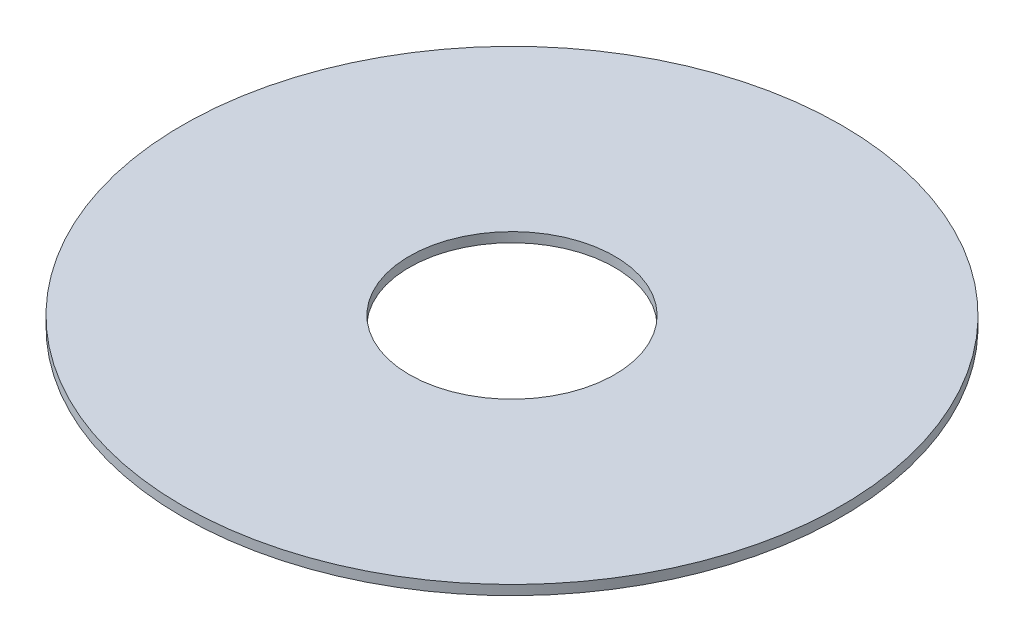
ISO-10303-21;
HEADER;
FILE_DESCRIPTION(('STEP AP214'),'2;1');
FILE_NAME('part.step','',(''),(''),'','','');
FILE_SCHEMA(('AUTOMOTIVE_DESIGN { 1 0 10303 214 1 1 1 1 }'));
ENDSEC;
DATA;
#1=APPLICATION_CONTEXT('core data for automotive mechanical design processes');
#2=APPLICATION_PROTOCOL_DEFINITION('international standard','automotive_design',2000,#1);
#3=PRODUCT_CONTEXT('',#1,'mechanical');
#4=PRODUCT('Part','Part','',(#3));
#5=PRODUCT_RELATED_PRODUCT_CATEGORY('part','',(#4));
#6=PRODUCT_DEFINITION_FORMATION('','',#4);
#7=PRODUCT_DEFINITION_CONTEXT('part definition',#1,'design');
#8=PRODUCT_DEFINITION('design','',#6,#7);
#9=PRODUCT_DEFINITION_SHAPE('','',#8);
#10=(LENGTH_UNIT() NAMED_UNIT(*) SI_UNIT(.MILLI.,.METRE.));
#11=(NAMED_UNIT(*) PLANE_ANGLE_UNIT() SI_UNIT($,.RADIAN.));
#12=(NAMED_UNIT(*) SI_UNIT($,.STERADIAN.) SOLID_ANGLE_UNIT());
#13=UNCERTAINTY_MEASURE_WITH_UNIT(LENGTH_MEASURE(1.E-05),#10,'distance_accuracy_value','');
#14=(GEOMETRIC_REPRESENTATION_CONTEXT(3) GLOBAL_UNCERTAINTY_ASSIGNED_CONTEXT((#13)) GLOBAL_UNIT_ASSIGNED_CONTEXT((#10,
#11,#12)) REPRESENTATION_CONTEXT('',''));
#15=CARTESIAN_POINT('',(0.,0.,0.));
#16=DIRECTION('',(0.,0.,1.));
#17=DIRECTION('',(1.,0.,0.));
#18=AXIS2_PLACEMENT_3D('',#15,#16,#17);
#19=CARTESIAN_POINT('',(0.,-6.8,0.));
#20=DIRECTION('',(0.,-1.,0.));
#21=DIRECTION('',(0.,0.,-1.));
#22=AXIS2_PLACEMENT_3D('',#19,#20,#21);
#23=PLANE('',#22);
#24=DIRECTION('',(0.53944994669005,0.,0.842017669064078));
#25=VECTOR('',#24,1.);
#26=CARTESIAN_POINT('',(7.384969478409,-6.8,28.71143611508));
#27=LINE('',#26,#25);
#28=CARTESIAN_POINT('',(7.384969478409,-6.8,28.71143611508));
#29=VERTEX_POINT('',#28);
#30=CARTESIAN_POINT('',(9.15528068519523,-6.8,31.4746828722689));
#31=VERTEX_POINT('',#30);
#32=EDGE_CURVE('E605',#29,#31,#27,.T.);
#33=ORIENTED_EDGE('',*,*,#32,.F.);
#34=DIRECTION('',(-0.980357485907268,0.,0.197228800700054));
#35=VECTOR('',#34,1.);
#36=CARTESIAN_POINT('',(9.719292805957,-6.8,28.241815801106));
#37=LINE('',#36,#35);
#38=CARTESIAN_POINT('',(9.71929280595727,-6.8,28.241815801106));
#39=VERTEX_POINT('',#38);
#40=EDGE_CURVE('E607',#39,#29,#37,.T.);
#41=ORIENTED_EDGE('',*,*,#40,.F.);
#42=DIRECTION('',(0.171865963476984,0.,-0.985120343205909));
#43=VECTOR('',#42,1.);
#44=CARTESIAN_POINT('',(9.155280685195,-6.8,31.474682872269));
#45=LINE('',#44,#43);
#46=EDGE_CURVE('E602',#31,#39,#45,.T.);
#47=ORIENTED_EDGE('',*,*,#46,.F.);
#48=EDGE_LOOP('',(#33,#41,#47));
#49=FACE_BOUND('',#48,.T.);
#50=ADVANCED_FACE('F17',(#49),#23,.T.);
#51=CARTESIAN_POINT('',(0.,-6.8,0.));
#52=DIRECTION('',(0.,-1.,0.));
#53=DIRECTION('',(0.,0.,-1.));
#54=AXIS2_PLACEMENT_3D('',#51,#52,#53);
#55=PLANE('',#54);
#56=DIRECTION('',(-0.299315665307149,0.,0.954154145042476));
#57=VECTOR('',#56,1.);
#58=CARTESIAN_POINT('',(-17.51666415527,-6.8,26.119670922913));
#59=LINE('',#58,#57);
#60=CARTESIAN_POINT('',(-17.5166641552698,-6.8,26.1196709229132));
#61=VERTEX_POINT('',#60);
#62=CARTESIAN_POINT('',(-17.7691947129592,-6.8,26.9246841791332));
#63=VERTEX_POINT('',#62);
#64=EDGE_CURVE('E1322',#61,#63,#59,.T.);
#65=ORIENTED_EDGE('',*,*,#64,.F.);
#66=DIRECTION('',(-0.587644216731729,0.,0.809119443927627));
#67=VECTOR('',#66,1.);
#68=CARTESIAN_POINT('',(-16.72018646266,-6.8,25.023011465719));
#69=LINE('',#68,#67);
#70=CARTESIAN_POINT('',(-16.7201864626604,-6.8,25.0230114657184));
#71=VERTEX_POINT('',#70);
#72=EDGE_CURVE('E1328',#71,#61,#69,.T.);
#73=ORIENTED_EDGE('',*,*,#72,.F.);
#74=DIRECTION('',(-0.814758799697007,0.,0.579800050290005));
#75=VECTOR('',#74,1.);
#76=CARTESIAN_POINT('',(-16.03278009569,-6.8,24.533838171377));
#77=LINE('',#76,#75);
#78=CARTESIAN_POINT('',(-16.03278009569,-6.8,24.5338381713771));
#79=VERTEX_POINT('',#78);
#80=EDGE_CURVE('E1331',#79,#71,#77,.T.);
#81=ORIENTED_EDGE('',*,*,#80,.F.);
#82=DIRECTION('',(-0.937505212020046,0.,0.347971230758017));
#83=VECTOR('',#82,1.);
#84=CARTESIAN_POINT('',(-15.13113652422,-6.8,24.199177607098));
#85=LINE('',#84,#83);
#86=CARTESIAN_POINT('',(-15.1311365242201,-6.8,24.1991776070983));
#87=VERTEX_POINT('',#86);
#88=EDGE_CURVE('E1244',#87,#79,#85,.T.);
#89=ORIENTED_EDGE('',*,*,#88,.F.);
#90=DIRECTION('',(-0.954480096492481,0.,-0.298274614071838));
#91=VECTOR('',#90,1.);
#92=CARTESIAN_POINT('',(-14.33139278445,-6.8,24.449097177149));
#93=LINE('',#92,#91);
#94=CARTESIAN_POINT('',(-14.3313927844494,-6.8,24.4490971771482));
#95=VERTEX_POINT('',#94);
#96=EDGE_CURVE('E1250',#95,#87,#93,.T.);
#97=ORIENTED_EDGE('',*,*,#96,.F.);
#98=DIRECTION('',(-0.809119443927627,0.,-0.587644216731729));
#99=VECTOR('',#98,1.);
#100=CARTESIAN_POINT('',(-13.84757657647,-6.8,24.80048138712));
#101=LINE('',#100,#99);
#102=CARTESIAN_POINT('',(-13.8475765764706,-6.8,24.8004813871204));
#103=VERTEX_POINT('',#102);
#104=EDGE_CURVE('E1256',#103,#95,#101,.T.);
#105=ORIENTED_EDGE('',*,*,#104,.F.);
#106=DIRECTION('',(-0.556865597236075,0.,-0.830602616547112));
#107=VECTOR('',#106,1.);
#108=CARTESIAN_POINT('',(-13.41517218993,-6.8,25.445441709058));
#109=LINE('',#108,#107);
#110=CARTESIAN_POINT('',(-13.4151721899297,-6.8,25.445441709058));
#111=VERTEX_POINT('',#110);
#112=EDGE_CURVE('E1262',#111,#103,#109,.T.);
#113=ORIENTED_EDGE('',*,*,#112,.F.);
#114=DIRECTION('',(0.0375833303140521,0.,-0.999293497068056));
#115=VECTOR('',#114,1.);
#116=CARTESIAN_POINT('',(-13.45139778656,-6.8,26.408634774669));
#117=LINE('',#116,#115);
#118=CARTESIAN_POINT('',(-13.4513977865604,-6.8,26.4086347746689));
#119=VERTEX_POINT('',#118);
#120=EDGE_CURVE('E1268',#119,#111,#117,.T.);
#121=ORIENTED_EDGE('',*,*,#120,.F.);
#122=DIRECTION('',(0.303422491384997,0.,-0.952856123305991));
#123=VECTOR('',#122,1.);
#124=CARTESIAN_POINT('',(-13.70702565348,-6.8,27.211398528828));
#125=LINE('',#124,#123);
#126=CARTESIAN_POINT('',(-13.7070256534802,-6.8,27.2113985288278));
#127=VERTEX_POINT('',#126);
#128=EDGE_CURVE('E1274',#127,#119,#125,.T.);
#129=ORIENTED_EDGE('',*,*,#128,.F.);
#130=DIRECTION('',(0.587644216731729,0.,-0.809119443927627));
#131=VECTOR('',#130,1.);
#132=CARTESIAN_POINT('',(-14.50350334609,-6.8,28.308057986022));
#133=LINE('',#132,#131);
#134=CARTESIAN_POINT('',(-14.5035033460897,-6.8,28.3080579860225));
#135=VERTEX_POINT('',#134);
#136=EDGE_CURVE('E1280',#135,#127,#133,.T.);
#137=ORIENTED_EDGE('',*,*,#136,.F.);
#138=DIRECTION('',(0.812254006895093,0.,-0.583303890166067));
#139=VECTOR('',#138,1.);
#140=CARTESIAN_POINT('',(-15.18781240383,-6.8,28.799480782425));
#141=LINE('',#140,#139);
#142=CARTESIAN_POINT('',(-15.1878124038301,-6.8,28.7994807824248));
#143=VERTEX_POINT('',#142);
#144=EDGE_CURVE('E1286',#143,#135,#141,.T.);
#145=ORIENTED_EDGE('',*,*,#144,.F.);
#146=DIRECTION('',(0.938650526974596,0.,-0.344869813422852));
#147=VECTOR('',#146,1.);
#148=CARTESIAN_POINT('',(-16.09255328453,-6.8,29.131891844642));
#149=LINE('',#148,#147);
#150=CARTESIAN_POINT('',(-16.09255328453,-6.8,29.1318918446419));
#151=VERTEX_POINT('',#150);
#152=EDGE_CURVE('E1292',#151,#143,#149,.T.);
#153=ORIENTED_EDGE('',*,*,#152,.F.);
#154=DIRECTION('',(0.954480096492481,0.,0.298274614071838));
#155=VECTOR('',#154,1.);
#156=CARTESIAN_POINT('',(-16.8922970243,-6.8,28.881972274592));
#157=LINE('',#156,#155);
#158=CARTESIAN_POINT('',(-16.8922970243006,-6.8,28.8819722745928));
#159=VERTEX_POINT('',#158);
#160=EDGE_CURVE('E1298',#159,#151,#157,.T.);
#161=ORIENTED_EDGE('',*,*,#160,.F.);
#162=DIRECTION('',(0.809119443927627,0.,0.587644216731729));
#163=VECTOR('',#162,1.);
#164=CARTESIAN_POINT('',(-17.32345735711,-6.8,28.568830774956));
#165=LINE('',#164,#163);
#166=CARTESIAN_POINT('',(-17.3234573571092,-6.8,28.5688307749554));
#167=VERTEX_POINT('',#166);
#168=EDGE_CURVE('E1304',#167,#159,#165,.T.);
#169=ORIENTED_EDGE('',*,*,#168,.F.);
#170=DIRECTION('',(0.578910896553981,0.,0.815390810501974));
#171=VECTOR('',#170,1.);
#172=CARTESIAN_POINT('',(-17.80851761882,-6.8,27.885627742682));
#173=LINE('',#172,#171);
#174=CARTESIAN_POINT('',(-17.8085176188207,-6.8,27.885627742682));
#175=VERTEX_POINT('',#174);
#176=EDGE_CURVE('E1310',#175,#167,#173,.T.);
#177=ORIENTED_EDGE('',*,*,#176,.F.);
#178=DIRECTION('',(-0.0408869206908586,0.,0.999163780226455));
#179=VECTOR('',#178,1.);
#180=CARTESIAN_POINT('',(-17.76919471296,-6.8,26.924684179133));
#181=LINE('',#180,#179);
#182=EDGE_CURVE('E1316',#63,#175,#181,.T.);
#183=ORIENTED_EDGE('',*,*,#182,.F.);
#184=EDGE_LOOP('',(#65,#73,#81,#89,#97,#105,#113,#121,#129,#137,#145,#153,#161,#169,#177,#183));
#185=FACE_BOUND('',#184,.T.);
#186=ADVANCED_FACE('F1346',(#185),#55,.T.);
#187=CARTESIAN_POINT('',(9.155280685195,-6.78,31.474682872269));
#188=DIRECTION('',(0.985120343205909,0.,0.171865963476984));
#189=DIRECTION('',(0.171865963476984,0.,-0.985120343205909));
#190=AXIS2_PLACEMENT_3D('',#187,#188,#189);
#191=PLANE('',#190);
#192=DIRECTION('',(0.171865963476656,0.,-0.985120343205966));
#193=VECTOR('',#192,1.);
#194=CARTESIAN_POINT('',(9.155280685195,-6.78,31.474682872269));
#195=LINE('',#194,#193);
#196=CARTESIAN_POINT('',(9.15528068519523,-6.78,31.4746828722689));
#197=VERTEX_POINT('',#196);
#198=CARTESIAN_POINT('',(9.71929280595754,-6.78,28.2418158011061));
#199=VERTEX_POINT('',#198);
#200=EDGE_CURVE('E615',#197,#199,#195,.T.);
#201=ORIENTED_EDGE('',*,*,#200,.F.);
#202=DIRECTION('',(0.,1.,0.));
#203=VECTOR('',#202,1.);
#204=CARTESIAN_POINT('',(9.15528068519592,-6.78,31.4746828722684));
#205=LINE('',#204,#203);
#206=EDGE_CURVE('E612',#31,#197,#205,.T.);
#207=ORIENTED_EDGE('',*,*,#206,.F.);
#208=ORIENTED_EDGE('',*,*,#46,.T.);
#209=DIRECTION('',(0.,1.,0.));
#210=VECTOR('',#209,1.);
#211=CARTESIAN_POINT('',(9.719292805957,-6.78,28.241815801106));
#212=LINE('',#211,#210);
#213=EDGE_CURVE('E623',#199,#39,#212,.F.);
#214=ORIENTED_EDGE('',*,*,#213,.F.);
#215=EDGE_LOOP('',(#201,#207,#208,#214));
#216=FACE_BOUND('',#215,.T.);
#217=ADVANCED_FACE('F613',(#216),#191,.T.);
#218=CARTESIAN_POINT('',(9.719292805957,-6.78,28.241815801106));
#219=DIRECTION('',(-0.197228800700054,0.,-0.980357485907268));
#220=DIRECTION('',(-0.980357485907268,0.,0.197228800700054));
#221=AXIS2_PLACEMENT_3D('',#218,#219,#220);
#222=PLANE('',#221);
#223=DIRECTION('',(-0.980357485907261,0.,0.197228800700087));
#224=VECTOR('',#223,1.);
#225=CARTESIAN_POINT('',(9.719292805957,-6.78,28.241815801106));
#226=LINE('',#225,#224);
#227=CARTESIAN_POINT('',(7.38496947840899,-6.78,28.71143611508));
#228=VERTEX_POINT('',#227);
#229=EDGE_CURVE('E1232',#199,#228,#226,.T.);
#230=ORIENTED_EDGE('',*,*,#229,.F.);
#231=ORIENTED_EDGE('',*,*,#213,.T.);
#232=ORIENTED_EDGE('',*,*,#40,.T.);
#233=DIRECTION('',(0.,1.,0.));
#234=VECTOR('',#233,1.);
#235=CARTESIAN_POINT('',(7.384969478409,-6.78,28.71143611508));
#236=LINE('',#235,#234);
#237=EDGE_CURVE('E619',#228,#29,#236,.F.);
#238=ORIENTED_EDGE('',*,*,#237,.F.);
#239=EDGE_LOOP('',(#230,#231,#232,#238));
#240=FACE_BOUND('',#239,.T.);
#241=ADVANCED_FACE('F2394',(#240),#222,.T.);
#242=CARTESIAN_POINT('',(7.384969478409,-6.78,28.71143611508));
#243=DIRECTION('',(-0.842017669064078,0.,0.53944994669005));
#244=DIRECTION('',(0.53944994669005,0.,0.842017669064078));
#245=AXIS2_PLACEMENT_3D('',#242,#243,#244);
#246=PLANE('',#245);
#247=DIRECTION('',(0.539449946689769,0.,0.842017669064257));
#248=VECTOR('',#247,1.);
#249=CARTESIAN_POINT('',(7.384969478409,-6.78,28.71143611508));
#250=LINE('',#249,#248);
#251=EDGE_CURVE('E1230',#228,#197,#250,.T.);
#252=ORIENTED_EDGE('',*,*,#251,.F.);
#253=ORIENTED_EDGE('',*,*,#237,.T.);
#254=ORIENTED_EDGE('',*,*,#32,.T.);
#255=ORIENTED_EDGE('',*,*,#206,.T.);
#256=EDGE_LOOP('',(#252,#253,#254,#255));
#257=FACE_BOUND('',#256,.T.);
#258=ADVANCED_FACE('F622',(#257),#246,.T.);
#259=CARTESIAN_POINT('',(-16.03278009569,-6.78,24.533838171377));
#260=DIRECTION('',(-0.579800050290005,0.,-0.814758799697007));
#261=DIRECTION('',(-0.814758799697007,0.,0.579800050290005));
#262=AXIS2_PLACEMENT_3D('',#259,#260,#261);
#263=PLANE('',#262);
#264=DIRECTION('',(-0.814758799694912,0.,0.579800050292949));
#265=VECTOR('',#264,1.);
#266=CARTESIAN_POINT('',(-16.03278009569,-6.78,24.533838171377));
#267=LINE('',#266,#265);
#268=CARTESIAN_POINT('',(-16.03278009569,-6.78,24.5338381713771));
#269=VERTEX_POINT('',#268);
#270=CARTESIAN_POINT('',(-16.7201864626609,-6.78,25.0230114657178));
#271=VERTEX_POINT('',#270);
#272=EDGE_CURVE('E1222',#269,#271,#267,.T.);
#273=ORIENTED_EDGE('',*,*,#272,.F.);
#274=DIRECTION('',(0.,1.,0.));
#275=VECTOR('',#274,1.);
#276=CARTESIAN_POINT('',(-16.0327800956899,-6.78,24.5338381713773));
#277=LINE('',#276,#275);
#278=EDGE_CURVE('E1241',#79,#269,#277,.T.);
#279=ORIENTED_EDGE('',*,*,#278,.F.);
#280=ORIENTED_EDGE('',*,*,#80,.T.);
#281=DIRECTION('',(0.,1.,0.));
#282=VECTOR('',#281,1.);
#283=CARTESIAN_POINT('',(-16.72018646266,-6.78,25.023011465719));
#284=LINE('',#283,#282);
#285=EDGE_CURVE('E1325',#271,#71,#284,.F.);
#286=ORIENTED_EDGE('',*,*,#285,.F.);
#287=EDGE_LOOP('',(#273,#279,#280,#286));
#288=FACE_BOUND('',#287,.T.);
#289=ADVANCED_FACE('F1335',(#288),#263,.T.);
#290=CARTESIAN_POINT('',(-16.72018646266,-6.78,25.023011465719));
#291=DIRECTION('',(-0.809119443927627,0.,-0.587644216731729));
#292=DIRECTION('',(-0.587644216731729,0.,0.809119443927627));
#293=AXIS2_PLACEMENT_3D('',#290,#291,#292);
#294=PLANE('',#293);
#295=DIRECTION('',(-0.587644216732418,0.,0.809119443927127));
#296=VECTOR('',#295,1.);
#297=CARTESIAN_POINT('',(-16.72018646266,-6.78,25.023011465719));
#298=LINE('',#297,#296);
#299=CARTESIAN_POINT('',(-17.5166641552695,-6.78,26.1196709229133));
#300=VERTEX_POINT('',#299);
#301=EDGE_CURVE('E1219',#271,#300,#298,.T.);
#302=ORIENTED_EDGE('',*,*,#301,.F.);
#303=ORIENTED_EDGE('',*,*,#285,.T.);
#304=ORIENTED_EDGE('',*,*,#72,.T.);
#305=DIRECTION('',(0.,1.,0.));
#306=VECTOR('',#305,1.);
#307=CARTESIAN_POINT('',(-17.51666415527,-6.78,26.119670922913));
#308=LINE('',#307,#306);
#309=EDGE_CURVE('E1319',#300,#61,#308,.F.);
#310=ORIENTED_EDGE('',*,*,#309,.F.);
#311=EDGE_LOOP('',(#302,#303,#304,#310));
#312=FACE_BOUND('',#311,.T.);
#313=ADVANCED_FACE('F1339',(#312),#294,.T.);
#314=CARTESIAN_POINT('',(-17.51666415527,-6.78,26.119670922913));
#315=DIRECTION('',(-0.954154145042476,0.,-0.299315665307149));
#316=DIRECTION('',(-0.299315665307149,0.,0.954154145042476));
#317=AXIS2_PLACEMENT_3D('',#314,#315,#316);
#318=PLANE('',#317);
#319=DIRECTION('',(-0.299315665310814,0.,0.954154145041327));
#320=VECTOR('',#319,1.);
#321=CARTESIAN_POINT('',(-17.51666415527,-6.78,26.119670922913));
#322=LINE('',#321,#320);
#323=CARTESIAN_POINT('',(-17.7691947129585,-6.78,26.9246841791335));
#324=VERTEX_POINT('',#323);
#325=EDGE_CURVE('E1216',#300,#324,#322,.T.);
#326=ORIENTED_EDGE('',*,*,#325,.F.);
#327=ORIENTED_EDGE('',*,*,#309,.T.);
#328=ORIENTED_EDGE('',*,*,#64,.T.);
#329=DIRECTION('',(0.,1.,0.));
#330=VECTOR('',#329,1.);
#331=CARTESIAN_POINT('',(-17.76919471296,-6.78,26.924684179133));
#332=LINE('',#331,#330);
#333=EDGE_CURVE('E1313',#324,#63,#332,.F.);
#334=ORIENTED_EDGE('',*,*,#333,.F.);
#335=EDGE_LOOP('',(#326,#327,#328,#334));
#336=FACE_BOUND('',#335,.T.);
#337=ADVANCED_FACE('F1384',(#336),#318,.T.);
#338=CARTESIAN_POINT('',(-17.76919471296,-6.78,26.924684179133));
#339=DIRECTION('',(-0.999163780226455,0.,-0.0408869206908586));
#340=DIRECTION('',(-0.0408869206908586,0.,0.999163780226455));
#341=AXIS2_PLACEMENT_3D('',#338,#339,#340);
#342=PLANE('',#341);
#343=DIRECTION('',(-0.0408869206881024,0.,0.999163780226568));
#344=VECTOR('',#343,1.);
#345=CARTESIAN_POINT('',(-17.76919471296,-6.78,26.924684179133));
#346=LINE('',#345,#344);
#347=CARTESIAN_POINT('',(-17.8085176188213,-6.78,27.8856277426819));
#348=VERTEX_POINT('',#347);
#349=EDGE_CURVE('E1213',#324,#348,#346,.T.);
#350=ORIENTED_EDGE('',*,*,#349,.F.);
#351=ORIENTED_EDGE('',*,*,#333,.T.);
#352=ORIENTED_EDGE('',*,*,#182,.T.);
#353=DIRECTION('',(0.,1.,0.));
#354=VECTOR('',#353,1.);
#355=CARTESIAN_POINT('',(-17.80851761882,-6.78,27.885627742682));
#356=LINE('',#355,#354);
#357=EDGE_CURVE('E1307',#348,#175,#356,.F.);
#358=ORIENTED_EDGE('',*,*,#357,.F.);
#359=EDGE_LOOP('',(#350,#351,#352,#358));
#360=FACE_BOUND('',#359,.T.);
#361=ADVANCED_FACE('F1382',(#360),#342,.T.);
#362=CARTESIAN_POINT('',(-17.80851761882,-6.78,27.885627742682));
#363=DIRECTION('',(-0.815390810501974,0.,0.578910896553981));
#364=DIRECTION('',(0.578910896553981,0.,0.815390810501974));
#365=AXIS2_PLACEMENT_3D('',#362,#363,#364);
#366=PLANE('',#365);
#367=DIRECTION('',(0.578910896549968,0.,0.815390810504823));
#368=VECTOR('',#367,1.);
#369=CARTESIAN_POINT('',(-17.80851761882,-6.78,27.885627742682));
#370=LINE('',#369,#368);
#371=CARTESIAN_POINT('',(-17.3234573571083,-6.78,28.5688307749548));
#372=VERTEX_POINT('',#371);
#373=EDGE_CURVE('E1210',#348,#372,#370,.T.);
#374=ORIENTED_EDGE('',*,*,#373,.F.);
#375=ORIENTED_EDGE('',*,*,#357,.T.);
#376=ORIENTED_EDGE('',*,*,#176,.T.);
#377=DIRECTION('',(0.,1.,0.));
#378=VECTOR('',#377,1.);
#379=CARTESIAN_POINT('',(-17.32345735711,-6.78,28.568830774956));
#380=LINE('',#379,#378);
#381=EDGE_CURVE('E1301',#372,#167,#380,.F.);
#382=ORIENTED_EDGE('',*,*,#381,.F.);
#383=EDGE_LOOP('',(#374,#375,#376,#382));
#384=FACE_BOUND('',#383,.T.);
#385=ADVANCED_FACE('F1379',(#384),#366,.T.);
#386=CARTESIAN_POINT('',(-17.32345735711,-6.78,28.568830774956));
#387=DIRECTION('',(-0.587644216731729,0.,0.809119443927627));
#388=DIRECTION('',(0.809119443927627,0.,0.587644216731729));
#389=AXIS2_PLACEMENT_3D('',#386,#387,#388);
#390=PLANE('',#389);
#391=DIRECTION('',(0.809119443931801,0.,0.587644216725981));
#392=VECTOR('',#391,1.);
#393=CARTESIAN_POINT('',(-17.32345735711,-6.78,28.568830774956));
#394=LINE('',#393,#392);
#395=CARTESIAN_POINT('',(-16.8922970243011,-6.78,28.8819722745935));
#396=VERTEX_POINT('',#395);
#397=EDGE_CURVE('E1207',#372,#396,#394,.T.);
#398=ORIENTED_EDGE('',*,*,#397,.F.);
#399=ORIENTED_EDGE('',*,*,#381,.T.);
#400=ORIENTED_EDGE('',*,*,#168,.T.);
#401=DIRECTION('',(0.,1.,0.));
#402=VECTOR('',#401,1.);
#403=CARTESIAN_POINT('',(-16.8922970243,-6.78,28.881972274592));
#404=LINE('',#403,#402);
#405=EDGE_CURVE('E1295',#396,#159,#404,.F.);
#406=ORIENTED_EDGE('',*,*,#405,.F.);
#407=EDGE_LOOP('',(#398,#399,#400,#406));
#408=FACE_BOUND('',#407,.T.);
#409=ADVANCED_FACE('F1376',(#408),#390,.T.);
#410=CARTESIAN_POINT('',(-16.8922970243,-6.78,28.881972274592));
#411=DIRECTION('',(-0.298274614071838,0.,0.954480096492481));
#412=DIRECTION('',(0.954480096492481,0.,0.298274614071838));
#413=AXIS2_PLACEMENT_3D('',#410,#411,#412);
#414=PLANE('',#413);
#415=DIRECTION('',(0.954480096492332,0.,0.298274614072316));
#416=VECTOR('',#415,1.);
#417=CARTESIAN_POINT('',(-16.8922970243,-6.78,28.881972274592));
#418=LINE('',#417,#416);
#419=CARTESIAN_POINT('',(-16.0925532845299,-6.78,29.1318918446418));
#420=VERTEX_POINT('',#419);
#421=EDGE_CURVE('E1204',#396,#420,#418,.T.);
#422=ORIENTED_EDGE('',*,*,#421,.F.);
#423=ORIENTED_EDGE('',*,*,#405,.T.);
#424=ORIENTED_EDGE('',*,*,#160,.T.);
#425=DIRECTION('',(0.,1.,0.));
#426=VECTOR('',#425,1.);
#427=CARTESIAN_POINT('',(-16.09255328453,-6.78,29.131891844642));
#428=LINE('',#427,#426);
#429=EDGE_CURVE('E1289',#420,#151,#428,.F.);
#430=ORIENTED_EDGE('',*,*,#429,.F.);
#431=EDGE_LOOP('',(#422,#423,#424,#430));
#432=FACE_BOUND('',#431,.T.);
#433=ADVANCED_FACE('F1373',(#432),#414,.T.);
#434=CARTESIAN_POINT('',(-16.09255328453,-6.78,29.131891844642));
#435=DIRECTION('',(0.344869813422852,0.,0.938650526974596));
#436=DIRECTION('',(0.938650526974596,0.,-0.344869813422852));
#437=AXIS2_PLACEMENT_3D('',#434,#435,#436);
#438=PLANE('',#437);
#439=DIRECTION('',(0.938650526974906,0.,-0.344869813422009));
#440=VECTOR('',#439,1.);
#441=CARTESIAN_POINT('',(-16.09255328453,-6.78,29.131891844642));
#442=LINE('',#441,#440);
#443=CARTESIAN_POINT('',(-15.1878124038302,-6.78,28.7994807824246));
#444=VERTEX_POINT('',#443);
#445=EDGE_CURVE('E1201',#420,#444,#442,.T.);
#446=ORIENTED_EDGE('',*,*,#445,.F.);
#447=ORIENTED_EDGE('',*,*,#429,.T.);
#448=ORIENTED_EDGE('',*,*,#152,.T.);
#449=DIRECTION('',(0.,1.,0.));
#450=VECTOR('',#449,1.);
#451=CARTESIAN_POINT('',(-15.18781240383,-6.78,28.799480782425));
#452=LINE('',#451,#450);
#453=EDGE_CURVE('E1283',#444,#143,#452,.F.);
#454=ORIENTED_EDGE('',*,*,#453,.F.);
#455=EDGE_LOOP('',(#446,#447,#448,#454));
#456=FACE_BOUND('',#455,.T.);
#457=ADVANCED_FACE('F1370',(#456),#438,.T.);
#458=CARTESIAN_POINT('',(-15.18781240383,-6.78,28.799480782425));
#459=DIRECTION('',(0.583303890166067,0.,0.812254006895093));
#460=DIRECTION('',(0.812254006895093,0.,-0.583303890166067));
#461=AXIS2_PLACEMENT_3D('',#458,#459,#460);
#462=PLANE('',#461);
#463=DIRECTION('',(0.812254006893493,0.,-0.583303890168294));
#464=VECTOR('',#463,1.);
#465=CARTESIAN_POINT('',(-15.18781240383,-6.78,28.799480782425));
#466=LINE('',#465,#464);
#467=CARTESIAN_POINT('',(-14.5035033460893,-6.78,28.3080579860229));
#468=VERTEX_POINT('',#467);
#469=EDGE_CURVE('E1198',#444,#468,#466,.T.);
#470=ORIENTED_EDGE('',*,*,#469,.F.);
#471=ORIENTED_EDGE('',*,*,#453,.T.);
#472=ORIENTED_EDGE('',*,*,#144,.T.);
#473=DIRECTION('',(0.,1.,0.));
#474=VECTOR('',#473,1.);
#475=CARTESIAN_POINT('',(-14.50350334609,-6.78,28.308057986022));
#476=LINE('',#475,#474);
#477=EDGE_CURVE('E1277',#468,#135,#476,.F.);
#478=ORIENTED_EDGE('',*,*,#477,.F.);
#479=EDGE_LOOP('',(#470,#471,#472,#478));
#480=FACE_BOUND('',#479,.T.);
#481=ADVANCED_FACE('F1367',(#480),#462,.T.);
#482=CARTESIAN_POINT('',(-14.50350334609,-6.78,28.308057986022));
#483=DIRECTION('',(0.809119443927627,0.,0.587644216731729));
#484=DIRECTION('',(0.587644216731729,0.,-0.809119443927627));
#485=AXIS2_PLACEMENT_3D('',#482,#483,#484);
#486=PLANE('',#485);
#487=DIRECTION('',(0.587644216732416,0.,-0.809119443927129));
#488=VECTOR('',#487,1.);
#489=CARTESIAN_POINT('',(-14.50350334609,-6.78,28.308057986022));
#490=LINE('',#489,#488);
#491=CARTESIAN_POINT('',(-13.7070256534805,-6.78,27.2113985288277));
#492=VERTEX_POINT('',#491);
#493=EDGE_CURVE('E1195',#468,#492,#490,.T.);
#494=ORIENTED_EDGE('',*,*,#493,.F.);
#495=ORIENTED_EDGE('',*,*,#477,.T.);
#496=ORIENTED_EDGE('',*,*,#136,.T.);
#497=DIRECTION('',(0.,1.,0.));
#498=VECTOR('',#497,1.);
#499=CARTESIAN_POINT('',(-13.70702565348,-6.78,27.211398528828));
#500=LINE('',#499,#498);
#501=EDGE_CURVE('E1271',#492,#127,#500,.F.);
#502=ORIENTED_EDGE('',*,*,#501,.F.);
#503=EDGE_LOOP('',(#494,#495,#496,#502));
#504=FACE_BOUND('',#503,.T.);
#505=ADVANCED_FACE('F1364',(#504),#486,.T.);
#506=CARTESIAN_POINT('',(-13.70702565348,-6.78,27.211398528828));
#507=DIRECTION('',(0.952856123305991,0.,0.303422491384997));
#508=DIRECTION('',(0.303422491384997,0.,-0.952856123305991));
#509=AXIS2_PLACEMENT_3D('',#506,#507,#508);
#510=PLANE('',#509);
#511=DIRECTION('',(0.303422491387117,0.,-0.952856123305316));
#512=VECTOR('',#511,1.);
#513=CARTESIAN_POINT('',(-13.70702565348,-6.78,27.211398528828));
#514=LINE('',#513,#512);
#515=CARTESIAN_POINT('',(-13.4513977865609,-6.78,26.4086347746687));
#516=VERTEX_POINT('',#515);
#517=EDGE_CURVE('E1192',#492,#516,#514,.T.);
#518=ORIENTED_EDGE('',*,*,#517,.F.);
#519=ORIENTED_EDGE('',*,*,#501,.T.);
#520=ORIENTED_EDGE('',*,*,#128,.T.);
#521=DIRECTION('',(0.,1.,0.));
#522=VECTOR('',#521,1.);
#523=CARTESIAN_POINT('',(-13.45139778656,-6.78,26.408634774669));
#524=LINE('',#523,#522);
#525=EDGE_CURVE('E1265',#516,#119,#524,.F.);
#526=ORIENTED_EDGE('',*,*,#525,.F.);
#527=EDGE_LOOP('',(#518,#519,#520,#526));
#528=FACE_BOUND('',#527,.T.);
#529=ADVANCED_FACE('F1361',(#528),#510,.T.);
#530=CARTESIAN_POINT('',(-13.45139778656,-6.78,26.408634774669));
#531=DIRECTION('',(0.999293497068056,0.,0.0375833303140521));
#532=DIRECTION('',(0.0375833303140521,0.,-0.999293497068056));
#533=AXIS2_PLACEMENT_3D('',#530,#531,#532);
#534=PLANE('',#533);
#535=DIRECTION('',(0.0375833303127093,0.,-0.999293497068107));
#536=VECTOR('',#535,1.);
#537=CARTESIAN_POINT('',(-13.45139778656,-6.78,26.408634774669));
#538=LINE('',#537,#536);
#539=CARTESIAN_POINT('',(-13.4151721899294,-6.78,25.445441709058));
#540=VERTEX_POINT('',#539);
#541=EDGE_CURVE('E1189',#516,#540,#538,.T.);
#542=ORIENTED_EDGE('',*,*,#541,.F.);
#543=ORIENTED_EDGE('',*,*,#525,.T.);
#544=ORIENTED_EDGE('',*,*,#120,.T.);
#545=DIRECTION('',(0.,1.,0.));
#546=VECTOR('',#545,1.);
#547=CARTESIAN_POINT('',(-13.41517218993,-6.78,25.445441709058));
#548=LINE('',#547,#546);
#549=EDGE_CURVE('E1259',#540,#111,#548,.F.);
#550=ORIENTED_EDGE('',*,*,#549,.F.);
#551=EDGE_LOOP('',(#542,#543,#544,#550));
#552=FACE_BOUND('',#551,.T.);
#553=ADVANCED_FACE('F1358',(#552),#534,.T.);
#554=CARTESIAN_POINT('',(-13.41517218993,-6.78,25.445441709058));
#555=DIRECTION('',(0.830602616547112,0.,-0.556865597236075));
#556=DIRECTION('',(-0.556865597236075,0.,-0.830602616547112));
#557=AXIS2_PLACEMENT_3D('',#554,#555,#556);
#558=PLANE('',#557);
#559=DIRECTION('',(-0.556865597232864,0.,-0.830602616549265));
#560=VECTOR('',#559,1.);
#561=CARTESIAN_POINT('',(-13.41517218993,-6.78,25.445441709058));
#562=LINE('',#561,#560);
#563=CARTESIAN_POINT('',(-13.8475765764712,-6.78,24.8004813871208));
#564=VERTEX_POINT('',#563);
#565=EDGE_CURVE('E1186',#540,#564,#562,.T.);
#566=ORIENTED_EDGE('',*,*,#565,.F.);
#567=ORIENTED_EDGE('',*,*,#549,.T.);
#568=ORIENTED_EDGE('',*,*,#112,.T.);
#569=DIRECTION('',(0.,1.,0.));
#570=VECTOR('',#569,1.);
#571=CARTESIAN_POINT('',(-13.84757657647,-6.78,24.80048138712));
#572=LINE('',#571,#570);
#573=EDGE_CURVE('E1253',#564,#103,#572,.F.);
#574=ORIENTED_EDGE('',*,*,#573,.F.);
#575=EDGE_LOOP('',(#566,#567,#568,#574));
#576=FACE_BOUND('',#575,.T.);
#577=ADVANCED_FACE('F1355',(#576),#558,.T.);
#578=CARTESIAN_POINT('',(-13.84757657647,-6.78,24.80048138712));
#579=DIRECTION('',(0.587644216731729,0.,-0.809119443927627));
#580=DIRECTION('',(-0.809119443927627,0.,-0.587644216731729));
#581=AXIS2_PLACEMENT_3D('',#578,#579,#580);
#582=PLANE('',#581);
#583=DIRECTION('',(-0.809119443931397,0.,-0.587644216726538));
#584=VECTOR('',#583,1.);
#585=CARTESIAN_POINT('',(-13.84757657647,-6.78,24.80048138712));
#586=LINE('',#585,#584);
#587=CARTESIAN_POINT('',(-14.3313927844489,-6.78,24.4490971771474));
#588=VERTEX_POINT('',#587);
#589=EDGE_CURVE('E1183',#564,#588,#586,.T.);
#590=ORIENTED_EDGE('',*,*,#589,.F.);
#591=ORIENTED_EDGE('',*,*,#573,.T.);
#592=ORIENTED_EDGE('',*,*,#104,.T.);
#593=DIRECTION('',(0.,1.,0.));
#594=VECTOR('',#593,1.);
#595=CARTESIAN_POINT('',(-14.33139278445,-6.78,24.449097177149));
#596=LINE('',#595,#594);
#597=EDGE_CURVE('E1247',#588,#95,#596,.F.);
#598=ORIENTED_EDGE('',*,*,#597,.F.);
#599=EDGE_LOOP('',(#590,#591,#592,#598));
#600=FACE_BOUND('',#599,.T.);
#601=ADVANCED_FACE('F1352',(#600),#582,.T.);
#602=CARTESIAN_POINT('',(-14.33139278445,-6.78,24.449097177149));
#603=DIRECTION('',(0.298274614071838,0.,-0.954480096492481));
#604=DIRECTION('',(-0.954480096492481,0.,-0.298274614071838));
#605=AXIS2_PLACEMENT_3D('',#602,#603,#604);
#606=PLANE('',#605);
#607=DIRECTION('',(-0.954480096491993,0.,-0.298274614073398));
#608=VECTOR('',#607,1.);
#609=CARTESIAN_POINT('',(-14.33139278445,-6.78,24.449097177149));
#610=LINE('',#609,#608);
#611=CARTESIAN_POINT('',(-15.1311365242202,-6.78,24.1991776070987));
#612=VERTEX_POINT('',#611);
#613=EDGE_CURVE('E1180',#588,#612,#610,.T.);
#614=ORIENTED_EDGE('',*,*,#613,.F.);
#615=ORIENTED_EDGE('',*,*,#597,.T.);
#616=ORIENTED_EDGE('',*,*,#96,.T.);
#617=DIRECTION('',(0.,1.,0.));
#618=VECTOR('',#617,1.);
#619=CARTESIAN_POINT('',(-15.13113652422,-6.78,24.199177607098));
#620=LINE('',#619,#618);
#621=EDGE_CURVE('E1238',#612,#87,#620,.F.);
#622=ORIENTED_EDGE('',*,*,#621,.F.);
#623=EDGE_LOOP('',(#614,#615,#616,#622));
#624=FACE_BOUND('',#623,.T.);
#625=ADVANCED_FACE('F1349',(#624),#606,.T.);
#626=CARTESIAN_POINT('',(-15.13113652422,-6.78,24.199177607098));
#627=DIRECTION('',(-0.347971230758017,0.,-0.937505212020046));
#628=DIRECTION('',(-0.937505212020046,0.,0.347971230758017));
#629=AXIS2_PLACEMENT_3D('',#626,#627,#628);
#630=PLANE('',#629);
#631=DIRECTION('',(-0.93750521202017,0.,0.347971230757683));
#632=VECTOR('',#631,1.);
#633=CARTESIAN_POINT('',(-15.13113652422,-6.78,24.199177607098));
#634=LINE('',#633,#632);
#635=EDGE_CURVE('E1177',#612,#269,#634,.T.);
#636=ORIENTED_EDGE('',*,*,#635,.F.);
#637=ORIENTED_EDGE('',*,*,#621,.T.);
#638=ORIENTED_EDGE('',*,*,#88,.T.);
#639=ORIENTED_EDGE('',*,*,#278,.T.);
#640=EDGE_LOOP('',(#636,#637,#638,#639));
#641=FACE_BOUND('',#640,.T.);
#642=ADVANCED_FACE('F1345',(#641),#630,.T.);
#643=CARTESIAN_POINT('',(20.131699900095,-6.78,24.59506554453));
#644=DIRECTION('',(0.,-1.,0.));
#645=DIRECTION('',(0.,0.,-1.));
#646=AXIS2_PLACEMENT_3D('',#643,#644,#645);
#647=PLANE('',#646);
#648=DIRECTION('',(-0.818576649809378,0.,0.574397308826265));
#649=VECTOR('',#648,1.);
#650=CARTESIAN_POINT('',(20.892281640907,-6.78,26.02020184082));
#651=LINE('',#650,#649);
#652=CARTESIAN_POINT('',(19.5448275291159,-6.78,26.9657138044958));
#653=VERTEX_POINT('',#652);
#654=CARTESIAN_POINT('',(20.8922816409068,-6.78,26.0202018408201));
#655=VERTEX_POINT('',#654);
#656=EDGE_CURVE('E1166',#653,#655,#651,.F.);
#657=ORIENTED_EDGE('',*,*,#656,.T.);
#658=DIRECTION('',(0.574397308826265,0.,0.818576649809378));
#659=VECTOR('',#658,1.);
#660=CARTESIAN_POINT('',(17.739989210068,-6.78,21.527853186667));
#661=LINE('',#660,#659);
#662=CARTESIAN_POINT('',(17.739989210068,-6.78,21.5278531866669));
#663=VERTEX_POINT('',#662);
#664=EDGE_CURVE('E1168',#655,#663,#661,.F.);
#665=ORIENTED_EDGE('',*,*,#664,.T.);
#666=DIRECTION('',(0.818576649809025,0.,-0.574397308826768));
#667=VECTOR('',#666,1.);
#668=CARTESIAN_POINT('',(17.739989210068,-6.78,21.527853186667));
#669=LINE('',#668,#667);
#670=CARTESIAN_POINT('',(18.0608712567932,-6.78,21.3026894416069));
#671=VERTEX_POINT('',#670);
#672=EDGE_CURVE('E1236',#663,#671,#669,.T.);
#673=ORIENTED_EDGE('',*,*,#672,.T.);
#674=DIRECTION('',(-0.574397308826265,0.,-0.818576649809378));
#675=VECTOR('',#674,1.);
#676=CARTESIAN_POINT('',(21.213163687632,-6.78,25.79503809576));
#677=LINE('',#676,#675);
#678=CARTESIAN_POINT('',(21.213163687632,-6.78,25.79503809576));
#679=VERTEX_POINT('',#678);
#680=EDGE_CURVE('E1146',#671,#679,#677,.F.);
#681=ORIENTED_EDGE('',*,*,#680,.T.);
#682=DIRECTION('',(-0.818576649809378,0.,0.574397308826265));
#683=VECTOR('',#682,1.);
#684=CARTESIAN_POINT('',(22.560617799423,-6.78,24.849526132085));
#685=LINE('',#684,#683);
#686=CARTESIAN_POINT('',(22.5606177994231,-6.78,24.849526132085));
#687=VERTEX_POINT('',#686);
#688=EDGE_CURVE('E1150',#679,#687,#685,.F.);
#689=ORIENTED_EDGE('',*,*,#688,.T.);
#690=DIRECTION('',(-0.574397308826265,0.,-0.818576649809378));
#691=VECTOR('',#690,1.);
#692=CARTESIAN_POINT('',(22.785781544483,-6.78,25.17040817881));
#693=LINE('',#692,#691);
#694=CARTESIAN_POINT('',(22.7857815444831,-6.78,25.1704081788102));
#695=VERTEX_POINT('',#694);
#696=EDGE_CURVE('E1154',#687,#695,#693,.F.);
#697=ORIENTED_EDGE('',*,*,#696,.T.);
#698=DIRECTION('',(0.818576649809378,0.,-0.574397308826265));
#699=VECTOR('',#698,1.);
#700=CARTESIAN_POINT('',(19.769991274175,-6.78,27.286595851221));
#701=LINE('',#700,#699);
#702=CARTESIAN_POINT('',(19.7699912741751,-6.78,27.2865958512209));
#703=VERTEX_POINT('',#702);
#704=EDGE_CURVE('E1158',#695,#703,#701,.F.);
#705=ORIENTED_EDGE('',*,*,#704,.T.);
#706=DIRECTION('',(0.574397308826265,0.,0.818576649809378));
#707=VECTOR('',#706,1.);
#708=CARTESIAN_POINT('',(19.544827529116,-6.78,26.965713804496));
#709=LINE('',#708,#707);
#710=EDGE_CURVE('E1162',#703,#653,#709,.F.);
#711=ORIENTED_EDGE('',*,*,#710,.T.);
#712=EDGE_LOOP('',(#657,#665,#673,#681,#689,#697,#705,#711));
#713=FACE_BOUND('',#712,.T.);
#714=ADVANCED_FACE('F1742',(#713),#647,.T.);
#715=CARTESIAN_POINT('',(8.644685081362,-6.78,28.937237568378));
#716=DIRECTION('',(0.,-1.,0.));
#717=DIRECTION('',(0.,0.,-1.));
#718=AXIS2_PLACEMENT_3D('',#715,#716,#717);
#719=PLANE('',#718);
#720=DIRECTION('',(0.980357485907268,0.,-0.197228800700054));
#721=VECTOR('',#720,1.);
#722=CARTESIAN_POINT('',(9.317120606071,-6.78,32.492632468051));
#723=LINE('',#722,#721);
#724=CARTESIAN_POINT('',(9.39968435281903,-6.78,32.4760222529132));
#725=VERTEX_POINT('',#724);
#726=CARTESIAN_POINT('',(9.31712060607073,-6.78,32.4926324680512));
#727=VERTEX_POINT('',#726);
#728=EDGE_CURVE('E1134',#725,#727,#723,.F.);
#729=ORIENTED_EDGE('',*,*,#728,.T.);
#730=DIRECTION('',(0.534203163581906,0.,0.845356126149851));
#731=VECTOR('',#730,1.);
#732=CARTESIAN_POINT('',(5.954444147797,-6.78,27.171325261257));
#733=LINE('',#732,#731);
#734=CARTESIAN_POINT('',(5.95444414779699,-6.78,27.171325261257));
#735=VERTEX_POINT('',#734);
#736=EDGE_CURVE('E1136',#727,#735,#733,.F.);
#737=ORIENTED_EDGE('',*,*,#736,.T.);
#738=DIRECTION('',(0.9803574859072,0.,-0.197228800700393));
#739=VECTOR('',#738,1.);
#740=CARTESIAN_POINT('',(5.954444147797,-6.78,27.171325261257));
#741=LINE('',#740,#739);
#742=CARTESIAN_POINT('',(6.3560083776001,-6.78,27.0905383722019));
#743=VERTEX_POINT('',#742);
#744=EDGE_CURVE('E1227',#735,#743,#741,.T.);
#745=ORIENTED_EDGE('',*,*,#744,.T.);
#746=DIRECTION('',(0.536694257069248,0.,0.843776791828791));
#747=VECTOR('',#746,1.);
#748=CARTESIAN_POINT('',(6.3560083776,-6.78,27.090538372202));
#749=LINE('',#748,#747);
#750=CARTESIAN_POINT('',(7.16129037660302,-6.78,28.3565818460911));
#751=VERTEX_POINT('',#750);
#752=EDGE_CURVE('E1225',#743,#751,#749,.T.);
#753=ORIENTED_EDGE('',*,*,#752,.T.);
#754=DIRECTION('',(-0.980357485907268,0.,0.197228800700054));
#755=VECTOR('',#754,1.);
#756=CARTESIAN_POINT('',(9.788342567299,-6.78,27.828070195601));
#757=LINE('',#756,#755);
#758=CARTESIAN_POINT('',(9.78834256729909,-6.78,27.828070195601));
#759=VERTEX_POINT('',#758);
#760=EDGE_CURVE('E1118',#751,#759,#757,.F.);
#761=ORIENTED_EDGE('',*,*,#760,.T.);
#762=DIRECTION('',(-0.170988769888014,0.,0.985272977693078));
#763=VECTOR('',#762,1.);
#764=CARTESIAN_POINT('',(10.045138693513,-6.78,26.348357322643));
#765=LINE('',#764,#763);
#766=CARTESIAN_POINT('',(10.045138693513,-6.78,26.3483573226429));
#767=VERTEX_POINT('',#766);
#768=EDGE_CURVE('E1122',#759,#767,#765,.F.);
#769=ORIENTED_EDGE('',*,*,#768,.T.);
#770=DIRECTION('',(-0.980357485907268,0.,0.197228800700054));
#771=VECTOR('',#770,1.);
#772=CARTESIAN_POINT('',(10.442950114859,-6.78,26.268325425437));
#773=LINE('',#772,#771);
#774=CARTESIAN_POINT('',(10.4429501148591,-6.78,26.268325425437));
#775=VERTEX_POINT('',#774);
#776=EDGE_CURVE('E1126',#767,#775,#773,.F.);
#777=ORIENTED_EDGE('',*,*,#776,.T.);
#778=DIRECTION('',(0.165735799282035,0.,-0.986170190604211));
#779=VECTOR('',#778,1.);
#780=CARTESIAN_POINT('',(9.399684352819,-6.78,32.476022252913));
#781=LINE('',#780,#779);
#782=EDGE_CURVE('E1130',#775,#725,#781,.F.);
#783=ORIENTED_EDGE('',*,*,#782,.T.);
#784=EDGE_LOOP('',(#729,#737,#745,#753,#761,#769,#777,#783));
#785=FACE_BOUND('',#784,.T.);
#786=ORIENTED_EDGE('',*,*,#229,.T.);
#787=ORIENTED_EDGE('',*,*,#251,.T.);
#788=ORIENTED_EDGE('',*,*,#200,.T.);
#789=EDGE_LOOP('',(#786,#787,#788));
#790=FACE_BOUND('',#789,.T.);
#791=ADVANCED_FACE('F1738',(#785,#790),#719,.T.);
#792=CARTESIAN_POINT('',(-2.985248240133,-6.78,30.537493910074));
#793=DIRECTION('',(0.,-1.,0.));
#794=DIRECTION('',(0.,0.,-1.));
#795=AXIS2_PLACEMENT_3D('',#792,#793,#794);
#796=PLANE('',#795);
#797=DIRECTION('',(0.977017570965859,0.,0.213158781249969));
#798=VECTOR('',#797,1.);
#799=CARTESIAN_POINT('',(-5.501133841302,-6.78,30.18920630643));
#800=LINE('',#799,#798);
#801=CARTESIAN_POINT('',(-0.552920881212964,-6.78,31.2687724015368));
#802=VERTEX_POINT('',#801);
#803=CARTESIAN_POINT('',(-5.50113384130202,-6.78,30.18920630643));
#804=VERTEX_POINT('',#803);
#805=EDGE_CURVE('E1105',#802,#804,#800,.F.);
#806=ORIENTED_EDGE('',*,*,#805,.T.);
#807=DIRECTION('',(-0.213158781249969,0.,0.977017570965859));
#808=VECTOR('',#807,1.);
#809=CARTESIAN_POINT('',(-5.417575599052,-6.78,29.806215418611));
#810=LINE('',#809,#808);
#811=CARTESIAN_POINT('',(-5.41757559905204,-6.78,29.8062154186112));
#812=VERTEX_POINT('',#811);
#813=EDGE_CURVE('E1107',#804,#812,#810,.F.);
#814=ORIENTED_EDGE('',*,*,#813,.T.);
#815=DIRECTION('',(-0.977017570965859,0.,-0.213158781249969));
#816=VECTOR('',#815,1.);
#817=CARTESIAN_POINT('',(-0.469362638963,-6.78,30.885781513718));
#818=LINE('',#817,#816);
#819=CARTESIAN_POINT('',(-0.469362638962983,-6.78,30.885781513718));
#820=VERTEX_POINT('',#819);
#821=EDGE_CURVE('E1094',#812,#820,#818,.F.);
#822=ORIENTED_EDGE('',*,*,#821,.T.);
#823=DIRECTION('',(0.213158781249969,0.,-0.977017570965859));
#824=VECTOR('',#823,1.);
#825=CARTESIAN_POINT('',(-0.552920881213,-6.78,31.268772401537));
#826=LINE('',#825,#824);
#827=EDGE_CURVE('E1101',#820,#802,#826,.F.);
#828=ORIENTED_EDGE('',*,*,#827,.T.);
#829=EDGE_LOOP('',(#806,#814,#822,#828));
#830=FACE_BOUND('',#829,.T.);
#831=ADVANCED_FACE('F1734',(#830),#796,.T.);
#832=CARTESIAN_POINT('',(-15.6135030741,-6.78,26.667033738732));
#833=DIRECTION('',(0.,-1.,0.));
#834=DIRECTION('',(0.,0.,-1.));
#835=AXIS2_PLACEMENT_3D('',#832,#833,#834);
#836=PLANE('',#835);
#837=DIRECTION('',(-0.815466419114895,0.,0.578804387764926));
#838=VECTOR('',#837,1.);
#839=CARTESIAN_POINT('',(-16.30949429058,-6.78,24.271224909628));
#840=LINE('',#839,#838);
#841=CARTESIAN_POINT('',(-17.03016264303,-6.78,24.7827432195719));
#842=VERTEX_POINT('',#841);
#843=CARTESIAN_POINT('',(-16.30949429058,-6.78,24.2712249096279));
#844=VERTEX_POINT('',#843);
#845=EDGE_CURVE('E1088',#842,#844,#840,.F.);
#846=ORIENTED_EDGE('',*,*,#845,.T.);
#847=DIRECTION('',(-0.88023081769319,0.,0.474545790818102));
#848=VECTOR('',#847,1.);
#849=CARTESIAN_POINT('',(-15.75741296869,-6.78,23.973589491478));
#850=LINE('',#849,#848);
#851=CARTESIAN_POINT('',(-15.75741296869,-6.78,23.9735894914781));
#852=VERTEX_POINT('',#851);
#853=EDGE_CURVE('E1090',#844,#852,#850,.F.);
#854=ORIENTED_EDGE('',*,*,#853,.T.);
#855=DIRECTION('',(-0.987993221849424,0.,0.154497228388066));
#856=VECTOR('',#855,1.);
#857=CARTESIAN_POINT('',(-14.96961185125,-6.78,23.850397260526));
#858=LINE('',#857,#856);
#859=CARTESIAN_POINT('',(-14.96961185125,-6.78,23.8503972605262));
#860=VERTEX_POINT('',#859);
#861=EDGE_CURVE('E1013',#852,#860,#858,.F.);
#862=ORIENTED_EDGE('',*,*,#861,.T.);
#863=DIRECTION('',(-0.985992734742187,0.,-0.166788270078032));
#864=VECTOR('',#863,1.);
#865=CARTESIAN_POINT('',(-14.34263446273,-6.78,23.956455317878));
#866=LINE('',#865,#864);
#867=CARTESIAN_POINT('',(-14.3426344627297,-6.78,23.9564553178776));
#868=VERTEX_POINT('',#867);
#869=EDGE_CURVE('E1020',#860,#868,#866,.F.);
#870=ORIENTED_EDGE('',*,*,#869,.T.);
#871=DIRECTION('',(-0.809119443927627,0.,-0.587644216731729));
#872=VECTOR('',#871,1.);
#873=CARTESIAN_POINT('',(-13.43075684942,-6.78,24.618730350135));
#874=LINE('',#873,#872);
#875=CARTESIAN_POINT('',(-13.4307568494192,-6.78,24.6187303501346));
#876=VERTEX_POINT('',#875);
#877=EDGE_CURVE('E1024',#868,#876,#874,.F.);
#878=ORIENTED_EDGE('',*,*,#877,.T.);
#879=DIRECTION('',(-0.465510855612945,0.,-0.885042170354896));
#880=VECTOR('',#879,1.);
#881=CARTESIAN_POINT('',(-13.13346738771,-6.78,25.183945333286));
#882=LINE('',#881,#880);
#883=CARTESIAN_POINT('',(-13.1334673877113,-6.78,25.1839453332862));
#884=VERTEX_POINT('',#883);
#885=EDGE_CURVE('E1028',#876,#884,#882,.F.);
#886=ORIENTED_EDGE('',*,*,#885,.T.);
#887=DIRECTION('',(-0.155358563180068,0.,-0.987858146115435));
#888=VECTOR('',#887,1.);
#889=CARTESIAN_POINT('',(-13.0100090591,-6.78,25.968963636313));
#890=LINE('',#889,#888);
#891=CARTESIAN_POINT('',(-13.0100090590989,-6.78,25.9689636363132));
#892=VERTEX_POINT('',#891);
#893=EDGE_CURVE('E1032',#884,#892,#890,.F.);
#894=ORIENTED_EDGE('',*,*,#893,.T.);
#895=DIRECTION('',(0.173570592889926,0.,-0.984821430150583));
#896=VECTOR('',#895,1.);
#897=CARTESIAN_POINT('',(-13.11916221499,-6.78,26.588287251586));
#898=LINE('',#897,#896);
#899=CARTESIAN_POINT('',(-13.1191622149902,-6.78,26.5882872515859));
#900=VERTEX_POINT('',#899);
#901=EDGE_CURVE('E1036',#892,#900,#898,.F.);
#902=ORIENTED_EDGE('',*,*,#901,.T.);
#903=DIRECTION('',(0.298149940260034,0.,-0.954519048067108));
#904=VECTOR('',#903,1.);
#905=CARTESIAN_POINT('',(-13.3826521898,-6.78,27.431843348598));
#906=LINE('',#905,#904);
#907=CARTESIAN_POINT('',(-13.3826521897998,-6.78,27.4318433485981));
#908=VERTEX_POINT('',#907);
#909=EDGE_CURVE('E1040',#900,#908,#906,.F.);
#910=ORIENTED_EDGE('',*,*,#909,.T.);
#911=DIRECTION('',(0.587644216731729,0.,-0.809119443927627));
#912=VECTOR('',#911,1.);
#913=CARTESIAN_POINT('',(-14.19609869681,-6.78,28.551866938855));
#914=LINE('',#913,#912);
#915=CARTESIAN_POINT('',(-14.1960986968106,-6.78,28.5518669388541));
#916=VERTEX_POINT('',#915);
#917=EDGE_CURVE('E1044',#908,#916,#914,.F.);
#918=ORIENTED_EDGE('',*,*,#917,.T.);
#919=DIRECTION('',(0.815466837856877,0.,-0.578803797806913));
#920=VECTOR('',#919,1.);
#921=CARTESIAN_POINT('',(-14.91676587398,-6.78,29.063383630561));
#922=LINE('',#921,#920);
#923=CARTESIAN_POINT('',(-14.9167658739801,-6.78,29.0633836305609));
#924=VERTEX_POINT('',#923);
#925=EDGE_CURVE('E1048',#916,#924,#922,.F.);
#926=ORIENTED_EDGE('',*,*,#925,.T.);
#927=DIRECTION('',(0.882820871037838,0.,-0.469709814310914));
#928=VECTOR('',#927,1.);
#929=CARTESIAN_POINT('',(-15.4719445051,-6.78,29.358769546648));
#930=LINE('',#929,#928);
#931=CARTESIAN_POINT('',(-15.4719445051,-6.78,29.3587695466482));
#932=VERTEX_POINT('',#931);
#933=EDGE_CURVE('E1052',#924,#932,#930,.F.);
#934=ORIENTED_EDGE('',*,*,#933,.T.);
#935=DIRECTION('',(0.987462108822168,0.,-0.157856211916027));
#936=VECTOR('',#935,1.);
#937=CARTESIAN_POINT('',(-16.25664948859,-6.78,29.484212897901));
#938=LINE('',#937,#936);
#939=CARTESIAN_POINT('',(-16.25664948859,-6.78,29.4842128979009));
#940=VERTEX_POINT('',#939);
#941=EDGE_CURVE('E1056',#932,#940,#938,.F.);
#942=ORIENTED_EDGE('',*,*,#941,.T.);
#943=DIRECTION('',(0.985634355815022,0.,0.168893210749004));
#944=VECTOR('',#943,1.);
#945=CARTESIAN_POINT('',(-16.8861048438,-6.78,29.37635268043));
#946=LINE('',#945,#944);
#947=CARTESIAN_POINT('',(-16.8861048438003,-6.78,29.3763526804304));
#948=VERTEX_POINT('',#947);
#949=EDGE_CURVE('E1060',#940,#948,#946,.F.);
#950=ORIENTED_EDGE('',*,*,#949,.T.);
#951=DIRECTION('',(0.809119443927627,0.,0.587644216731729));
#952=VECTOR('',#951,1.);
#953=CARTESIAN_POINT('',(-17.79798245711,-6.78,28.714077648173));
#954=LINE('',#953,#952);
#955=CARTESIAN_POINT('',(-17.7979824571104,-6.78,28.7140776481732));
#956=VERTEX_POINT('',#955);
#957=EDGE_CURVE('E1064',#948,#956,#954,.F.);
#958=ORIENTED_EDGE('',*,*,#957,.T.);
#959=DIRECTION('',(0.463625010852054,0.,0.886031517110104));
#960=VECTOR('',#959,1.);
#961=CARTESIAN_POINT('',(-18.09279395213,-6.78,28.150664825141));
#962=LINE('',#961,#960);
#963=CARTESIAN_POINT('',(-18.0927939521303,-6.78,28.1506648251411));
#964=VERTEX_POINT('',#963);
#965=EDGE_CURVE('E1068',#956,#964,#962,.F.);
#966=ORIENTED_EDGE('',*,*,#965,.T.);
#967=DIRECTION('',(0.15871357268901,0.,0.987324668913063));
#968=VECTOR('',#967,1.);
#969=CARTESIAN_POINT('',(-18.21934841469,-6.78,27.363395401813));
#970=LINE('',#969,#968);
#971=CARTESIAN_POINT('',(-18.219348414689,-6.78,27.3633954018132));
#972=VERTEX_POINT('',#971);
#973=EDGE_CURVE('E1072',#964,#972,#970,.F.);
#974=ORIENTED_EDGE('',*,*,#973,.T.);
#975=DIRECTION('',(-0.178970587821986,0.,0.983854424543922));
#976=VECTOR('',#975,1.);
#977=CARTESIAN_POINT('',(-18.10709794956,-6.78,26.746321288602));
#978=LINE('',#977,#976);
#979=CARTESIAN_POINT('',(-18.1070979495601,-6.78,26.746321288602));
#980=VERTEX_POINT('',#979);
#981=EDGE_CURVE('E1076',#972,#980,#978,.F.);
#982=ORIENTED_EDGE('',*,*,#981,.T.);
#983=DIRECTION('',(-0.298149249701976,0.,0.954519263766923));
#984=VECTOR('',#983,1.);
#985=CARTESIAN_POINT('',(-17.84360915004,-6.78,25.902766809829));
#986=LINE('',#985,#984);
#987=CARTESIAN_POINT('',(-17.8436091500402,-6.78,25.9027668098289));
#988=VERTEX_POINT('',#987);
#989=EDGE_CURVE('E1080',#980,#988,#986,.F.);
#990=ORIENTED_EDGE('',*,*,#989,.T.);
#991=DIRECTION('',(-0.587644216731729,0.,0.809119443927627));
#992=VECTOR('',#991,1.);
#993=CARTESIAN_POINT('',(-17.03016264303,-6.78,24.782743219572));
#994=LINE('',#993,#992);
#995=EDGE_CURVE('E1084',#988,#842,#994,.F.);
#996=ORIENTED_EDGE('',*,*,#995,.T.);
#997=EDGE_LOOP('',(#846,#854,#862,#870,#878,#886,#894,#902,#910,#918,#926,#934,#942,#950,#958,
#966,#974,#982,#990,#996));
#998=FACE_BOUND('',#997,.T.);
#999=ORIENTED_EDGE('',*,*,#613,.T.);
#1000=ORIENTED_EDGE('',*,*,#635,.T.);
#1001=ORIENTED_EDGE('',*,*,#272,.T.);
#1002=ORIENTED_EDGE('',*,*,#301,.T.);
#1003=ORIENTED_EDGE('',*,*,#325,.T.);
#1004=ORIENTED_EDGE('',*,*,#349,.T.);
#1005=ORIENTED_EDGE('',*,*,#373,.T.);
#1006=ORIENTED_EDGE('',*,*,#397,.T.);
#1007=ORIENTED_EDGE('',*,*,#421,.T.);
#1008=ORIENTED_EDGE('',*,*,#445,.T.);
#1009=ORIENTED_EDGE('',*,*,#469,.T.);
#1010=ORIENTED_EDGE('',*,*,#493,.T.);
#1011=ORIENTED_EDGE('',*,*,#517,.T.);
#1012=ORIENTED_EDGE('',*,*,#541,.T.);
#1013=ORIENTED_EDGE('',*,*,#565,.T.);
#1014=ORIENTED_EDGE('',*,*,#589,.T.);
#1015=EDGE_LOOP('',(#999,#1000,#1001,#1002,#1003,#1004,#1005,#1006,#1007,#1008,#1009,#1010,
#1011,#1012,#1013,#1014));
#1016=FACE_BOUND('',#1015,.T.);
#1017=ADVANCED_FACE('F1342',(#998,#1016),#836,.T.);
#1018=CARTESIAN_POINT('',(-20.73645097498,-6.78,22.913864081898));
#1019=DIRECTION('',(0.,-1.,0.));
#1020=DIRECTION('',(0.,0.,-1.));
#1021=AXIS2_PLACEMENT_3D('',#1018,#1019,#1020);
#1022=PLANE('',#1021);
#1023=DIRECTION('',(0.671316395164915,0.,0.741170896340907));
#1024=VECTOR('',#1023,1.);
#1025=CARTESIAN_POINT('',(-24.24785076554,-6.78,23.416974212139));
#1026=LINE('',#1025,#1024);
#1027=CARTESIAN_POINT('',(-24.1861729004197,-6.78,23.4850700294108));
#1028=VERTEX_POINT('',#1027);
#1029=CARTESIAN_POINT('',(-24.247850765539,-6.78,23.4169742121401));
#1030=VERTEX_POINT('',#1029);
#1031=EDGE_CURVE('E1006',#1028,#1030,#1026,.F.);
#1032=ORIENTED_EDGE('',*,*,#1031,.T.);
#1033=DIRECTION('',(-0.741170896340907,0.,0.671316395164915));
#1034=VECTOR('',#1033,1.);
#1035=CARTESIAN_POINT('',(-19.88976589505,-6.78,19.469633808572));
#1036=LINE('',#1035,#1034);
#1037=CARTESIAN_POINT('',(-19.8897658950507,-6.78,19.4696338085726));
#1038=VERTEX_POINT('',#1037);
#1039=EDGE_CURVE('E1008',#1030,#1038,#1036,.F.);
#1040=ORIENTED_EDGE('',*,*,#1039,.T.);
#1041=DIRECTION('',(0.671316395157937,0.,0.741170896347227));
#1042=VECTOR('',#1041,1.);
#1043=CARTESIAN_POINT('',(-19.88976589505,-6.78,19.469633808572));
#1044=LINE('',#1043,#1042);
#1045=CARTESIAN_POINT('',(-19.62660986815,-6.78,19.760172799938));
#1046=VERTEX_POINT('',#1045);
#1047=EDGE_CURVE('E1175',#1038,#1046,#1044,.T.);
#1048=ORIENTED_EDGE('',*,*,#1047,.T.);
#1049=DIRECTION('',(0.741170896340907,0.,-0.671316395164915));
#1050=VECTOR('',#1049,1.);
#1051=CARTESIAN_POINT('',(-23.18765882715,-6.78,22.985597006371));
#1052=LINE('',#1051,#1050);
#1053=CARTESIAN_POINT('',(-23.18765882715,-6.78,22.9855970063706));
#1054=VERTEX_POINT('',#1053);
#1055=EDGE_CURVE('E978',#1046,#1054,#1052,.F.);
#1056=ORIENTED_EDGE('',*,*,#1055,.T.);
#1057=DIRECTION('',(-0.994070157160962,0.,0.108740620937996));
#1058=VECTOR('',#1057,1.);
#1059=CARTESIAN_POINT('',(-17.28955878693,-6.78,22.340408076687));
#1060=LINE('',#1059,#1058);
#1061=CARTESIAN_POINT('',(-17.289558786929,-6.78,22.3404080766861));
#1062=VERTEX_POINT('',#1061);
#1063=EDGE_CURVE('E982',#1054,#1062,#1060,.F.);
#1064=ORIENTED_EDGE('',*,*,#1063,.T.);
#1065=DIRECTION('',(-0.671316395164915,0.,-0.741170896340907));
#1066=VECTOR('',#1065,1.);
#1067=CARTESIAN_POINT('',(-17.22531112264,-6.78,22.41134109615));
#1068=LINE('',#1067,#1066);
#1069=CARTESIAN_POINT('',(-17.2253111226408,-6.78,22.4113410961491));
#1070=VERTEX_POINT('',#1069);
#1071=EDGE_CURVE('E986',#1062,#1070,#1068,.F.);
#1072=ORIENTED_EDGE('',*,*,#1071,.T.);
#1073=DIRECTION('',(0.741170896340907,0.,-0.671316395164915));
#1074=VECTOR('',#1073,1.);
#1075=CARTESIAN_POINT('',(-21.58339599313,-6.78,26.358681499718));
#1076=LINE('',#1075,#1074);
#1077=CARTESIAN_POINT('',(-21.5833959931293,-6.78,26.3586814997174));
#1078=VERTEX_POINT('',#1077);
#1079=EDGE_CURVE('E990',#1070,#1078,#1076,.F.);
#1080=ORIENTED_EDGE('',*,*,#1079,.T.);
#1081=DIRECTION('',(0.671316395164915,0.,0.741170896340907));
#1082=VECTOR('',#1081,1.);
#1083=CARTESIAN_POINT('',(-21.84655202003,-6.78,26.068142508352));
#1084=LINE('',#1083,#1082);
#1085=CARTESIAN_POINT('',(-21.8465520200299,-6.78,26.0681425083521));
#1086=VERTEX_POINT('',#1085);
#1087=EDGE_CURVE('E994',#1078,#1086,#1084,.F.);
#1088=ORIENTED_EDGE('',*,*,#1087,.T.);
#1089=DIRECTION('',(-0.741170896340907,0.,0.671316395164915));
#1090=VECTOR('',#1089,1.);
#1091=CARTESIAN_POINT('',(-18.28550454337,-6.78,22.842719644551));
#1092=LINE('',#1091,#1090);
#1093=CARTESIAN_POINT('',(-18.2855045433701,-6.78,22.8427196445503));
#1094=VERTEX_POINT('',#1093);
#1095=EDGE_CURVE('E998',#1086,#1094,#1092,.F.);
#1096=ORIENTED_EDGE('',*,*,#1095,.T.);
#1097=DIRECTION('',(0.994126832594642,0.,-0.108221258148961));
#1098=VECTOR('',#1097,1.);
#1099=CARTESIAN_POINT('',(-24.18617290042,-6.78,23.485070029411));
#1100=LINE('',#1099,#1098);
#1101=EDGE_CURVE('E1002',#1094,#1028,#1100,.F.);
#1102=ORIENTED_EDGE('',*,*,#1101,.T.);
#1103=EDGE_LOOP('',(#1032,#1040,#1048,#1056,#1064,#1072,#1080,#1088,#1096,#1102));
#1104=FACE_BOUND('',#1103,.T.);
#1105=ADVANCED_FACE('F1727',(#1104),#1022,.T.);
#1106=CARTESIAN_POINT('',(-10.82111931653,-6.78,29.884878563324));
#1107=DIRECTION('',(0.,-1.,0.));
#1108=DIRECTION('',(0.,0.,-1.));
#1109=AXIS2_PLACEMENT_3D('',#1106,#1107,#1108);
#1110=PLANE('',#1109);
#1111=DIRECTION('',(-0.912486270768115,0.,-0.409107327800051));
#1112=VECTOR('',#1111,1.);
#1113=CARTESIAN_POINT('',(-11.65595361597,-6.78,31.267828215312));
#1114=LINE('',#1113,#1112);
#1115=CARTESIAN_POINT('',(-13.1579917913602,-6.78,30.5943990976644));
#1116=VERTEX_POINT('',#1115);
#1117=CARTESIAN_POINT('',(-11.6559536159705,-6.78,31.2678282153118));
#1118=VERTEX_POINT('',#1117);
#1119=EDGE_CURVE('E966',#1116,#1118,#1114,.F.);
#1120=ORIENTED_EDGE('',*,*,#1119,.T.);
#1121=DIRECTION('',(-0.409107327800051,0.,0.912486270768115));
#1122=VECTOR('',#1121,1.);
#1123=CARTESIAN_POINT('',(-9.410772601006,-6.78,26.260103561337));
#1124=LINE('',#1123,#1122);
#1125=CARTESIAN_POINT('',(-9.41077260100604,-6.78,26.2601035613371));
#1126=VERTEX_POINT('',#1125);
#1127=EDGE_CURVE('E968',#1118,#1126,#1124,.F.);
#1128=ORIENTED_EDGE('',*,*,#1127,.T.);
#1129=DIRECTION('',(0.912486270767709,0.,0.409107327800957));
#1130=VECTOR('',#1129,1.);
#1131=CARTESIAN_POINT('',(-9.410772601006,-6.78,26.260103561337));
#1132=LINE('',#1131,#1130);
#1133=CARTESIAN_POINT('',(-9.05307798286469,-6.78,26.4204736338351));
#1134=VERTEX_POINT('',#1133);
#1135=EDGE_CURVE('E1173',#1126,#1134,#1132,.T.);
#1136=ORIENTED_EDGE('',*,*,#1135,.T.);
#1137=DIRECTION('',(0.409107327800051,0.,-0.912486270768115));
#1138=VECTOR('',#1137,1.);
#1139=CARTESIAN_POINT('',(-11.29825899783,-6.78,31.42819828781));
#1140=LINE('',#1139,#1138);
#1141=CARTESIAN_POINT('',(-11.2982589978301,-6.78,31.4281982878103));
#1142=VERTEX_POINT('',#1141);
#1143=EDGE_CURVE('E946',#1134,#1142,#1140,.F.);
#1144=ORIENTED_EDGE('',*,*,#1143,.T.);
#1145=DIRECTION('',(-0.912486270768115,0.,-0.409107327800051));
#1146=VECTOR('',#1145,1.);
#1147=CARTESIAN_POINT('',(-9.796220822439,-6.78,32.101627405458));
#1148=LINE('',#1147,#1146);
#1149=CARTESIAN_POINT('',(-9.79622082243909,-6.78,32.101627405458));
#1150=VERTEX_POINT('',#1149);
#1151=EDGE_CURVE('E950',#1142,#1150,#1148,.F.);
#1152=ORIENTED_EDGE('',*,*,#1151,.T.);
#1153=DIRECTION('',(0.409107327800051,0.,-0.912486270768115));
#1154=VECTOR('',#1153,1.);
#1155=CARTESIAN_POINT('',(-9.956590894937,-6.78,32.459322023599));
#1156=LINE('',#1155,#1154);
#1157=CARTESIAN_POINT('',(-9.95659089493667,-6.78,32.4593220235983));
#1158=VERTEX_POINT('',#1157);
#1159=EDGE_CURVE('E954',#1150,#1158,#1156,.F.);
#1160=ORIENTED_EDGE('',*,*,#1159,.T.);
#1161=DIRECTION('',(0.912486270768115,0.,0.409107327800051));
#1162=VECTOR('',#1161,1.);
#1163=CARTESIAN_POINT('',(-13.31836186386,-6.78,30.952093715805));
#1164=LINE('',#1163,#1162);
#1165=CARTESIAN_POINT('',(-13.3183618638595,-6.78,30.9520937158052));
#1166=VERTEX_POINT('',#1165);
#1167=EDGE_CURVE('E958',#1158,#1166,#1164,.F.);
#1168=ORIENTED_EDGE('',*,*,#1167,.T.);
#1169=DIRECTION('',(-0.409107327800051,0.,0.912486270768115));
#1170=VECTOR('',#1169,1.);
#1171=CARTESIAN_POINT('',(-13.15799179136,-6.78,30.594399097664));
#1172=LINE('',#1171,#1170);
#1173=EDGE_CURVE('E962',#1166,#1116,#1172,.F.);
#1174=ORIENTED_EDGE('',*,*,#1173,.T.);
#1175=EDGE_LOOP('',(#1120,#1128,#1136,#1144,#1152,#1160,#1168,#1174));
#1176=FACE_BOUND('',#1175,.T.);
#1177=ADVANCED_FACE('F1723',(#1176),#1110,.T.);
#1178=CARTESIAN_POINT('',(2.812133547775,-6.78,30.775904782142));
#1179=DIRECTION('',(0.,-1.,0.));
#1180=DIRECTION('',(0.,0.,-1.));
#1181=AXIS2_PLACEMENT_3D('',#1178,#1179,#1180);
#1182=PLANE('',#1181);
#1183=DIRECTION('',(0.999966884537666,0.,0.00813817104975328));
#1184=VECTOR('',#1183,1.);
#1185=CARTESIAN_POINT('',(0.803773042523,-6.78,33.699657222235));
#1186=LINE('',#1185,#1184);
#1187=CARTESIAN_POINT('',(1.195760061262,-6.78,33.7028473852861));
#1188=VERTEX_POINT('',#1187);
#1189=CARTESIAN_POINT('',(0.803773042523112,-6.78,33.699657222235));
#1190=VERTEX_POINT('',#1189);
#1191=EDGE_CURVE('E934',#1188,#1190,#1186,.F.);
#1192=ORIENTED_EDGE('',*,*,#1191,.T.);
#1193=DIRECTION('',(-0.00813817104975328,0.,0.999966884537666));
#1194=VECTOR('',#1193,1.);
#1195=CARTESIAN_POINT('',(0.851625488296,-6.78,27.819851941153));
#1196=LINE('',#1195,#1194);
#1197=CARTESIAN_POINT('',(0.851625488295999,-6.78,27.8198519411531));
#1198=VERTEX_POINT('',#1197);
#1199=EDGE_CURVE('E936',#1190,#1198,#1196,.F.);
#1200=ORIENTED_EDGE('',*,*,#1199,.T.);
#1201=DIRECTION('',(0.999966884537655,0.,0.00813817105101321));
#1202=VECTOR('',#1201,1.);
#1203=CARTESIAN_POINT('',(0.851625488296,-6.78,27.819851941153));
#1204=LINE('',#1203,#1202);
#1205=CARTESIAN_POINT('',(1.24361250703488,-6.78,27.823042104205));
#1206=VERTEX_POINT('',#1205);
#1207=EDGE_CURVE('E1171',#1198,#1206,#1204,.T.);
#1208=ORIENTED_EDGE('',*,*,#1207,.T.);
#1209=DIRECTION('',(0.00813817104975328,0.,-0.999966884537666));
#1210=VECTOR('',#1209,1.);
#1211=CARTESIAN_POINT('',(1.221281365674,-6.78,30.566951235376));
#1212=LINE('',#1211,#1210);
#1213=CARTESIAN_POINT('',(1.221281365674,-6.78,30.5669512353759));
#1214=VERTEX_POINT('',#1213);
#1215=EDGE_CURVE('E898',#1206,#1214,#1212,.F.);
#1216=ORIENTED_EDGE('',*,*,#1215,.T.);
#1217=DIRECTION('',(-0.999966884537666,0.,-0.00813817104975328));
#1218=VECTOR('',#1217,1.);
#1219=CARTESIAN_POINT('',(4.406175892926,-6.78,30.592871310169));
#1220=LINE('',#1219,#1218);
#1221=CARTESIAN_POINT('',(4.40617589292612,-6.78,30.592871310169));
#1222=VERTEX_POINT('',#1221);
#1223=EDGE_CURVE('E902',#1214,#1222,#1220,.F.);
#1224=ORIENTED_EDGE('',*,*,#1223,.T.);
#1225=DIRECTION('',(-0.00813817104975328,0.,0.999966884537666));
#1226=VECTOR('',#1225,1.);
#1227=CARTESIAN_POINT('',(4.428507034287,-6.78,27.848962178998));
#1228=LINE('',#1227,#1226);
#1229=CARTESIAN_POINT('',(4.428507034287,-6.78,27.8489621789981));
#1230=VERTEX_POINT('',#1229);
#1231=EDGE_CURVE('E906',#1222,#1230,#1228,.F.);
#1232=ORIENTED_EDGE('',*,*,#1231,.T.);
#1233=DIRECTION('',(-0.999966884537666,0.,-0.00813817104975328));
#1234=VECTOR('',#1233,1.);
#1235=CARTESIAN_POINT('',(4.820494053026,-6.78,27.85215234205));
#1236=LINE('',#1235,#1234);
#1237=CARTESIAN_POINT('',(4.82049405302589,-6.78,27.85215234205));
#1238=VERTEX_POINT('',#1237);
#1239=EDGE_CURVE('E910',#1230,#1238,#1236,.F.);
#1240=ORIENTED_EDGE('',*,*,#1239,.T.);
#1241=DIRECTION('',(0.00813817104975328,0.,-0.999966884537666));
#1242=VECTOR('',#1241,1.);
#1243=CARTESIAN_POINT('',(4.772641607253,-6.78,33.731957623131));
#1244=LINE('',#1243,#1242);
#1245=CARTESIAN_POINT('',(4.772641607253,-6.78,33.7319576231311));
#1246=VERTEX_POINT('',#1245);
#1247=EDGE_CURVE('E914',#1238,#1246,#1244,.F.);
#1248=ORIENTED_EDGE('',*,*,#1247,.T.);
#1249=DIRECTION('',(0.999966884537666,0.,0.00813817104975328));
#1250=VECTOR('',#1249,1.);
#1251=CARTESIAN_POINT('',(4.380654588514,-6.78,33.72876746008));
#1252=LINE('',#1251,#1250);
#1253=CARTESIAN_POINT('',(4.38065458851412,-6.78,33.72876746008));
#1254=VERTEX_POINT('',#1253);
#1255=EDGE_CURVE('E918',#1246,#1254,#1252,.F.);
#1256=ORIENTED_EDGE('',*,*,#1255,.T.);
#1257=DIRECTION('',(-0.00813817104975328,0.,0.999966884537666));
#1258=VECTOR('',#1257,1.);
#1259=CARTESIAN_POINT('',(4.402985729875,-6.78,30.984858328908));
#1260=LINE('',#1259,#1258);
#1261=CARTESIAN_POINT('',(4.402985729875,-6.78,30.9848583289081));
#1262=VERTEX_POINT('',#1261);
#1263=EDGE_CURVE('E922',#1254,#1262,#1260,.F.);
#1264=ORIENTED_EDGE('',*,*,#1263,.T.);
#1265=DIRECTION('',(0.999966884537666,0.,0.00813817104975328));
#1266=VECTOR('',#1265,1.);
#1267=CARTESIAN_POINT('',(1.218091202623,-6.78,30.958938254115));
#1268=LINE('',#1267,#1266);
#1269=CARTESIAN_POINT('',(1.21809120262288,-6.78,30.958938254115));
#1270=VERTEX_POINT('',#1269);
#1271=EDGE_CURVE('E926',#1262,#1270,#1268,.F.);
#1272=ORIENTED_EDGE('',*,*,#1271,.T.);
#1273=DIRECTION('',(0.00813817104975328,0.,-0.999966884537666));
#1274=VECTOR('',#1273,1.);
#1275=CARTESIAN_POINT('',(1.195760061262,-6.78,33.702847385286));
#1276=LINE('',#1275,#1274);
#1277=EDGE_CURVE('E930',#1270,#1188,#1276,.F.);
#1278=ORIENTED_EDGE('',*,*,#1277,.T.);
#1279=EDGE_LOOP('',(#1192,#1200,#1208,#1216,#1224,#1232,#1240,#1248,#1256,#1264,#1272,#1278));
#1280=FACE_BOUND('',#1279,.T.);
#1281=ADVANCED_FACE('F1719',(#1280),#1182,.T.);
#1282=CARTESIAN_POINT('',(13.509956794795,-6.78,26.696197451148));
#1283=DIRECTION('',(0.,-1.,0.));
#1284=DIRECTION('',(0.,0.,-1.));
#1285=AXIS2_PLACEMENT_3D('',#1282,#1283,#1284);
#1286=PLANE('',#1285);
#1287=DIRECTION('',(0.919023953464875,0.,-0.394201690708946));
#1288=VECTOR('',#1287,1.);
#1289=CARTESIAN_POINT('',(14.272151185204,-6.78,30.538805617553));
#1290=LINE('',#1289,#1288);
#1291=CARTESIAN_POINT('',(14.632408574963,-6.78,30.3842785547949));
#1292=VERTEX_POINT('',#1291);
#1293=CARTESIAN_POINT('',(14.2721511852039,-6.78,30.5388056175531));
#1294=VERTEX_POINT('',#1293);
#1295=EDGE_CURVE('E887',#1292,#1294,#1290,.F.);
#1296=ORIENTED_EDGE('',*,*,#1295,.T.);
#1297=DIRECTION('',(0.394201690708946,0.,0.919023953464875));
#1298=VECTOR('',#1297,1.);
#1299=CARTESIAN_POINT('',(11.954245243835,-6.78,25.13494477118));
#1300=LINE('',#1299,#1298);
#1301=CARTESIAN_POINT('',(11.9542452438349,-6.78,25.1349447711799));
#1302=VERTEX_POINT('',#1301);
#1303=EDGE_CURVE('E889',#1294,#1302,#1300,.F.);
#1304=ORIENTED_EDGE('',*,*,#1303,.T.);
#1305=DIRECTION('',(-0.919023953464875,0.,0.394201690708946));
#1306=VECTOR('',#1305,1.);
#1307=CARTESIAN_POINT('',(15.090313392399,-6.78,23.789774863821));
#1308=LINE('',#1307,#1306);
#1309=CARTESIAN_POINT('',(15.090313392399,-6.78,23.789774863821));
#1310=VERTEX_POINT('',#1309);
#1311=EDGE_CURVE('E868',#1302,#1310,#1308,.F.);
#1312=ORIENTED_EDGE('',*,*,#1311,.T.);
#1313=DIRECTION('',(-0.394201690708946,0.,-0.919023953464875));
#1314=VECTOR('',#1313,1.);
#1315=CARTESIAN_POINT('',(15.244840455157,-6.78,24.150032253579));
#1316=LINE('',#1315,#1314);
#1317=CARTESIAN_POINT('',(15.244840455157,-6.78,24.1500322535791));
#1318=VERTEX_POINT('',#1317);
#1319=EDGE_CURVE('E875',#1310,#1318,#1316,.F.);
#1320=ORIENTED_EDGE('',*,*,#1319,.T.);
#1321=DIRECTION('',(0.919023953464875,0.,-0.394201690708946));
#1322=VECTOR('',#1321,1.);
#1323=CARTESIAN_POINT('',(12.469029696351,-6.78,25.34067509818));
#1324=LINE('',#1323,#1322);
#1325=CARTESIAN_POINT('',(12.4690296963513,-6.78,25.3406750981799));
#1326=VERTEX_POINT('',#1325);
#1327=EDGE_CURVE('E879',#1318,#1326,#1324,.F.);
#1328=ORIENTED_EDGE('',*,*,#1327,.T.);
#1329=DIRECTION('',(-0.394201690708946,0.,-0.919023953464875));
#1330=VECTOR('',#1329,1.);
#1331=CARTESIAN_POINT('',(14.632408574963,-6.78,30.384278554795));
#1332=LINE('',#1331,#1330);
#1333=EDGE_CURVE('E883',#1326,#1292,#1332,.F.);
#1334=ORIENTED_EDGE('',*,*,#1333,.T.);
#1335=EDGE_LOOP('',(#1296,#1304,#1312,#1320,#1328,#1334));
#1336=FACE_BOUND('',#1335,.T.);
#1337=ADVANCED_FACE('F1715',(#1336),#1286,.T.);
#1338=CARTESIAN_POINT('',(17.739989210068,-6.78,21.527853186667));
#1339=DIRECTION('',(-0.818576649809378,0.,0.574397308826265));
#1340=DIRECTION('',(0.574397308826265,0.,0.818576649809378));
#1341=AXIS2_PLACEMENT_3D('',#1338,#1339,#1340);
#1342=PLANE('',#1341);
#1343=DIRECTION('',(0.,1.,0.));
#1344=VECTOR('',#1343,1.);
#1345=CARTESIAN_POINT('',(17.7399892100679,-6.78,21.5278531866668));
#1346=LINE('',#1345,#1344);
#1347=CARTESIAN_POINT('',(17.739989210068,-6.8,21.5278531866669));
#1348=VERTEX_POINT('',#1347);
#1349=EDGE_CURVE('E1141',#1348,#663,#1346,.T.);
#1350=ORIENTED_EDGE('',*,*,#1349,.T.);
#1351=ORIENTED_EDGE('',*,*,#664,.F.);
#1352=DIRECTION('',(0.,1.,0.));
#1353=VECTOR('',#1352,1.);
#1354=CARTESIAN_POINT('',(20.892281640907,-6.78,26.02020184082));
#1355=LINE('',#1354,#1353);
#1356=CARTESIAN_POINT('',(20.8922816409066,-6.8,26.0202018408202));
#1357=VERTEX_POINT('',#1356);
#1358=EDGE_CURVE('E1164',#655,#1357,#1355,.F.);
#1359=ORIENTED_EDGE('',*,*,#1358,.T.);
#1360=DIRECTION('',(0.574397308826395,0.,0.818576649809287));
#1361=VECTOR('',#1360,1.);
#1362=CARTESIAN_POINT('',(17.739989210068,-6.8,21.527853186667));
#1363=LINE('',#1362,#1361);
#1364=EDGE_CURVE('E864',#1348,#1357,#1363,.T.);
#1365=ORIENTED_EDGE('',*,*,#1364,.F.);
#1366=EDGE_LOOP('',(#1350,#1351,#1359,#1365));
#1367=FACE_BOUND('',#1366,.T.);
#1368=ADVANCED_FACE('F1711',(#1367),#1342,.F.);
#1369=CARTESIAN_POINT('',(20.892281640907,-6.78,26.02020184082));
#1370=DIRECTION('',(-0.574397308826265,0.,-0.818576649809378));
#1371=DIRECTION('',(-0.818576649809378,0.,0.574397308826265));
#1372=AXIS2_PLACEMENT_3D('',#1369,#1370,#1371);
#1373=PLANE('',#1372);
#1374=ORIENTED_EDGE('',*,*,#1358,.F.);
#1375=ORIENTED_EDGE('',*,*,#656,.F.);
#1376=DIRECTION('',(0.,1.,0.));
#1377=VECTOR('',#1376,1.);
#1378=CARTESIAN_POINT('',(19.544827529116,-6.78,26.965713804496));
#1379=LINE('',#1378,#1377);
#1380=CARTESIAN_POINT('',(19.5448275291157,-6.8,26.9657138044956));
#1381=VERTEX_POINT('',#1380);
#1382=EDGE_CURVE('E1160',#653,#1381,#1379,.F.);
#1383=ORIENTED_EDGE('',*,*,#1382,.T.);
#1384=DIRECTION('',(-0.818576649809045,0.,0.574397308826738));
#1385=VECTOR('',#1384,1.);
#1386=CARTESIAN_POINT('',(20.892281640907,-6.8,26.02020184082));
#1387=LINE('',#1386,#1385);
#1388=EDGE_CURVE('E861',#1357,#1381,#1387,.T.);
#1389=ORIENTED_EDGE('',*,*,#1388,.F.);
#1390=EDGE_LOOP('',(#1374,#1375,#1383,#1389));
#1391=FACE_BOUND('',#1390,.T.);
#1392=ADVANCED_FACE('F1707',(#1391),#1373,.F.);
#1393=CARTESIAN_POINT('',(19.544827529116,-6.78,26.965713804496));
#1394=DIRECTION('',(-0.818576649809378,0.,0.574397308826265));
#1395=DIRECTION('',(0.574397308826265,0.,0.818576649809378));
#1396=AXIS2_PLACEMENT_3D('',#1393,#1394,#1395);
#1397=PLANE('',#1396);
#1398=ORIENTED_EDGE('',*,*,#1382,.F.);
#1399=ORIENTED_EDGE('',*,*,#710,.F.);
#1400=DIRECTION('',(0.,1.,0.));
#1401=VECTOR('',#1400,1.);
#1402=CARTESIAN_POINT('',(19.769991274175,-6.78,27.286595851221));
#1403=LINE('',#1402,#1401);
#1404=CARTESIAN_POINT('',(19.7699912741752,-6.8,27.2865958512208));
#1405=VERTEX_POINT('',#1404);
#1406=EDGE_CURVE('E1156',#703,#1405,#1403,.F.);
#1407=ORIENTED_EDGE('',*,*,#1406,.T.);
#1408=DIRECTION('',(0.57439730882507,0.,0.818576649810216));
#1409=VECTOR('',#1408,1.);
#1410=CARTESIAN_POINT('',(19.544827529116,-6.8,26.965713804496));
#1411=LINE('',#1410,#1409);
#1412=EDGE_CURVE('E858',#1381,#1405,#1411,.T.);
#1413=ORIENTED_EDGE('',*,*,#1412,.F.);
#1414=EDGE_LOOP('',(#1398,#1399,#1407,#1413));
#1415=FACE_BOUND('',#1414,.T.);
#1416=ADVANCED_FACE('F1703',(#1415),#1397,.F.);
#1417=CARTESIAN_POINT('',(19.769991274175,-6.78,27.286595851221));
#1418=DIRECTION('',(0.574397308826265,0.,0.818576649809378));
#1419=DIRECTION('',(0.818576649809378,0.,-0.574397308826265));
#1420=AXIS2_PLACEMENT_3D('',#1417,#1418,#1419);
#1421=PLANE('',#1420);
#1422=ORIENTED_EDGE('',*,*,#1406,.F.);
#1423=ORIENTED_EDGE('',*,*,#704,.F.);
#1424=DIRECTION('',(0.,1.,0.));
#1425=VECTOR('',#1424,1.);
#1426=CARTESIAN_POINT('',(22.785781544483,-6.78,25.17040817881));
#1427=LINE('',#1426,#1425);
#1428=CARTESIAN_POINT('',(22.7857815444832,-6.8,25.1704081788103));
#1429=VERTEX_POINT('',#1428);
#1430=EDGE_CURVE('E1152',#695,#1429,#1427,.F.);
#1431=ORIENTED_EDGE('',*,*,#1430,.T.);
#1432=DIRECTION('',(0.818576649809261,0.,-0.574397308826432));
#1433=VECTOR('',#1432,1.);
#1434=CARTESIAN_POINT('',(19.769991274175,-6.8,27.286595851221));
#1435=LINE('',#1434,#1433);
#1436=EDGE_CURVE('E855',#1405,#1429,#1435,.T.);
#1437=ORIENTED_EDGE('',*,*,#1436,.F.);
#1438=EDGE_LOOP('',(#1422,#1423,#1431,#1437));
#1439=FACE_BOUND('',#1438,.T.);
#1440=ADVANCED_FACE('F1699',(#1439),#1421,.F.);
#1441=CARTESIAN_POINT('',(22.785781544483,-6.78,25.17040817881));
#1442=DIRECTION('',(0.818576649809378,0.,-0.574397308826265));
#1443=DIRECTION('',(-0.574397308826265,0.,-0.818576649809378));
#1444=AXIS2_PLACEMENT_3D('',#1441,#1442,#1443);
#1445=PLANE('',#1444);
#1446=ORIENTED_EDGE('',*,*,#1430,.F.);
#1447=ORIENTED_EDGE('',*,*,#696,.F.);
#1448=DIRECTION('',(0.,1.,0.));
#1449=VECTOR('',#1448,1.);
#1450=CARTESIAN_POINT('',(22.560617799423,-6.78,24.849526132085));
#1451=LINE('',#1450,#1449);
#1452=CARTESIAN_POINT('',(22.5606177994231,-6.8,24.8495261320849));
#1453=VERTEX_POINT('',#1452);
#1454=EDGE_CURVE('E1148',#687,#1453,#1451,.F.);
#1455=ORIENTED_EDGE('',*,*,#1454,.T.);
#1456=DIRECTION('',(-0.574397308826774,0.,-0.81857664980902));
#1457=VECTOR('',#1456,1.);
#1458=CARTESIAN_POINT('',(22.785781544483,-6.8,25.17040817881));
#1459=LINE('',#1458,#1457);
#1460=EDGE_CURVE('E852',#1429,#1453,#1459,.T.);
#1461=ORIENTED_EDGE('',*,*,#1460,.F.);
#1462=EDGE_LOOP('',(#1446,#1447,#1455,#1461));
#1463=FACE_BOUND('',#1462,.T.);
#1464=ADVANCED_FACE('F1695',(#1463),#1445,.F.);
#1465=CARTESIAN_POINT('',(22.560617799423,-6.78,24.849526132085));
#1466=DIRECTION('',(-0.574397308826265,0.,-0.818576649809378));
#1467=DIRECTION('',(-0.818576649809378,0.,0.574397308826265));
#1468=AXIS2_PLACEMENT_3D('',#1465,#1466,#1467);
#1469=PLANE('',#1468);
#1470=ORIENTED_EDGE('',*,*,#1454,.F.);
#1471=ORIENTED_EDGE('',*,*,#688,.F.);
#1472=DIRECTION('',(0.,1.,0.));
#1473=VECTOR('',#1472,1.);
#1474=CARTESIAN_POINT('',(21.213163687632,-6.78,25.79503809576));
#1475=LINE('',#1474,#1473);
#1476=CARTESIAN_POINT('',(21.213163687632,-6.8,25.7950380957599));
#1477=VERTEX_POINT('',#1476);
#1478=EDGE_CURVE('E1144',#679,#1477,#1475,.F.);
#1479=ORIENTED_EDGE('',*,*,#1478,.T.);
#1480=DIRECTION('',(-0.818576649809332,0.,0.57439730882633));
#1481=VECTOR('',#1480,1.);
#1482=CARTESIAN_POINT('',(22.560617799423,-6.8,24.849526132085));
#1483=LINE('',#1482,#1481);
#1484=EDGE_CURVE('E849',#1453,#1477,#1483,.T.);
#1485=ORIENTED_EDGE('',*,*,#1484,.F.);
#1486=EDGE_LOOP('',(#1470,#1471,#1479,#1485));
#1487=FACE_BOUND('',#1486,.T.);
#1488=ADVANCED_FACE('F1691',(#1487),#1469,.F.);
#1489=CARTESIAN_POINT('',(21.213163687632,-6.78,25.79503809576));
#1490=DIRECTION('',(0.818576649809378,0.,-0.574397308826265));
#1491=DIRECTION('',(-0.574397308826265,0.,-0.818576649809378));
#1492=AXIS2_PLACEMENT_3D('',#1489,#1490,#1491);
#1493=PLANE('',#1492);
#1494=ORIENTED_EDGE('',*,*,#1478,.F.);
#1495=ORIENTED_EDGE('',*,*,#680,.F.);
#1496=DIRECTION('',(0.,1.,0.));
#1497=VECTOR('',#1496,1.);
#1498=CARTESIAN_POINT('',(18.060871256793,-6.78,21.302689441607));
#1499=LINE('',#1498,#1497);
#1500=CARTESIAN_POINT('',(18.0608712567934,-6.8,21.3026894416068));
#1501=VERTEX_POINT('',#1500);
#1502=EDGE_CURVE('E1139',#671,#1501,#1499,.F.);
#1503=ORIENTED_EDGE('',*,*,#1502,.T.);
#1504=DIRECTION('',(-0.574397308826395,0.,-0.818576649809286));
#1505=VECTOR('',#1504,1.);
#1506=CARTESIAN_POINT('',(21.213163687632,-6.8,25.79503809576));
#1507=LINE('',#1506,#1505);
#1508=EDGE_CURVE('E846',#1477,#1501,#1507,.T.);
#1509=ORIENTED_EDGE('',*,*,#1508,.F.);
#1510=EDGE_LOOP('',(#1494,#1495,#1503,#1509));
#1511=FACE_BOUND('',#1510,.T.);
#1512=ADVANCED_FACE('F1687',(#1511),#1493,.F.);
#1513=CARTESIAN_POINT('',(18.060871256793,-6.78,21.302689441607));
#1514=DIRECTION('',(-0.574397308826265,0.,-0.818576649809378));
#1515=DIRECTION('',(-0.818576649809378,0.,0.574397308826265));
#1516=AXIS2_PLACEMENT_3D('',#1513,#1514,#1515);
#1517=PLANE('',#1516);
#1518=ORIENTED_EDGE('',*,*,#1502,.F.);
#1519=ORIENTED_EDGE('',*,*,#672,.F.);
#1520=ORIENTED_EDGE('',*,*,#1349,.F.);
#1521=DIRECTION('',(-0.818576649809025,0.,0.574397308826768));
#1522=VECTOR('',#1521,1.);
#1523=CARTESIAN_POINT('',(18.060871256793,-6.8,21.302689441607));
#1524=LINE('',#1523,#1522);
#1525=EDGE_CURVE('E843',#1501,#1348,#1524,.T.);
#1526=ORIENTED_EDGE('',*,*,#1525,.F.);
#1527=EDGE_LOOP('',(#1518,#1519,#1520,#1526));
#1528=FACE_BOUND('',#1527,.T.);
#1529=ADVANCED_FACE('F1683',(#1528),#1517,.F.);
#1530=CARTESIAN_POINT('',(5.954444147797,-6.78,27.171325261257));
#1531=DIRECTION('',(-0.845356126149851,0.,0.534203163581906));
#1532=DIRECTION('',(0.534203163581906,0.,0.845356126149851));
#1533=AXIS2_PLACEMENT_3D('',#1530,#1531,#1532);
#1534=PLANE('',#1533);
#1535=DIRECTION('',(0.,1.,0.));
#1536=VECTOR('',#1535,1.);
#1537=CARTESIAN_POINT('',(5.95444414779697,-6.78,27.1713252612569));
#1538=LINE('',#1537,#1536);
#1539=CARTESIAN_POINT('',(5.95444414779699,-6.8,27.171325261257));
#1540=VERTEX_POINT('',#1539);
#1541=EDGE_CURVE('E1111',#1540,#735,#1538,.T.);
#1542=ORIENTED_EDGE('',*,*,#1541,.T.);
#1543=ORIENTED_EDGE('',*,*,#736,.F.);
#1544=DIRECTION('',(0.,1.,0.));
#1545=VECTOR('',#1544,1.);
#1546=CARTESIAN_POINT('',(9.317120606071,-6.78,32.492632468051));
#1547=LINE('',#1546,#1545);
#1548=CARTESIAN_POINT('',(9.31712060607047,-6.8,32.4926324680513));
#1549=VERTEX_POINT('',#1548);
#1550=EDGE_CURVE('E1132',#727,#1549,#1547,.F.);
#1551=ORIENTED_EDGE('',*,*,#1550,.T.);
#1552=DIRECTION('',(0.534203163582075,0.,0.845356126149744));
#1553=VECTOR('',#1552,1.);
#1554=CARTESIAN_POINT('',(5.954444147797,-6.8,27.171325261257));
#1555=LINE('',#1554,#1553);
#1556=EDGE_CURVE('E840',#1540,#1549,#1555,.T.);
#1557=ORIENTED_EDGE('',*,*,#1556,.F.);
#1558=EDGE_LOOP('',(#1542,#1543,#1551,#1557));
#1559=FACE_BOUND('',#1558,.T.);
#1560=ADVANCED_FACE('F1679',(#1559),#1534,.F.);
#1561=CARTESIAN_POINT('',(9.317120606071,-6.78,32.492632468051));
#1562=DIRECTION('',(0.197228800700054,0.,0.980357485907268));
#1563=DIRECTION('',(0.980357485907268,0.,-0.197228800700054));
#1564=AXIS2_PLACEMENT_3D('',#1561,#1562,#1563);
#1565=PLANE('',#1564);
#1566=ORIENTED_EDGE('',*,*,#1550,.F.);
#1567=ORIENTED_EDGE('',*,*,#728,.F.);
#1568=DIRECTION('',(0.,1.,0.));
#1569=VECTOR('',#1568,1.);
#1570=CARTESIAN_POINT('',(9.399684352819,-6.78,32.476022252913));
#1571=LINE('',#1570,#1569);
#1572=CARTESIAN_POINT('',(9.39968435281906,-6.8,32.4760222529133));
#1573=VERTEX_POINT('',#1572);
#1574=EDGE_CURVE('E1128',#725,#1573,#1571,.F.);
#1575=ORIENTED_EDGE('',*,*,#1574,.T.);
#1576=DIRECTION('',(0.980357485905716,0.,-0.197228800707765));
#1577=VECTOR('',#1576,1.);
#1578=CARTESIAN_POINT('',(9.317120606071,-6.8,32.492632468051));
#1579=LINE('',#1578,#1577);
#1580=EDGE_CURVE('E837',#1549,#1573,#1579,.T.);
#1581=ORIENTED_EDGE('',*,*,#1580,.F.);
#1582=EDGE_LOOP('',(#1566,#1567,#1575,#1581));
#1583=FACE_BOUND('',#1582,.T.);
#1584=ADVANCED_FACE('F1675',(#1583),#1565,.F.);
#1585=CARTESIAN_POINT('',(9.399684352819,-6.78,32.476022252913));
#1586=DIRECTION('',(0.986170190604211,0.,0.165735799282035));
#1587=DIRECTION('',(0.165735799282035,0.,-0.986170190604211));
#1588=AXIS2_PLACEMENT_3D('',#1585,#1586,#1587);
#1589=PLANE('',#1588);
#1590=ORIENTED_EDGE('',*,*,#1574,.F.);
#1591=ORIENTED_EDGE('',*,*,#782,.F.);
#1592=DIRECTION('',(0.,1.,0.));
#1593=VECTOR('',#1592,1.);
#1594=CARTESIAN_POINT('',(10.442950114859,-6.78,26.268325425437));
#1595=LINE('',#1594,#1593);
#1596=CARTESIAN_POINT('',(10.4429501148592,-6.8,26.268325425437));
#1597=VERTEX_POINT('',#1596);
#1598=EDGE_CURVE('E1124',#775,#1597,#1595,.F.);
#1599=ORIENTED_EDGE('',*,*,#1598,.T.);
#1600=DIRECTION('',(0.165735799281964,0.,-0.986170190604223));
#1601=VECTOR('',#1600,1.);
#1602=CARTESIAN_POINT('',(9.399684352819,-6.8,32.476022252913));
#1603=LINE('',#1602,#1601);
#1604=EDGE_CURVE('E834',#1573,#1597,#1603,.T.);
#1605=ORIENTED_EDGE('',*,*,#1604,.F.);
#1606=EDGE_LOOP('',(#1590,#1591,#1599,#1605));
#1607=FACE_BOUND('',#1606,.T.);
#1608=ADVANCED_FACE('F1671',(#1607),#1589,.F.);
#1609=CARTESIAN_POINT('',(10.442950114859,-6.78,26.268325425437));
#1610=DIRECTION('',(-0.197228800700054,0.,-0.980357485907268));
#1611=DIRECTION('',(-0.980357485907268,0.,0.197228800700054));
#1612=AXIS2_PLACEMENT_3D('',#1609,#1610,#1611);
#1613=PLANE('',#1612);
#1614=ORIENTED_EDGE('',*,*,#1598,.F.);
#1615=ORIENTED_EDGE('',*,*,#776,.F.);
#1616=DIRECTION('',(0.,1.,0.));
#1617=VECTOR('',#1616,1.);
#1618=CARTESIAN_POINT('',(10.045138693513,-6.78,26.348357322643));
#1619=LINE('',#1618,#1617);
#1620=CARTESIAN_POINT('',(10.045138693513,-6.8,26.3483573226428));
#1621=VERTEX_POINT('',#1620);
#1622=EDGE_CURVE('E1120',#767,#1621,#1619,.F.);
#1623=ORIENTED_EDGE('',*,*,#1622,.T.);
#1624=DIRECTION('',(-0.980357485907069,0.,0.197228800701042));
#1625=VECTOR('',#1624,1.);
#1626=CARTESIAN_POINT('',(10.442950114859,-6.8,26.268325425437));
#1627=LINE('',#1626,#1625);
#1628=EDGE_CURVE('E831',#1597,#1621,#1627,.T.);
#1629=ORIENTED_EDGE('',*,*,#1628,.F.);
#1630=EDGE_LOOP('',(#1614,#1615,#1623,#1629));
#1631=FACE_BOUND('',#1630,.T.);
#1632=ADVANCED_FACE('F1667',(#1631),#1613,.F.);
#1633=CARTESIAN_POINT('',(10.045138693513,-6.78,26.348357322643));
#1634=DIRECTION('',(-0.985272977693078,0.,-0.170988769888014));
#1635=DIRECTION('',(-0.170988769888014,0.,0.985272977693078));
#1636=AXIS2_PLACEMENT_3D('',#1633,#1634,#1635);
#1637=PLANE('',#1636);
#1638=ORIENTED_EDGE('',*,*,#1622,.F.);
#1639=ORIENTED_EDGE('',*,*,#768,.F.);
#1640=DIRECTION('',(0.,1.,0.));
#1641=VECTOR('',#1640,1.);
#1642=CARTESIAN_POINT('',(9.788342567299,-6.78,27.828070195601));
#1643=LINE('',#1642,#1641);
#1644=CARTESIAN_POINT('',(9.78834256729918,-6.8,27.828070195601));
#1645=VERTEX_POINT('',#1644);
#1646=EDGE_CURVE('E1116',#759,#1645,#1643,.F.);
#1647=ORIENTED_EDGE('',*,*,#1646,.T.);
#1648=DIRECTION('',(-0.170988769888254,0.,0.985272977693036));
#1649=VECTOR('',#1648,1.);
#1650=CARTESIAN_POINT('',(10.045138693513,-6.8,26.348357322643));
#1651=LINE('',#1650,#1649);
#1652=EDGE_CURVE('E828',#1621,#1645,#1651,.T.);
#1653=ORIENTED_EDGE('',*,*,#1652,.F.);
#1654=EDGE_LOOP('',(#1638,#1639,#1647,#1653));
#1655=FACE_BOUND('',#1654,.T.);
#1656=ADVANCED_FACE('F1663',(#1655),#1637,.F.);
#1657=CARTESIAN_POINT('',(9.788342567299,-6.78,27.828070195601));
#1658=DIRECTION('',(-0.197228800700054,0.,-0.980357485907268));
#1659=DIRECTION('',(-0.980357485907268,0.,0.197228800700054));
#1660=AXIS2_PLACEMENT_3D('',#1657,#1658,#1659);
#1661=PLANE('',#1660);
#1662=ORIENTED_EDGE('',*,*,#1646,.F.);
#1663=ORIENTED_EDGE('',*,*,#760,.F.);
#1664=DIRECTION('',(0.,1.,0.));
#1665=VECTOR('',#1664,1.);
#1666=CARTESIAN_POINT('',(7.161290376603,-6.78,28.356581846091));
#1667=LINE('',#1666,#1665);
#1668=CARTESIAN_POINT('',(7.16129037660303,-6.8,28.3565818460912));
#1669=VERTEX_POINT('',#1668);
#1670=EDGE_CURVE('E1114',#751,#1669,#1667,.F.);
#1671=ORIENTED_EDGE('',*,*,#1670,.T.);
#1672=DIRECTION('',(-0.980357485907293,0.,0.197228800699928));
#1673=VECTOR('',#1672,1.);
#1674=CARTESIAN_POINT('',(9.788342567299,-6.8,27.828070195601));
#1675=LINE('',#1674,#1673);
#1676=EDGE_CURVE('E825',#1645,#1669,#1675,.T.);
#1677=ORIENTED_EDGE('',*,*,#1676,.F.);
#1678=EDGE_LOOP('',(#1662,#1663,#1671,#1677));
#1679=FACE_BOUND('',#1678,.T.);
#1680=ADVANCED_FACE('F1659',(#1679),#1661,.F.);
#1681=CARTESIAN_POINT('',(7.161290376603,-6.78,28.356581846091));
#1682=DIRECTION('',(0.843776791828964,0.,-0.536694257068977));
#1683=DIRECTION('',(-0.536694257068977,0.,-0.843776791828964));
#1684=AXIS2_PLACEMENT_3D('',#1681,#1682,#1683);
#1685=PLANE('',#1684);
#1686=ORIENTED_EDGE('',*,*,#1670,.F.);
#1687=ORIENTED_EDGE('',*,*,#752,.F.);
#1688=DIRECTION('',(0.,1.,0.));
#1689=VECTOR('',#1688,1.);
#1690=CARTESIAN_POINT('',(6.3560083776,-6.78,27.090538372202));
#1691=LINE('',#1690,#1689);
#1692=CARTESIAN_POINT('',(6.3560083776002,-6.8,27.0905383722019));
#1693=VERTEX_POINT('',#1692);
#1694=EDGE_CURVE('E1109',#743,#1693,#1691,.F.);
#1695=ORIENTED_EDGE('',*,*,#1694,.T.);
#1696=DIRECTION('',(-0.536694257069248,0.,-0.843776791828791));
#1697=VECTOR('',#1696,1.);
#1698=CARTESIAN_POINT('',(7.161290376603,-6.8,28.356581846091));
#1699=LINE('',#1698,#1697);
#1700=EDGE_CURVE('E822',#1669,#1693,#1699,.T.);
#1701=ORIENTED_EDGE('',*,*,#1700,.F.);
#1702=EDGE_LOOP('',(#1686,#1687,#1695,#1701));
#1703=FACE_BOUND('',#1702,.T.);
#1704=ADVANCED_FACE('F1655',(#1703),#1685,.F.);
#1705=CARTESIAN_POINT('',(6.3560083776,-6.78,27.090538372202));
#1706=DIRECTION('',(-0.197228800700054,0.,-0.980357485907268));
#1707=DIRECTION('',(-0.980357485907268,0.,0.197228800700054));
#1708=AXIS2_PLACEMENT_3D('',#1705,#1706,#1707);
#1709=PLANE('',#1708);
#1710=ORIENTED_EDGE('',*,*,#1694,.F.);
#1711=ORIENTED_EDGE('',*,*,#744,.F.);
#1712=ORIENTED_EDGE('',*,*,#1541,.F.);
#1713=DIRECTION('',(-0.9803574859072,0.,0.197228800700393));
#1714=VECTOR('',#1713,1.);
#1715=CARTESIAN_POINT('',(6.3560083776,-6.8,27.090538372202));
#1716=LINE('',#1715,#1714);
#1717=EDGE_CURVE('E819',#1693,#1540,#1716,.T.);
#1718=ORIENTED_EDGE('',*,*,#1717,.F.);
#1719=EDGE_LOOP('',(#1710,#1711,#1712,#1718));
#1720=FACE_BOUND('',#1719,.T.);
#1721=ADVANCED_FACE('F1651',(#1720),#1709,.F.);
#1722=CARTESIAN_POINT('',(-5.417575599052,-6.78,29.806215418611));
#1723=DIRECTION('',(-0.977017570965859,0.,-0.213158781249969));
#1724=DIRECTION('',(-0.213158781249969,0.,0.977017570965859));
#1725=AXIS2_PLACEMENT_3D('',#1722,#1723,#1724);
#1726=PLANE('',#1725);
#1727=DIRECTION('',(0.,1.,0.));
#1728=VECTOR('',#1727,1.);
#1729=CARTESIAN_POINT('',(-5.41757559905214,-6.78,29.8062154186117));
#1730=LINE('',#1729,#1728);
#1731=CARTESIAN_POINT('',(-5.41757559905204,-6.8,29.8062154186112));
#1732=VERTEX_POINT('',#1731);
#1733=EDGE_CURVE('E1096',#1732,#812,#1730,.T.);
#1734=ORIENTED_EDGE('',*,*,#1733,.T.);
#1735=ORIENTED_EDGE('',*,*,#813,.F.);
#1736=DIRECTION('',(0.,1.,0.));
#1737=VECTOR('',#1736,1.);
#1738=CARTESIAN_POINT('',(-5.501133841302,-6.78,30.18920630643));
#1739=LINE('',#1738,#1737);
#1740=CARTESIAN_POINT('',(-5.50113384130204,-6.8,30.18920630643));
#1741=VERTEX_POINT('',#1740);
#1742=EDGE_CURVE('E1103',#804,#1741,#1739,.F.);
#1743=ORIENTED_EDGE('',*,*,#1742,.T.);
#1744=DIRECTION('',(-0.213158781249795,0.,0.977017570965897));
#1745=VECTOR('',#1744,1.);
#1746=CARTESIAN_POINT('',(-5.417575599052,-6.8,29.806215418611));
#1747=LINE('',#1746,#1745);
#1748=EDGE_CURVE('E816',#1732,#1741,#1747,.T.);
#1749=ORIENTED_EDGE('',*,*,#1748,.F.);
#1750=EDGE_LOOP('',(#1734,#1735,#1743,#1749));
#1751=FACE_BOUND('',#1750,.T.);
#1752=ADVANCED_FACE('F1647',(#1751),#1726,.F.);
#1753=CARTESIAN_POINT('',(-5.501133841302,-6.78,30.18920630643));
#1754=DIRECTION('',(-0.213158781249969,0.,0.977017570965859));
#1755=DIRECTION('',(0.977017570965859,0.,0.213158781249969));
#1756=AXIS2_PLACEMENT_3D('',#1753,#1754,#1755);
#1757=PLANE('',#1756);
#1758=ORIENTED_EDGE('',*,*,#1742,.F.);
#1759=ORIENTED_EDGE('',*,*,#805,.F.);
#1760=DIRECTION('',(0.,1.,0.));
#1761=VECTOR('',#1760,1.);
#1762=CARTESIAN_POINT('',(-0.552920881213,-6.78,31.268772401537));
#1763=LINE('',#1762,#1761);
#1764=CARTESIAN_POINT('',(-0.552920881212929,-6.8,31.2687724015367));
#1765=VERTEX_POINT('',#1764);
#1766=EDGE_CURVE('E1099',#802,#1765,#1763,.F.);
#1767=ORIENTED_EDGE('',*,*,#1766,.T.);
#1768=DIRECTION('',(0.977017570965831,0.,0.213158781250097));
#1769=VECTOR('',#1768,1.);
#1770=CARTESIAN_POINT('',(-5.501133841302,-6.8,30.18920630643));
#1771=LINE('',#1770,#1769);
#1772=EDGE_CURVE('E813',#1741,#1765,#1771,.T.);
#1773=ORIENTED_EDGE('',*,*,#1772,.F.);
#1774=EDGE_LOOP('',(#1758,#1759,#1767,#1773));
#1775=FACE_BOUND('',#1774,.T.);
#1776=ADVANCED_FACE('F1643',(#1775),#1757,.F.);
#1777=CARTESIAN_POINT('',(-0.552920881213,-6.78,31.268772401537));
#1778=DIRECTION('',(0.977017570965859,0.,0.213158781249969));
#1779=DIRECTION('',(0.213158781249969,0.,-0.977017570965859));
#1780=AXIS2_PLACEMENT_3D('',#1777,#1778,#1779);
#1781=PLANE('',#1780);
#1782=ORIENTED_EDGE('',*,*,#1766,.F.);
#1783=ORIENTED_EDGE('',*,*,#827,.F.);
#1784=DIRECTION('',(0.,1.,0.));
#1785=VECTOR('',#1784,1.);
#1786=CARTESIAN_POINT('',(-0.469362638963,-6.78,30.885781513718));
#1787=LINE('',#1786,#1785);
#1788=CARTESIAN_POINT('',(-0.469362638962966,-6.8,30.885781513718));
#1789=VERTEX_POINT('',#1788);
#1790=EDGE_CURVE('E1092',#820,#1789,#1787,.F.);
#1791=ORIENTED_EDGE('',*,*,#1790,.T.);
#1792=DIRECTION('',(0.213158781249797,0.,-0.977017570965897));
#1793=VECTOR('',#1792,1.);
#1794=CARTESIAN_POINT('',(-0.552920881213,-6.8,31.268772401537));
#1795=LINE('',#1794,#1793);
#1796=EDGE_CURVE('E810',#1765,#1789,#1795,.T.);
#1797=ORIENTED_EDGE('',*,*,#1796,.F.);
#1798=EDGE_LOOP('',(#1782,#1783,#1791,#1797));
#1799=FACE_BOUND('',#1798,.T.);
#1800=ADVANCED_FACE('F1639',(#1799),#1781,.F.);
#1801=CARTESIAN_POINT('',(-0.469362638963,-6.78,30.885781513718));
#1802=DIRECTION('',(0.213158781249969,0.,-0.977017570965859));
#1803=DIRECTION('',(-0.977017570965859,0.,-0.213158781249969));
#1804=AXIS2_PLACEMENT_3D('',#1801,#1802,#1803);
#1805=PLANE('',#1804);
#1806=ORIENTED_EDGE('',*,*,#1790,.F.);
#1807=ORIENTED_EDGE('',*,*,#821,.F.);
#1808=ORIENTED_EDGE('',*,*,#1733,.F.);
#1809=DIRECTION('',(-0.977017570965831,0.,-0.213158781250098));
#1810=VECTOR('',#1809,1.);
#1811=CARTESIAN_POINT('',(-0.469362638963,-6.8,30.885781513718));
#1812=LINE('',#1811,#1810);
#1813=EDGE_CURVE('E807',#1789,#1732,#1812,.T.);
#1814=ORIENTED_EDGE('',*,*,#1813,.F.);
#1815=EDGE_LOOP('',(#1806,#1807,#1808,#1814));
#1816=FACE_BOUND('',#1815,.T.);
#1817=ADVANCED_FACE('F1635',(#1816),#1805,.F.);
#1818=CARTESIAN_POINT('',(-15.75741296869,-6.78,23.973589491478));
#1819=DIRECTION('',(-0.474545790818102,0.,-0.88023081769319));
#1820=DIRECTION('',(-0.88023081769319,0.,0.474545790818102));
#1821=AXIS2_PLACEMENT_3D('',#1818,#1819,#1820);
#1822=PLANE('',#1821);
#1823=DIRECTION('',(0.,1.,0.));
#1824=VECTOR('',#1823,1.);
#1825=CARTESIAN_POINT('',(-15.7574129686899,-6.78,23.9735894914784));
#1826=LINE('',#1825,#1824);
#1827=CARTESIAN_POINT('',(-15.75741296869,-6.8,23.9735894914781));
#1828=VERTEX_POINT('',#1827);
#1829=EDGE_CURVE('E1015',#1828,#852,#1826,.T.);
#1830=ORIENTED_EDGE('',*,*,#1829,.T.);
#1831=ORIENTED_EDGE('',*,*,#853,.F.);
#1832=DIRECTION('',(0.,1.,0.));
#1833=VECTOR('',#1832,1.);
#1834=CARTESIAN_POINT('',(-16.30949429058,-6.78,24.271224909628));
#1835=LINE('',#1834,#1833);
#1836=CARTESIAN_POINT('',(-16.3094942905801,-6.8,24.2712249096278));
#1837=VERTEX_POINT('',#1836);
#1838=EDGE_CURVE('E1086',#844,#1837,#1835,.F.);
#1839=ORIENTED_EDGE('',*,*,#1838,.T.);
#1840=DIRECTION('',(-0.880230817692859,0.,0.474545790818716));
#1841=VECTOR('',#1840,1.);
#1842=CARTESIAN_POINT('',(-15.75741296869,-6.8,23.973589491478));
#1843=LINE('',#1842,#1841);
#1844=EDGE_CURVE('E804',#1828,#1837,#1843,.T.);
#1845=ORIENTED_EDGE('',*,*,#1844,.F.);
#1846=EDGE_LOOP('',(#1830,#1831,#1839,#1845));
#1847=FACE_BOUND('',#1846,.T.);
#1848=ADVANCED_FACE('F1631',(#1847),#1822,.F.);
#1849=CARTESIAN_POINT('',(-16.30949429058,-6.78,24.271224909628));
#1850=DIRECTION('',(-0.578804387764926,0.,-0.815466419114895));
#1851=DIRECTION('',(-0.815466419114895,0.,0.578804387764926));
#1852=AXIS2_PLACEMENT_3D('',#1849,#1850,#1851);
#1853=PLANE('',#1852);
#1854=ORIENTED_EDGE('',*,*,#1838,.F.);
#1855=ORIENTED_EDGE('',*,*,#845,.F.);
#1856=DIRECTION('',(0.,1.,0.));
#1857=VECTOR('',#1856,1.);
#1858=CARTESIAN_POINT('',(-17.03016264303,-6.78,24.782743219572));
#1859=LINE('',#1858,#1857);
#1860=CARTESIAN_POINT('',(-17.0301626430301,-6.8,24.7827432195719));
#1861=VERTEX_POINT('',#1860);
#1862=EDGE_CURVE('E1082',#842,#1861,#1859,.F.);
#1863=ORIENTED_EDGE('',*,*,#1862,.T.);
#1864=DIRECTION('',(-0.815466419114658,0.,0.578804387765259));
#1865=VECTOR('',#1864,1.);
#1866=CARTESIAN_POINT('',(-16.30949429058,-6.8,24.271224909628));
#1867=LINE('',#1866,#1865);
#1868=EDGE_CURVE('E801',#1837,#1861,#1867,.T.);
#1869=ORIENTED_EDGE('',*,*,#1868,.F.);
#1870=EDGE_LOOP('',(#1854,#1855,#1863,#1869));
#1871=FACE_BOUND('',#1870,.T.);
#1872=ADVANCED_FACE('F1627',(#1871),#1853,.F.);
#1873=CARTESIAN_POINT('',(-17.03016264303,-6.78,24.782743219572));
#1874=DIRECTION('',(-0.809119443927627,0.,-0.587644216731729));
#1875=DIRECTION('',(-0.587644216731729,0.,0.809119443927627));
#1876=AXIS2_PLACEMENT_3D('',#1873,#1874,#1875);
#1877=PLANE('',#1876);
#1878=ORIENTED_EDGE('',*,*,#1862,.F.);
#1879=ORIENTED_EDGE('',*,*,#995,.F.);
#1880=DIRECTION('',(0.,1.,0.));
#1881=VECTOR('',#1880,1.);
#1882=CARTESIAN_POINT('',(-17.84360915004,-6.78,25.902766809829));
#1883=LINE('',#1882,#1881);
#1884=CARTESIAN_POINT('',(-17.8436091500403,-6.8,25.9027668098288));
#1885=VERTEX_POINT('',#1884);
#1886=EDGE_CURVE('E1078',#988,#1885,#1883,.F.);
#1887=ORIENTED_EDGE('',*,*,#1886,.T.);
#1888=DIRECTION('',(-0.587644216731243,0.,0.80911944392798));
#1889=VECTOR('',#1888,1.);
#1890=CARTESIAN_POINT('',(-17.03016264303,-6.8,24.782743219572));
#1891=LINE('',#1890,#1889);
#1892=EDGE_CURVE('E798',#1861,#1885,#1891,.T.);
#1893=ORIENTED_EDGE('',*,*,#1892,.F.);
#1894=EDGE_LOOP('',(#1878,#1879,#1887,#1893));
#1895=FACE_BOUND('',#1894,.T.);
#1896=ADVANCED_FACE('F1623',(#1895),#1877,.F.);
#1897=CARTESIAN_POINT('',(-17.84360915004,-6.78,25.902766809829));
#1898=DIRECTION('',(-0.954519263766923,0.,-0.298149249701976));
#1899=DIRECTION('',(-0.298149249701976,0.,0.954519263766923));
#1900=AXIS2_PLACEMENT_3D('',#1897,#1898,#1899);
#1901=PLANE('',#1900);
#1902=ORIENTED_EDGE('',*,*,#1886,.F.);
#1903=ORIENTED_EDGE('',*,*,#989,.F.);
#1904=DIRECTION('',(0.,1.,0.));
#1905=VECTOR('',#1904,1.);
#1906=CARTESIAN_POINT('',(-18.10709794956,-6.78,26.746321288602));
#1907=LINE('',#1906,#1905);
#1908=CARTESIAN_POINT('',(-18.1070979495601,-6.8,26.746321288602));
#1909=VERTEX_POINT('',#1908);
#1910=EDGE_CURVE('E1074',#980,#1909,#1907,.F.);
#1911=ORIENTED_EDGE('',*,*,#1910,.T.);
#1912=DIRECTION('',(-0.298149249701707,0.,0.954519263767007));
#1913=VECTOR('',#1912,1.);
#1914=CARTESIAN_POINT('',(-17.84360915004,-6.8,25.902766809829));
#1915=LINE('',#1914,#1913);
#1916=EDGE_CURVE('E795',#1885,#1909,#1915,.T.);
#1917=ORIENTED_EDGE('',*,*,#1916,.F.);
#1918=EDGE_LOOP('',(#1902,#1903,#1911,#1917));
#1919=FACE_BOUND('',#1918,.T.);
#1920=ADVANCED_FACE('F1619',(#1919),#1901,.F.);
#1921=CARTESIAN_POINT('',(-18.10709794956,-6.78,26.746321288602));
#1922=DIRECTION('',(-0.983854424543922,0.,-0.178970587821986));
#1923=DIRECTION('',(-0.178970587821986,0.,0.983854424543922));
#1924=AXIS2_PLACEMENT_3D('',#1921,#1922,#1923);
#1925=PLANE('',#1924);
#1926=ORIENTED_EDGE('',*,*,#1910,.F.);
#1927=ORIENTED_EDGE('',*,*,#981,.F.);
#1928=DIRECTION('',(0.,1.,0.));
#1929=VECTOR('',#1928,1.);
#1930=CARTESIAN_POINT('',(-18.21934841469,-6.78,27.363395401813));
#1931=LINE('',#1930,#1929);
#1932=CARTESIAN_POINT('',(-18.219348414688,-6.8,27.3633954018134));
#1933=VERTEX_POINT('',#1932);
#1934=EDGE_CURVE('E1070',#972,#1933,#1931,.F.);
#1935=ORIENTED_EDGE('',*,*,#1934,.T.);
#1936=DIRECTION('',(-0.178970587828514,0.,0.983854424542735));
#1937=VECTOR('',#1936,1.);
#1938=CARTESIAN_POINT('',(-18.10709794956,-6.8,26.746321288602));
#1939=LINE('',#1938,#1937);
#1940=EDGE_CURVE('E792',#1909,#1933,#1939,.T.);
#1941=ORIENTED_EDGE('',*,*,#1940,.F.);
#1942=EDGE_LOOP('',(#1926,#1927,#1935,#1941));
#1943=FACE_BOUND('',#1942,.T.);
#1944=ADVANCED_FACE('F1615',(#1943),#1925,.F.);
#1945=CARTESIAN_POINT('',(-18.21934841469,-6.78,27.363395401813));
#1946=DIRECTION('',(-0.987324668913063,0.,0.15871357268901));
#1947=DIRECTION('',(0.15871357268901,0.,0.987324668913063));
#1948=AXIS2_PLACEMENT_3D('',#1945,#1946,#1947);
#1949=PLANE('',#1948);
#1950=ORIENTED_EDGE('',*,*,#1934,.F.);
#1951=ORIENTED_EDGE('',*,*,#973,.F.);
#1952=DIRECTION('',(0.,1.,0.));
#1953=VECTOR('',#1952,1.);
#1954=CARTESIAN_POINT('',(-18.09279395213,-6.78,28.150664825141));
#1955=LINE('',#1954,#1953);
#1956=CARTESIAN_POINT('',(-18.0927939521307,-6.8,28.1506648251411));
#1957=VERTEX_POINT('',#1956);
#1958=EDGE_CURVE('E1066',#964,#1957,#1955,.F.);
#1959=ORIENTED_EDGE('',*,*,#1958,.T.);
#1960=DIRECTION('',(0.158713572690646,0.,0.9873246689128));
#1961=VECTOR('',#1960,1.);
#1962=CARTESIAN_POINT('',(-18.21934841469,-6.8,27.363395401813));
#1963=LINE('',#1962,#1961);
#1964=EDGE_CURVE('E789',#1933,#1957,#1963,.T.);
#1965=ORIENTED_EDGE('',*,*,#1964,.F.);
#1966=EDGE_LOOP('',(#1950,#1951,#1959,#1965));
#1967=FACE_BOUND('',#1966,.T.);
#1968=ADVANCED_FACE('F1611',(#1967),#1949,.F.);
#1969=CARTESIAN_POINT('',(-18.09279395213,-6.78,28.150664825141));
#1970=DIRECTION('',(-0.886031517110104,0.,0.463625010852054));
#1971=DIRECTION('',(0.463625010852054,0.,0.886031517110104));
#1972=AXIS2_PLACEMENT_3D('',#1969,#1970,#1971);
#1973=PLANE('',#1972);
#1974=ORIENTED_EDGE('',*,*,#1958,.F.);
#1975=ORIENTED_EDGE('',*,*,#965,.F.);
#1976=DIRECTION('',(0.,1.,0.));
#1977=VECTOR('',#1976,1.);
#1978=CARTESIAN_POINT('',(-17.79798245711,-6.78,28.714077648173));
#1979=LINE('',#1978,#1977);
#1980=CARTESIAN_POINT('',(-17.7979824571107,-6.8,28.7140776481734));
#1981=VERTEX_POINT('',#1980);
#1982=EDGE_CURVE('E1062',#956,#1981,#1979,.F.);
#1983=ORIENTED_EDGE('',*,*,#1982,.T.);
#1984=DIRECTION('',(0.463625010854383,0.,0.886031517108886));
#1985=VECTOR('',#1984,1.);
#1986=CARTESIAN_POINT('',(-18.09279395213,-6.8,28.150664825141));
#1987=LINE('',#1986,#1985);
#1988=EDGE_CURVE('E786',#1957,#1981,#1987,.T.);
#1989=ORIENTED_EDGE('',*,*,#1988,.F.);
#1990=EDGE_LOOP('',(#1974,#1975,#1983,#1989));
#1991=FACE_BOUND('',#1990,.T.);
#1992=ADVANCED_FACE('F1607',(#1991),#1973,.F.);
#1993=CARTESIAN_POINT('',(-17.79798245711,-6.78,28.714077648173));
#1994=DIRECTION('',(-0.587644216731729,0.,0.809119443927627));
#1995=DIRECTION('',(0.809119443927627,0.,0.587644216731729));
#1996=AXIS2_PLACEMENT_3D('',#1993,#1994,#1995);
#1997=PLANE('',#1996);
#1998=ORIENTED_EDGE('',*,*,#1982,.F.);
#1999=ORIENTED_EDGE('',*,*,#957,.F.);
#2000=DIRECTION('',(0.,1.,0.));
#2001=VECTOR('',#2000,1.);
#2002=CARTESIAN_POINT('',(-16.8861048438,-6.78,29.37635268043));
#2003=LINE('',#2002,#2001);
#2004=CARTESIAN_POINT('',(-16.8861048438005,-6.8,29.3763526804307));
#2005=VERTEX_POINT('',#2004);
#2006=EDGE_CURVE('E1058',#948,#2005,#2003,.F.);
#2007=ORIENTED_EDGE('',*,*,#2006,.T.);
#2008=DIRECTION('',(0.809119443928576,0.,0.587644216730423));
#2009=VECTOR('',#2008,1.);
#2010=CARTESIAN_POINT('',(-17.79798245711,-6.8,28.714077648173));
#2011=LINE('',#2010,#2009);
#2012=EDGE_CURVE('E783',#1981,#2005,#2011,.T.);
#2013=ORIENTED_EDGE('',*,*,#2012,.F.);
#2014=EDGE_LOOP('',(#1998,#1999,#2007,#2013));
#2015=FACE_BOUND('',#2014,.T.);
#2016=ADVANCED_FACE('F1603',(#2015),#1997,.F.);
#2017=CARTESIAN_POINT('',(-16.8861048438,-6.78,29.37635268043));
#2018=DIRECTION('',(-0.168893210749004,0.,0.985634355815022));
#2019=DIRECTION('',(0.985634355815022,0.,0.168893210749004));
#2020=AXIS2_PLACEMENT_3D('',#2017,#2018,#2019);
#2021=PLANE('',#2020);
#2022=ORIENTED_EDGE('',*,*,#2006,.F.);
#2023=ORIENTED_EDGE('',*,*,#949,.F.);
#2024=DIRECTION('',(0.,1.,0.));
#2025=VECTOR('',#2024,1.);
#2026=CARTESIAN_POINT('',(-16.25664948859,-6.78,29.484212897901));
#2027=LINE('',#2026,#2025);
#2028=CARTESIAN_POINT('',(-16.25664948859,-6.8,29.4842128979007));
#2029=VERTEX_POINT('',#2028);
#2030=EDGE_CURVE('E1054',#940,#2029,#2027,.F.);
#2031=ORIENTED_EDGE('',*,*,#2030,.T.);
#2032=DIRECTION('',(0.985634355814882,0.,0.168893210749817));
#2033=VECTOR('',#2032,1.);
#2034=CARTESIAN_POINT('',(-16.8861048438,-6.8,29.37635268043));
#2035=LINE('',#2034,#2033);
#2036=EDGE_CURVE('E780',#2005,#2029,#2035,.T.);
#2037=ORIENTED_EDGE('',*,*,#2036,.F.);
#2038=EDGE_LOOP('',(#2022,#2023,#2031,#2037));
#2039=FACE_BOUND('',#2038,.T.);
#2040=ADVANCED_FACE('F1599',(#2039),#2021,.F.);
#2041=CARTESIAN_POINT('',(-16.25664948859,-6.78,29.484212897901));
#2042=DIRECTION('',(0.157856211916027,0.,0.987462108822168));
#2043=DIRECTION('',(0.987462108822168,0.,-0.157856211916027));
#2044=AXIS2_PLACEMENT_3D('',#2041,#2042,#2043);
#2045=PLANE('',#2044);
#2046=ORIENTED_EDGE('',*,*,#2030,.F.);
#2047=ORIENTED_EDGE('',*,*,#941,.F.);
#2048=DIRECTION('',(0.,1.,0.));
#2049=VECTOR('',#2048,1.);
#2050=CARTESIAN_POINT('',(-15.4719445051,-6.78,29.358769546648));
#2051=LINE('',#2050,#2049);
#2052=CARTESIAN_POINT('',(-15.4719445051,-6.8,29.3587695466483));
#2053=VERTEX_POINT('',#2052);
#2054=EDGE_CURVE('E1050',#932,#2053,#2051,.F.);
#2055=ORIENTED_EDGE('',*,*,#2054,.T.);
#2056=DIRECTION('',(0.987462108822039,0.,-0.157856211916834));
#2057=VECTOR('',#2056,1.);
#2058=CARTESIAN_POINT('',(-16.25664948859,-6.8,29.484212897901));
#2059=LINE('',#2058,#2057);
#2060=EDGE_CURVE('E777',#2029,#2053,#2059,.T.);
#2061=ORIENTED_EDGE('',*,*,#2060,.F.);
#2062=EDGE_LOOP('',(#2046,#2047,#2055,#2061));
#2063=FACE_BOUND('',#2062,.T.);
#2064=ADVANCED_FACE('F1595',(#2063),#2045,.F.);
#2065=CARTESIAN_POINT('',(-15.4719445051,-6.78,29.358769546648));
#2066=DIRECTION('',(0.469709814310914,0.,0.882820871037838));
#2067=DIRECTION('',(0.882820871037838,0.,-0.469709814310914));
#2068=AXIS2_PLACEMENT_3D('',#2065,#2066,#2067);
#2069=PLANE('',#2068);
#2070=ORIENTED_EDGE('',*,*,#2054,.F.);
#2071=ORIENTED_EDGE('',*,*,#933,.F.);
#2072=DIRECTION('',(0.,1.,0.));
#2073=VECTOR('',#2072,1.);
#2074=CARTESIAN_POINT('',(-14.91676587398,-6.78,29.063383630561));
#2075=LINE('',#2074,#2073);
#2076=CARTESIAN_POINT('',(-14.9167658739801,-6.8,29.0633836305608));
#2077=VERTEX_POINT('',#2076);
#2078=EDGE_CURVE('E1046',#924,#2077,#2075,.F.);
#2079=ORIENTED_EDGE('',*,*,#2078,.T.);
#2080=DIRECTION('',(0.882820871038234,0.,-0.469709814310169));
#2081=VECTOR('',#2080,1.);
#2082=CARTESIAN_POINT('',(-15.4719445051,-6.8,29.358769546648));
#2083=LINE('',#2082,#2081);
#2084=EDGE_CURVE('E774',#2053,#2077,#2083,.T.);
#2085=ORIENTED_EDGE('',*,*,#2084,.F.);
#2086=EDGE_LOOP('',(#2070,#2071,#2079,#2085));
#2087=FACE_BOUND('',#2086,.T.);
#2088=ADVANCED_FACE('F1591',(#2087),#2069,.F.);
#2089=CARTESIAN_POINT('',(-14.91676587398,-6.78,29.063383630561));
#2090=DIRECTION('',(0.578803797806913,0.,0.815466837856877));
#2091=DIRECTION('',(0.815466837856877,0.,-0.578803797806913));
#2092=AXIS2_PLACEMENT_3D('',#2089,#2090,#2091);
#2093=PLANE('',#2092);
#2094=ORIENTED_EDGE('',*,*,#2078,.F.);
#2095=ORIENTED_EDGE('',*,*,#925,.F.);
#2096=DIRECTION('',(0.,1.,0.));
#2097=VECTOR('',#2096,1.);
#2098=CARTESIAN_POINT('',(-14.19609869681,-6.78,28.551866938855));
#2099=LINE('',#2098,#2097);
#2100=CARTESIAN_POINT('',(-14.1960986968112,-6.8,28.5518669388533));
#2101=VERTEX_POINT('',#2100);
#2102=EDGE_CURVE('E1042',#916,#2101,#2099,.F.);
#2103=ORIENTED_EDGE('',*,*,#2102,.T.);
#2104=DIRECTION('',(0.81546683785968,0.,-0.578803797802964));
#2105=VECTOR('',#2104,1.);
#2106=CARTESIAN_POINT('',(-14.91676587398,-6.8,29.063383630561));
#2107=LINE('',#2106,#2105);
#2108=EDGE_CURVE('E771',#2077,#2101,#2107,.T.);
#2109=ORIENTED_EDGE('',*,*,#2108,.F.);
#2110=EDGE_LOOP('',(#2094,#2095,#2103,#2109));
#2111=FACE_BOUND('',#2110,.T.);
#2112=ADVANCED_FACE('F1587',(#2111),#2093,.F.);
#2113=CARTESIAN_POINT('',(-14.19609869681,-6.78,28.551866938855));
#2114=DIRECTION('',(0.809119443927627,0.,0.587644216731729));
#2115=DIRECTION('',(0.587644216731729,0.,-0.809119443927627));
#2116=AXIS2_PLACEMENT_3D('',#2113,#2114,#2115);
#2117=PLANE('',#2116);
#2118=ORIENTED_EDGE('',*,*,#2102,.F.);
#2119=ORIENTED_EDGE('',*,*,#917,.F.);
#2120=DIRECTION('',(0.,1.,0.));
#2121=VECTOR('',#2120,1.);
#2122=CARTESIAN_POINT('',(-13.3826521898,-6.78,27.431843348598));
#2123=LINE('',#2122,#2121);
#2124=CARTESIAN_POINT('',(-13.3826521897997,-6.8,27.4318433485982));
#2125=VERTEX_POINT('',#2124);
#2126=EDGE_CURVE('E1038',#908,#2125,#2123,.F.);
#2127=ORIENTED_EDGE('',*,*,#2126,.T.);
#2128=DIRECTION('',(0.587644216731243,0.,-0.80911944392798));
#2129=VECTOR('',#2128,1.);
#2130=CARTESIAN_POINT('',(-14.19609869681,-6.8,28.551866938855));
#2131=LINE('',#2130,#2129);
#2132=EDGE_CURVE('E768',#2101,#2125,#2131,.T.);
#2133=ORIENTED_EDGE('',*,*,#2132,.F.);
#2134=EDGE_LOOP('',(#2118,#2119,#2127,#2133));
#2135=FACE_BOUND('',#2134,.T.);
#2136=ADVANCED_FACE('F1583',(#2135),#2117,.F.);
#2137=CARTESIAN_POINT('',(-13.3826521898,-6.78,27.431843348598));
#2138=DIRECTION('',(0.954519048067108,0.,0.298149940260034));
#2139=DIRECTION('',(0.298149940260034,0.,-0.954519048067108));
#2140=AXIS2_PLACEMENT_3D('',#2137,#2138,#2139);
#2141=PLANE('',#2140);
#2142=ORIENTED_EDGE('',*,*,#2126,.F.);
#2143=ORIENTED_EDGE('',*,*,#909,.F.);
#2144=DIRECTION('',(0.,1.,0.));
#2145=VECTOR('',#2144,1.);
#2146=CARTESIAN_POINT('',(-13.11916221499,-6.78,26.588287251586));
#2147=LINE('',#2146,#2145);
#2148=CARTESIAN_POINT('',(-13.1191622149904,-6.8,26.5882872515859));
#2149=VERTEX_POINT('',#2148);
#2150=EDGE_CURVE('E1034',#900,#2149,#2147,.F.);
#2151=ORIENTED_EDGE('',*,*,#2150,.T.);
#2152=DIRECTION('',(0.298149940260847,0.,-0.954519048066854));
#2153=VECTOR('',#2152,1.);
#2154=CARTESIAN_POINT('',(-13.3826521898,-6.8,27.431843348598));
#2155=LINE('',#2154,#2153);
#2156=EDGE_CURVE('E765',#2125,#2149,#2155,.T.);
#2157=ORIENTED_EDGE('',*,*,#2156,.F.);
#2158=EDGE_LOOP('',(#2142,#2143,#2151,#2157));
#2159=FACE_BOUND('',#2158,.T.);
#2160=ADVANCED_FACE('F1579',(#2159),#2141,.F.);
#2161=CARTESIAN_POINT('',(-13.11916221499,-6.78,26.588287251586));
#2162=DIRECTION('',(0.984821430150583,0.,0.173570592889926));
#2163=DIRECTION('',(0.173570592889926,0.,-0.984821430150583));
#2164=AXIS2_PLACEMENT_3D('',#2161,#2162,#2163);
#2165=PLANE('',#2164);
#2166=ORIENTED_EDGE('',*,*,#2150,.F.);
#2167=ORIENTED_EDGE('',*,*,#901,.F.);
#2168=DIRECTION('',(0.,1.,0.));
#2169=VECTOR('',#2168,1.);
#2170=CARTESIAN_POINT('',(-13.0100090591,-6.78,25.968963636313));
#2171=LINE('',#2170,#2169);
#2172=CARTESIAN_POINT('',(-13.0100090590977,-6.8,25.9689636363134));
#2173=VERTEX_POINT('',#2172);
#2174=EDGE_CURVE('E1030',#892,#2173,#2171,.F.);
#2175=ORIENTED_EDGE('',*,*,#2174,.T.);
#2176=DIRECTION('',(0.173570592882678,0.,-0.98482143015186));
#2177=VECTOR('',#2176,1.);
#2178=CARTESIAN_POINT('',(-13.11916221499,-6.8,26.588287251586));
#2179=LINE('',#2178,#2177);
#2180=EDGE_CURVE('E762',#2149,#2173,#2179,.T.);
#2181=ORIENTED_EDGE('',*,*,#2180,.F.);
#2182=EDGE_LOOP('',(#2166,#2167,#2175,#2181));
#2183=FACE_BOUND('',#2182,.T.);
#2184=ADVANCED_FACE('F1575',(#2183),#2165,.F.);
#2185=CARTESIAN_POINT('',(-13.0100090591,-6.78,25.968963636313));
#2186=DIRECTION('',(0.987858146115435,0.,-0.155358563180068));
#2187=DIRECTION('',(-0.155358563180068,0.,-0.987858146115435));
#2188=AXIS2_PLACEMENT_3D('',#2185,#2186,#2187);
#2189=PLANE('',#2188);
#2190=ORIENTED_EDGE('',*,*,#2174,.F.);
#2191=ORIENTED_EDGE('',*,*,#893,.F.);
#2192=DIRECTION('',(0.,1.,0.));
#2193=VECTOR('',#2192,1.);
#2194=CARTESIAN_POINT('',(-13.13346738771,-6.78,25.183945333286));
#2195=LINE('',#2194,#2193);
#2196=CARTESIAN_POINT('',(-13.1334673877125,-6.8,25.1839453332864));
#2197=VERTEX_POINT('',#2196);
#2198=EDGE_CURVE('E1026',#884,#2197,#2195,.F.);
#2199=ORIENTED_EDGE('',*,*,#2198,.T.);
#2200=DIRECTION('',(-0.155358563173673,0.,-0.987858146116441));
#2201=VECTOR('',#2200,1.);
#2202=CARTESIAN_POINT('',(-13.0100090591,-6.8,25.968963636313));
#2203=LINE('',#2202,#2201);
#2204=EDGE_CURVE('E759',#2173,#2197,#2203,.T.);
#2205=ORIENTED_EDGE('',*,*,#2204,.F.);
#2206=EDGE_LOOP('',(#2190,#2191,#2199,#2205));
#2207=FACE_BOUND('',#2206,.T.);
#2208=ADVANCED_FACE('F1571',(#2207),#2189,.F.);
#2209=CARTESIAN_POINT('',(-13.13346738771,-6.78,25.183945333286));
#2210=DIRECTION('',(0.885042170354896,0.,-0.465510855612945));
#2211=DIRECTION('',(-0.465510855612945,0.,-0.885042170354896));
#2212=AXIS2_PLACEMENT_3D('',#2209,#2210,#2211);
#2213=PLANE('',#2212);
#2214=ORIENTED_EDGE('',*,*,#2198,.F.);
#2215=ORIENTED_EDGE('',*,*,#885,.F.);
#2216=DIRECTION('',(0.,1.,0.));
#2217=VECTOR('',#2216,1.);
#2218=CARTESIAN_POINT('',(-13.43075684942,-6.78,24.618730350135));
#2219=LINE('',#2218,#2217);
#2220=CARTESIAN_POINT('',(-13.4307568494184,-6.8,24.6187303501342));
#2221=VERTEX_POINT('',#2220);
#2222=EDGE_CURVE('E1022',#876,#2221,#2219,.F.);
#2223=ORIENTED_EDGE('',*,*,#2222,.T.);
#2224=DIRECTION('',(-0.465510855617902,0.,-0.885042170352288));
#2225=VECTOR('',#2224,1.);
#2226=CARTESIAN_POINT('',(-13.13346738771,-6.8,25.183945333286));
#2227=LINE('',#2226,#2225);
#2228=EDGE_CURVE('E756',#2197,#2221,#2227,.T.);
#2229=ORIENTED_EDGE('',*,*,#2228,.F.);
#2230=EDGE_LOOP('',(#2214,#2215,#2223,#2229));
#2231=FACE_BOUND('',#2230,.T.);
#2232=ADVANCED_FACE('F1567',(#2231),#2213,.F.);
#2233=CARTESIAN_POINT('',(-13.43075684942,-6.78,24.618730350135));
#2234=DIRECTION('',(0.587644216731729,0.,-0.809119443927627));
#2235=DIRECTION('',(-0.809119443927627,0.,-0.587644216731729));
#2236=AXIS2_PLACEMENT_3D('',#2233,#2234,#2235);
#2237=PLANE('',#2236);
#2238=ORIENTED_EDGE('',*,*,#2222,.F.);
#2239=ORIENTED_EDGE('',*,*,#877,.F.);
#2240=DIRECTION('',(0.,1.,0.));
#2241=VECTOR('',#2240,1.);
#2242=CARTESIAN_POINT('',(-14.34263446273,-6.78,23.956455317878));
#2243=LINE('',#2242,#2241);
#2244=CARTESIAN_POINT('',(-14.3426344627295,-6.8,23.9564553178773));
#2245=VERTEX_POINT('',#2244);
#2246=EDGE_CURVE('E1018',#868,#2245,#2243,.F.);
#2247=ORIENTED_EDGE('',*,*,#2246,.T.);
#2248=DIRECTION('',(-0.809119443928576,0.,-0.587644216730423));
#2249=VECTOR('',#2248,1.);
#2250=CARTESIAN_POINT('',(-13.43075684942,-6.8,24.618730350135));
#2251=LINE('',#2250,#2249);
#2252=EDGE_CURVE('E753',#2221,#2245,#2251,.T.);
#2253=ORIENTED_EDGE('',*,*,#2252,.F.);
#2254=EDGE_LOOP('',(#2238,#2239,#2247,#2253));
#2255=FACE_BOUND('',#2254,.T.);
#2256=ADVANCED_FACE('F1563',(#2255),#2237,.F.);
#2257=CARTESIAN_POINT('',(-14.34263446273,-6.78,23.956455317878));
#2258=DIRECTION('',(0.166788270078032,0.,-0.985992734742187));
#2259=DIRECTION('',(-0.985992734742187,0.,-0.166788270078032));
#2260=AXIS2_PLACEMENT_3D('',#2257,#2258,#2259);
#2261=PLANE('',#2260);
#2262=ORIENTED_EDGE('',*,*,#2246,.F.);
#2263=ORIENTED_EDGE('',*,*,#869,.F.);
#2264=DIRECTION('',(0.,1.,0.));
#2265=VECTOR('',#2264,1.);
#2266=CARTESIAN_POINT('',(-14.96961185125,-6.78,23.850397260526));
#2267=LINE('',#2266,#2265);
#2268=CARTESIAN_POINT('',(-14.9696118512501,-6.8,23.8503972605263));
#2269=VERTEX_POINT('',#2268);
#2270=EDGE_CURVE('E1011',#860,#2269,#2267,.F.);
#2271=ORIENTED_EDGE('',*,*,#2270,.T.);
#2272=DIRECTION('',(-0.985992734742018,0.,-0.166788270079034));
#2273=VECTOR('',#2272,1.);
#2274=CARTESIAN_POINT('',(-14.34263446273,-6.8,23.956455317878));
#2275=LINE('',#2274,#2273);
#2276=EDGE_CURVE('E750',#2245,#2269,#2275,.T.);
#2277=ORIENTED_EDGE('',*,*,#2276,.F.);
#2278=EDGE_LOOP('',(#2262,#2263,#2271,#2277));
#2279=FACE_BOUND('',#2278,.T.);
#2280=ADVANCED_FACE('F1559',(#2279),#2261,.F.);
#2281=CARTESIAN_POINT('',(-14.96961185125,-6.78,23.850397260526));
#2282=DIRECTION('',(-0.154497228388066,0.,-0.987993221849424));
#2283=DIRECTION('',(-0.987993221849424,0.,0.154497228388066));
#2284=AXIS2_PLACEMENT_3D('',#2281,#2282,#2283);
#2285=PLANE('',#2284);
#2286=ORIENTED_EDGE('',*,*,#2270,.F.);
#2287=ORIENTED_EDGE('',*,*,#861,.F.);
#2288=ORIENTED_EDGE('',*,*,#1829,.F.);
#2289=DIRECTION('',(-0.987993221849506,0.,0.154497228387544));
#2290=VECTOR('',#2289,1.);
#2291=CARTESIAN_POINT('',(-14.96961185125,-6.8,23.850397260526));
#2292=LINE('',#2291,#2290);
#2293=EDGE_CURVE('E747',#2269,#1828,#2292,.T.);
#2294=ORIENTED_EDGE('',*,*,#2293,.F.);
#2295=EDGE_LOOP('',(#2286,#2287,#2288,#2294));
#2296=FACE_BOUND('',#2295,.T.);
#2297=ADVANCED_FACE('F1555',(#2296),#2285,.F.);
#2298=CARTESIAN_POINT('',(-19.88976589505,-6.78,19.469633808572));
#2299=DIRECTION('',(-0.671316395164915,0.,-0.741170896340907));
#2300=DIRECTION('',(-0.741170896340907,0.,0.671316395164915));
#2301=AXIS2_PLACEMENT_3D('',#2298,#2299,#2300);
#2302=PLANE('',#2301);
#2303=DIRECTION('',(0.,1.,0.));
#2304=VECTOR('',#2303,1.);
#2305=CARTESIAN_POINT('',(-19.8897658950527,-6.78,19.4696338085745));
#2306=LINE('',#2305,#2304);
#2307=CARTESIAN_POINT('',(-19.8897658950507,-6.8,19.4696338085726));
#2308=VERTEX_POINT('',#2307);
#2309=EDGE_CURVE('E973',#2308,#1038,#2306,.T.);
#2310=ORIENTED_EDGE('',*,*,#2309,.T.);
#2311=ORIENTED_EDGE('',*,*,#1039,.F.);
#2312=DIRECTION('',(0.,1.,0.));
#2313=VECTOR('',#2312,1.);
#2314=CARTESIAN_POINT('',(-24.24785076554,-6.78,23.416974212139));
#2315=LINE('',#2314,#2313);
#2316=CARTESIAN_POINT('',(-24.2478507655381,-6.8,23.4169742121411));
#2317=VERTEX_POINT('',#2316);
#2318=EDGE_CURVE('E1004',#1030,#2317,#2315,.F.);
#2319=ORIENTED_EDGE('',*,*,#2318,.T.);
#2320=DIRECTION('',(-0.741170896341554,0.,0.6713163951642));
#2321=VECTOR('',#2320,1.);
#2322=CARTESIAN_POINT('',(-19.88976589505,-6.8,19.469633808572));
#2323=LINE('',#2322,#2321);
#2324=EDGE_CURVE('E744',#2308,#2317,#2323,.T.);
#2325=ORIENTED_EDGE('',*,*,#2324,.F.);
#2326=EDGE_LOOP('',(#2310,#2311,#2319,#2325));
#2327=FACE_BOUND('',#2326,.T.);
#2328=ADVANCED_FACE('F1551',(#2327),#2302,.F.);
#2329=CARTESIAN_POINT('',(-24.24785076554,-6.78,23.416974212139));
#2330=DIRECTION('',(-0.741170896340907,0.,0.671316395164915));
#2331=DIRECTION('',(0.671316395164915,0.,0.741170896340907));
#2332=AXIS2_PLACEMENT_3D('',#2329,#2330,#2331);
#2333=PLANE('',#2332);
#2334=ORIENTED_EDGE('',*,*,#2318,.F.);
#2335=ORIENTED_EDGE('',*,*,#1031,.F.);
#2336=DIRECTION('',(0.,1.,0.));
#2337=VECTOR('',#2336,1.);
#2338=CARTESIAN_POINT('',(-24.18617290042,-6.78,23.485070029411));
#2339=LINE('',#2338,#2337);
#2340=CARTESIAN_POINT('',(-24.1861729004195,-6.8,23.4850700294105));
#2341=VERTEX_POINT('',#2340);
#2342=EDGE_CURVE('E1000',#1028,#2341,#2339,.F.);
#2343=ORIENTED_EDGE('',*,*,#2342,.T.);
#2344=DIRECTION('',(0.671316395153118,0.,0.741170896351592));
#2345=VECTOR('',#2344,1.);
#2346=CARTESIAN_POINT('',(-24.24785076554,-6.8,23.416974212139));
#2347=LINE('',#2346,#2345);
#2348=EDGE_CURVE('E741',#2317,#2341,#2347,.T.);
#2349=ORIENTED_EDGE('',*,*,#2348,.F.);
#2350=EDGE_LOOP('',(#2334,#2335,#2343,#2349));
#2351=FACE_BOUND('',#2350,.T.);
#2352=ADVANCED_FACE('F1547',(#2351),#2333,.F.);
#2353=CARTESIAN_POINT('',(-24.18617290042,-6.78,23.485070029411));
#2354=DIRECTION('',(0.108221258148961,0.,0.994126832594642));
#2355=DIRECTION('',(0.994126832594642,0.,-0.108221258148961));
#2356=AXIS2_PLACEMENT_3D('',#2353,#2354,#2355);
#2357=PLANE('',#2356);
#2358=ORIENTED_EDGE('',*,*,#2342,.F.);
#2359=ORIENTED_EDGE('',*,*,#1101,.F.);
#2360=DIRECTION('',(0.,1.,0.));
#2361=VECTOR('',#2360,1.);
#2362=CARTESIAN_POINT('',(-18.28550454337,-6.78,22.842719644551));
#2363=LINE('',#2362,#2361);
#2364=CARTESIAN_POINT('',(-18.2855045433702,-6.8,22.8427196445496));
#2365=VERTEX_POINT('',#2364);
#2366=EDGE_CURVE('E996',#1094,#2365,#2363,.F.);
#2367=ORIENTED_EDGE('',*,*,#2366,.T.);
#2368=DIRECTION('',(0.994126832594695,0.,-0.108221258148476));
#2369=VECTOR('',#2368,1.);
#2370=CARTESIAN_POINT('',(-24.18617290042,-6.8,23.485070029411));
#2371=LINE('',#2370,#2369);
#2372=EDGE_CURVE('E738',#2341,#2365,#2371,.T.);
#2373=ORIENTED_EDGE('',*,*,#2372,.F.);
#2374=EDGE_LOOP('',(#2358,#2359,#2367,#2373));
#2375=FACE_BOUND('',#2374,.T.);
#2376=ADVANCED_FACE('F1543',(#2375),#2357,.F.);
#2377=CARTESIAN_POINT('',(-18.28550454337,-6.78,22.842719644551));
#2378=DIRECTION('',(-0.671316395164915,0.,-0.741170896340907));
#2379=DIRECTION('',(-0.741170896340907,0.,0.671316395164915));
#2380=AXIS2_PLACEMENT_3D('',#2377,#2378,#2379);
#2381=PLANE('',#2380);
#2382=ORIENTED_EDGE('',*,*,#2366,.F.);
#2383=ORIENTED_EDGE('',*,*,#1095,.F.);
#2384=DIRECTION('',(0.,1.,0.));
#2385=VECTOR('',#2384,1.);
#2386=CARTESIAN_POINT('',(-21.84655202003,-6.78,26.068142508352));
#2387=LINE('',#2386,#2385);
#2388=CARTESIAN_POINT('',(-21.8465520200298,-6.8,26.0681425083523));
#2389=VERTEX_POINT('',#2388);
#2390=EDGE_CURVE('E992',#1086,#2389,#2387,.F.);
#2391=ORIENTED_EDGE('',*,*,#2390,.T.);
#2392=DIRECTION('',(-0.741170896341,0.,0.671316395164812));
#2393=VECTOR('',#2392,1.);
#2394=CARTESIAN_POINT('',(-18.28550454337,-6.8,22.842719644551));
#2395=LINE('',#2394,#2393);
#2396=EDGE_CURVE('E735',#2365,#2389,#2395,.T.);
#2397=ORIENTED_EDGE('',*,*,#2396,.F.);
#2398=EDGE_LOOP('',(#2382,#2383,#2391,#2397));
#2399=FACE_BOUND('',#2398,.T.);
#2400=ADVANCED_FACE('F1539',(#2399),#2381,.F.);
#2401=CARTESIAN_POINT('',(-21.84655202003,-6.78,26.068142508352));
#2402=DIRECTION('',(-0.741170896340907,0.,0.671316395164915));
#2403=DIRECTION('',(0.671316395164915,0.,0.741170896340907));
#2404=AXIS2_PLACEMENT_3D('',#2401,#2402,#2403);
#2405=PLANE('',#2404);
#2406=ORIENTED_EDGE('',*,*,#2390,.F.);
#2407=ORIENTED_EDGE('',*,*,#1087,.F.);
#2408=DIRECTION('',(0.,1.,0.));
#2409=VECTOR('',#2408,1.);
#2410=CARTESIAN_POINT('',(-21.58339599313,-6.78,26.358681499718));
#2411=LINE('',#2410,#2409);
#2412=CARTESIAN_POINT('',(-21.5833959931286,-6.8,26.3586814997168));
#2413=VERTEX_POINT('',#2412);
#2414=EDGE_CURVE('E988',#1078,#2413,#2411,.F.);
#2415=ORIENTED_EDGE('',*,*,#2414,.T.);
#2416=DIRECTION('',(0.671316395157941,0.,0.741170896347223));
#2417=VECTOR('',#2416,1.);
#2418=CARTESIAN_POINT('',(-21.84655202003,-6.8,26.068142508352));
#2419=LINE('',#2418,#2417);
#2420=EDGE_CURVE('E732',#2389,#2413,#2419,.T.);
#2421=ORIENTED_EDGE('',*,*,#2420,.F.);
#2422=EDGE_LOOP('',(#2406,#2407,#2415,#2421));
#2423=FACE_BOUND('',#2422,.T.);
#2424=ADVANCED_FACE('F1535',(#2423),#2405,.F.);
#2425=CARTESIAN_POINT('',(-21.58339599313,-6.78,26.358681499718));
#2426=DIRECTION('',(0.671316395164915,0.,0.741170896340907));
#2427=DIRECTION('',(0.741170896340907,0.,-0.671316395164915));
#2428=AXIS2_PLACEMENT_3D('',#2425,#2426,#2427);
#2429=PLANE('',#2428);
#2430=ORIENTED_EDGE('',*,*,#2414,.F.);
#2431=ORIENTED_EDGE('',*,*,#1079,.F.);
#2432=DIRECTION('',(0.,1.,0.));
#2433=VECTOR('',#2432,1.);
#2434=CARTESIAN_POINT('',(-17.22531112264,-6.78,22.41134109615));
#2435=LINE('',#2434,#2433);
#2436=CARTESIAN_POINT('',(-17.2253111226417,-6.8,22.4113410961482));
#2437=VERTEX_POINT('',#2436);
#2438=EDGE_CURVE('E984',#1070,#2437,#2435,.F.);
#2439=ORIENTED_EDGE('',*,*,#2438,.T.);
#2440=DIRECTION('',(0.741170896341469,0.,-0.671316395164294));
#2441=VECTOR('',#2440,1.);
#2442=CARTESIAN_POINT('',(-21.58339599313,-6.8,26.358681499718));
#2443=LINE('',#2442,#2441);
#2444=EDGE_CURVE('E729',#2413,#2437,#2443,.T.);
#2445=ORIENTED_EDGE('',*,*,#2444,.F.);
#2446=EDGE_LOOP('',(#2430,#2431,#2439,#2445));
#2447=FACE_BOUND('',#2446,.T.);
#2448=ADVANCED_FACE('F1531',(#2447),#2429,.F.);
#2449=CARTESIAN_POINT('',(-17.22531112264,-6.78,22.41134109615));
#2450=DIRECTION('',(0.741170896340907,0.,-0.671316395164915));
#2451=DIRECTION('',(-0.671316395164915,0.,-0.741170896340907));
#2452=AXIS2_PLACEMENT_3D('',#2449,#2450,#2451);
#2453=PLANE('',#2452);
#2454=ORIENTED_EDGE('',*,*,#2438,.F.);
#2455=ORIENTED_EDGE('',*,*,#1071,.F.);
#2456=DIRECTION('',(0.,1.,0.));
#2457=VECTOR('',#2456,1.);
#2458=CARTESIAN_POINT('',(-17.28955878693,-6.78,22.340408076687));
#2459=LINE('',#2458,#2457);
#2460=CARTESIAN_POINT('',(-17.2895587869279,-6.8,22.3404080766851));
#2461=VERTEX_POINT('',#2460);
#2462=EDGE_CURVE('E980',#1062,#2461,#2459,.F.);
#2463=ORIENTED_EDGE('',*,*,#2462,.T.);
#2464=DIRECTION('',(-0.671316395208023,0.,-0.741170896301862));
#2465=VECTOR('',#2464,1.);
#2466=CARTESIAN_POINT('',(-17.22531112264,-6.8,22.41134109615));
#2467=LINE('',#2466,#2465);
#2468=EDGE_CURVE('E726',#2437,#2461,#2467,.T.);
#2469=ORIENTED_EDGE('',*,*,#2468,.F.);
#2470=EDGE_LOOP('',(#2454,#2455,#2463,#2469));
#2471=FACE_BOUND('',#2470,.T.);
#2472=ADVANCED_FACE('F1527',(#2471),#2453,.F.);
#2473=CARTESIAN_POINT('',(-17.28955878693,-6.78,22.340408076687));
#2474=DIRECTION('',(-0.108740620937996,0.,-0.994070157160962));
#2475=DIRECTION('',(-0.994070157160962,0.,0.108740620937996));
#2476=AXIS2_PLACEMENT_3D('',#2473,#2474,#2475);
#2477=PLANE('',#2476);
#2478=ORIENTED_EDGE('',*,*,#2462,.F.);
#2479=ORIENTED_EDGE('',*,*,#1063,.F.);
#2480=DIRECTION('',(0.,1.,0.));
#2481=VECTOR('',#2480,1.);
#2482=CARTESIAN_POINT('',(-23.18765882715,-6.78,22.985597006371));
#2483=LINE('',#2482,#2481);
#2484=CARTESIAN_POINT('',(-23.1876588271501,-6.8,22.9855970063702));
#2485=VERTEX_POINT('',#2484);
#2486=EDGE_CURVE('E976',#1054,#2485,#2483,.F.);
#2487=ORIENTED_EDGE('',*,*,#2486,.T.);
#2488=DIRECTION('',(-0.994070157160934,0.,0.108740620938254));
#2489=VECTOR('',#2488,1.);
#2490=CARTESIAN_POINT('',(-17.28955878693,-6.8,22.340408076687));
#2491=LINE('',#2490,#2489);
#2492=EDGE_CURVE('E723',#2461,#2485,#2491,.T.);
#2493=ORIENTED_EDGE('',*,*,#2492,.F.);
#2494=EDGE_LOOP('',(#2478,#2479,#2487,#2493));
#2495=FACE_BOUND('',#2494,.T.);
#2496=ADVANCED_FACE('F1523',(#2495),#2477,.F.);
#2497=CARTESIAN_POINT('',(-23.18765882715,-6.78,22.985597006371));
#2498=DIRECTION('',(0.671316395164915,0.,0.741170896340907));
#2499=DIRECTION('',(0.741170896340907,0.,-0.671316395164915));
#2500=AXIS2_PLACEMENT_3D('',#2497,#2498,#2499);
#2501=PLANE('',#2500);
#2502=ORIENTED_EDGE('',*,*,#2486,.F.);
#2503=ORIENTED_EDGE('',*,*,#1055,.F.);
#2504=DIRECTION('',(0.,1.,0.));
#2505=VECTOR('',#2504,1.);
#2506=CARTESIAN_POINT('',(-19.62660986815,-6.78,19.760172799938));
#2507=LINE('',#2506,#2505);
#2508=CARTESIAN_POINT('',(-19.62660986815,-6.8,19.760172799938));
#2509=VERTEX_POINT('',#2508);
#2510=EDGE_CURVE('E971',#1046,#2509,#2507,.F.);
#2511=ORIENTED_EDGE('',*,*,#2510,.T.);
#2512=DIRECTION('',(0.741170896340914,0.,-0.671316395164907));
#2513=VECTOR('',#2512,1.);
#2514=CARTESIAN_POINT('',(-23.18765882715,-6.8,22.985597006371));
#2515=LINE('',#2514,#2513);
#2516=EDGE_CURVE('E720',#2485,#2509,#2515,.T.);
#2517=ORIENTED_EDGE('',*,*,#2516,.F.);
#2518=EDGE_LOOP('',(#2502,#2503,#2511,#2517));
#2519=FACE_BOUND('',#2518,.T.);
#2520=ADVANCED_FACE('F1519',(#2519),#2501,.F.);
#2521=CARTESIAN_POINT('',(-19.62660986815,-6.78,19.760172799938));
#2522=DIRECTION('',(0.741170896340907,0.,-0.671316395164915));
#2523=DIRECTION('',(-0.671316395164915,0.,-0.741170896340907));
#2524=AXIS2_PLACEMENT_3D('',#2521,#2522,#2523);
#2525=PLANE('',#2524);
#2526=ORIENTED_EDGE('',*,*,#2510,.F.);
#2527=ORIENTED_EDGE('',*,*,#1047,.F.);
#2528=ORIENTED_EDGE('',*,*,#2309,.F.);
#2529=DIRECTION('',(-0.671316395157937,0.,-0.741170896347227));
#2530=VECTOR('',#2529,1.);
#2531=CARTESIAN_POINT('',(-19.62660986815,-6.8,19.760172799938));
#2532=LINE('',#2531,#2530);
#2533=EDGE_CURVE('E717',#2509,#2308,#2532,.T.);
#2534=ORIENTED_EDGE('',*,*,#2533,.F.);
#2535=EDGE_LOOP('',(#2526,#2527,#2528,#2534));
#2536=FACE_BOUND('',#2535,.T.);
#2537=ADVANCED_FACE('F1515',(#2536),#2525,.F.);
#2538=CARTESIAN_POINT('',(-9.410772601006,-6.78,26.260103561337));
#2539=DIRECTION('',(-0.912486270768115,0.,-0.409107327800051));
#2540=DIRECTION('',(-0.409107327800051,0.,0.912486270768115));
#2541=AXIS2_PLACEMENT_3D('',#2538,#2539,#2540);
#2542=PLANE('',#2541);
#2543=DIRECTION('',(0.,1.,0.));
#2544=VECTOR('',#2543,1.);
#2545=CARTESIAN_POINT('',(-9.41077260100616,-6.78,26.2601035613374));
#2546=LINE('',#2545,#2544);
#2547=CARTESIAN_POINT('',(-9.41077260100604,-6.8,26.2601035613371));
#2548=VERTEX_POINT('',#2547);
#2549=EDGE_CURVE('E941',#2548,#1126,#2546,.T.);
#2550=ORIENTED_EDGE('',*,*,#2549,.T.);
#2551=ORIENTED_EDGE('',*,*,#1127,.F.);
#2552=DIRECTION('',(0.,1.,0.));
#2553=VECTOR('',#2552,1.);
#2554=CARTESIAN_POINT('',(-11.65595361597,-6.78,31.267828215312));
#2555=LINE('',#2554,#2553);
#2556=CARTESIAN_POINT('',(-11.655953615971,-6.8,31.2678282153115));
#2557=VERTEX_POINT('',#2556);
#2558=EDGE_CURVE('E964',#1118,#2557,#2555,.F.);
#2559=ORIENTED_EDGE('',*,*,#2558,.T.);
#2560=DIRECTION('',(-0.409107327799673,0.,0.912486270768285));
#2561=VECTOR('',#2560,1.);
#2562=CARTESIAN_POINT('',(-9.410772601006,-6.8,26.260103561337));
#2563=LINE('',#2562,#2561);
#2564=EDGE_CURVE('E714',#2548,#2557,#2563,.T.);
#2565=ORIENTED_EDGE('',*,*,#2564,.F.);
#2566=EDGE_LOOP('',(#2550,#2551,#2559,#2565));
#2567=FACE_BOUND('',#2566,.T.);
#2568=ADVANCED_FACE('F1511',(#2567),#2542,.F.);
#2569=CARTESIAN_POINT('',(-11.65595361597,-6.78,31.267828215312));
#2570=DIRECTION('',(0.409107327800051,0.,-0.912486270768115));
#2571=DIRECTION('',(-0.912486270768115,0.,-0.409107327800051));
#2572=AXIS2_PLACEMENT_3D('',#2569,#2570,#2571);
#2573=PLANE('',#2572);
#2574=ORIENTED_EDGE('',*,*,#2558,.F.);
#2575=ORIENTED_EDGE('',*,*,#1119,.F.);
#2576=DIRECTION('',(0.,1.,0.));
#2577=VECTOR('',#2576,1.);
#2578=CARTESIAN_POINT('',(-13.15799179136,-6.78,30.594399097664));
#2579=LINE('',#2578,#2577);
#2580=CARTESIAN_POINT('',(-13.1579917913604,-6.8,30.5943990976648));
#2581=VERTEX_POINT('',#2580);
#2582=EDGE_CURVE('E960',#1116,#2581,#2579,.F.);
#2583=ORIENTED_EDGE('',*,*,#2582,.T.);
#2584=DIRECTION('',(-0.912486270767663,0.,-0.40910732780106));
#2585=VECTOR('',#2584,1.);
#2586=CARTESIAN_POINT('',(-11.65595361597,-6.8,31.267828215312));
#2587=LINE('',#2586,#2585);
#2588=EDGE_CURVE('E711',#2557,#2581,#2587,.T.);
#2589=ORIENTED_EDGE('',*,*,#2588,.F.);
#2590=EDGE_LOOP('',(#2574,#2575,#2583,#2589));
#2591=FACE_BOUND('',#2590,.T.);
#2592=ADVANCED_FACE('F1507',(#2591),#2573,.F.);
#2593=CARTESIAN_POINT('',(-13.15799179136,-6.78,30.594399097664));
#2594=DIRECTION('',(-0.912486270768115,0.,-0.409107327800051));
#2595=DIRECTION('',(-0.409107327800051,0.,0.912486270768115));
#2596=AXIS2_PLACEMENT_3D('',#2593,#2594,#2595);
#2597=PLANE('',#2596);
#2598=ORIENTED_EDGE('',*,*,#2582,.F.);
#2599=ORIENTED_EDGE('',*,*,#1173,.F.);
#2600=DIRECTION('',(0.,1.,0.));
#2601=VECTOR('',#2600,1.);
#2602=CARTESIAN_POINT('',(-13.31836186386,-6.78,30.952093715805));
#2603=LINE('',#2602,#2601);
#2604=CARTESIAN_POINT('',(-13.318361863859,-6.8,30.9520937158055));
#2605=VERTEX_POINT('',#2604);
#2606=EDGE_CURVE('E956',#1166,#2605,#2603,.F.);
#2607=ORIENTED_EDGE('',*,*,#2606,.T.);
#2608=DIRECTION('',(-0.409107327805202,0.,0.912486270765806));
#2609=VECTOR('',#2608,1.);
#2610=CARTESIAN_POINT('',(-13.15799179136,-6.8,30.594399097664));
#2611=LINE('',#2610,#2609);
#2612=EDGE_CURVE('E708',#2581,#2605,#2611,.T.);
#2613=ORIENTED_EDGE('',*,*,#2612,.F.);
#2614=EDGE_LOOP('',(#2598,#2599,#2607,#2613));
#2615=FACE_BOUND('',#2614,.T.);
#2616=ADVANCED_FACE('F1503',(#2615),#2597,.F.);
#2617=CARTESIAN_POINT('',(-13.31836186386,-6.78,30.952093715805));
#2618=DIRECTION('',(-0.409107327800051,0.,0.912486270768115));
#2619=DIRECTION('',(0.912486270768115,0.,0.409107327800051));
#2620=AXIS2_PLACEMENT_3D('',#2617,#2618,#2619);
#2621=PLANE('',#2620);
#2622=ORIENTED_EDGE('',*,*,#2606,.F.);
#2623=ORIENTED_EDGE('',*,*,#1167,.F.);
#2624=DIRECTION('',(0.,1.,0.));
#2625=VECTOR('',#2624,1.);
#2626=CARTESIAN_POINT('',(-9.956590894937,-6.78,32.459322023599));
#2627=LINE('',#2626,#2625);
#2628=CARTESIAN_POINT('',(-9.95659089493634,-6.8,32.4593220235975));
#2629=VERTEX_POINT('',#2628);
#2630=EDGE_CURVE('E952',#1158,#2629,#2627,.F.);
#2631=ORIENTED_EDGE('',*,*,#2630,.T.);
#2632=DIRECTION('',(0.912486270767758,0.,0.409107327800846));
#2633=VECTOR('',#2632,1.);
#2634=CARTESIAN_POINT('',(-13.31836186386,-6.8,30.952093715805));
#2635=LINE('',#2634,#2633);
#2636=EDGE_CURVE('E705',#2605,#2629,#2635,.T.);
#2637=ORIENTED_EDGE('',*,*,#2636,.F.);
#2638=EDGE_LOOP('',(#2622,#2623,#2631,#2637));
#2639=FACE_BOUND('',#2638,.T.);
#2640=ADVANCED_FACE('F1499',(#2639),#2621,.F.);
#2641=CARTESIAN_POINT('',(-9.956590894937,-6.78,32.459322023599));
#2642=DIRECTION('',(0.912486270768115,0.,0.409107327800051));
#2643=DIRECTION('',(0.409107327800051,0.,-0.912486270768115));
#2644=AXIS2_PLACEMENT_3D('',#2641,#2642,#2643);
#2645=PLANE('',#2644);
#2646=ORIENTED_EDGE('',*,*,#2630,.F.);
#2647=ORIENTED_EDGE('',*,*,#1159,.F.);
#2648=DIRECTION('',(0.,1.,0.));
#2649=VECTOR('',#2648,1.);
#2650=CARTESIAN_POINT('',(-9.796220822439,-6.78,32.101627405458));
#2651=LINE('',#2650,#2649);
#2652=CARTESIAN_POINT('',(-9.79622082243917,-6.8,32.1016274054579));
#2653=VERTEX_POINT('',#2652);
#2654=EDGE_CURVE('E948',#1150,#2653,#2651,.F.);
#2655=ORIENTED_EDGE('',*,*,#2654,.T.);
#2656=DIRECTION('',(0.409107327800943,0.,-0.912486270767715));
#2657=VECTOR('',#2656,1.);
#2658=CARTESIAN_POINT('',(-9.956590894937,-6.8,32.459322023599));
#2659=LINE('',#2658,#2657);
#2660=EDGE_CURVE('E702',#2629,#2653,#2659,.T.);
#2661=ORIENTED_EDGE('',*,*,#2660,.F.);
#2662=EDGE_LOOP('',(#2646,#2647,#2655,#2661));
#2663=FACE_BOUND('',#2662,.T.);
#2664=ADVANCED_FACE('F1495',(#2663),#2645,.F.);
#2665=CARTESIAN_POINT('',(-9.796220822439,-6.78,32.101627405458));
#2666=DIRECTION('',(0.409107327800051,0.,-0.912486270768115));
#2667=DIRECTION('',(-0.912486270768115,0.,-0.409107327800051));
#2668=AXIS2_PLACEMENT_3D('',#2665,#2666,#2667);
#2669=PLANE('',#2668);
#2670=ORIENTED_EDGE('',*,*,#2654,.F.);
#2671=ORIENTED_EDGE('',*,*,#1151,.F.);
#2672=DIRECTION('',(0.,1.,0.));
#2673=VECTOR('',#2672,1.);
#2674=CARTESIAN_POINT('',(-11.29825899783,-6.78,31.42819828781));
#2675=LINE('',#2674,#2673);
#2676=CARTESIAN_POINT('',(-11.2982589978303,-6.8,31.4281982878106));
#2677=VERTEX_POINT('',#2676);
#2678=EDGE_CURVE('E944',#1142,#2677,#2675,.F.);
#2679=ORIENTED_EDGE('',*,*,#2678,.T.);
#2680=DIRECTION('',(-0.912486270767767,0.,-0.409107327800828));
#2681=VECTOR('',#2680,1.);
#2682=CARTESIAN_POINT('',(-9.796220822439,-6.8,32.101627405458));
#2683=LINE('',#2682,#2681);
#2684=EDGE_CURVE('E699',#2653,#2677,#2683,.T.);
#2685=ORIENTED_EDGE('',*,*,#2684,.F.);
#2686=EDGE_LOOP('',(#2670,#2671,#2679,#2685));
#2687=FACE_BOUND('',#2686,.T.);
#2688=ADVANCED_FACE('F1491',(#2687),#2669,.F.);
#2689=CARTESIAN_POINT('',(-11.29825899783,-6.78,31.42819828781));
#2690=DIRECTION('',(0.912486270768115,0.,0.409107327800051));
#2691=DIRECTION('',(0.409107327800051,0.,-0.912486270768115));
#2692=AXIS2_PLACEMENT_3D('',#2689,#2690,#2691);
#2693=PLANE('',#2692);
#2694=ORIENTED_EDGE('',*,*,#2678,.F.);
#2695=ORIENTED_EDGE('',*,*,#1143,.F.);
#2696=DIRECTION('',(0.,1.,0.));
#2697=VECTOR('',#2696,1.);
#2698=CARTESIAN_POINT('',(-9.053077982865,-6.78,26.420473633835));
#2699=LINE('',#2698,#2697);
#2700=CARTESIAN_POINT('',(-9.05307798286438,-6.8,26.4204736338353));
#2701=VERTEX_POINT('',#2700);
#2702=EDGE_CURVE('E939',#1134,#2701,#2699,.F.);
#2703=ORIENTED_EDGE('',*,*,#2702,.T.);
#2704=DIRECTION('',(0.409107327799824,0.,-0.912486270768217));
#2705=VECTOR('',#2704,1.);
#2706=CARTESIAN_POINT('',(-11.29825899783,-6.8,31.42819828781));
#2707=LINE('',#2706,#2705);
#2708=EDGE_CURVE('E696',#2677,#2701,#2707,.T.);
#2709=ORIENTED_EDGE('',*,*,#2708,.F.);
#2710=EDGE_LOOP('',(#2694,#2695,#2703,#2709));
#2711=FACE_BOUND('',#2710,.T.);
#2712=ADVANCED_FACE('F1487',(#2711),#2693,.F.);
#2713=CARTESIAN_POINT('',(-9.053077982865,-6.78,26.420473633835));
#2714=DIRECTION('',(0.409107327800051,0.,-0.912486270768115));
#2715=DIRECTION('',(-0.912486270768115,0.,-0.409107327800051));
#2716=AXIS2_PLACEMENT_3D('',#2713,#2714,#2715);
#2717=PLANE('',#2716);
#2718=ORIENTED_EDGE('',*,*,#2702,.F.);
#2719=ORIENTED_EDGE('',*,*,#1135,.F.);
#2720=ORIENTED_EDGE('',*,*,#2549,.F.);
#2721=DIRECTION('',(-0.912486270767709,0.,-0.409107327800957));
#2722=VECTOR('',#2721,1.);
#2723=CARTESIAN_POINT('',(-9.053077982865,-6.8,26.420473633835));
#2724=LINE('',#2723,#2722);
#2725=EDGE_CURVE('E693',#2701,#2548,#2724,.T.);
#2726=ORIENTED_EDGE('',*,*,#2725,.F.);
#2727=EDGE_LOOP('',(#2718,#2719,#2720,#2726));
#2728=FACE_BOUND('',#2727,.T.);
#2729=ADVANCED_FACE('F1483',(#2728),#2717,.F.);
#2730=CARTESIAN_POINT('',(0.851625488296,-6.78,27.819851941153));
#2731=DIRECTION('',(-0.999966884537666,0.,-0.00813817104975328));
#2732=DIRECTION('',(-0.00813817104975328,0.,0.999966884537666));
#2733=AXIS2_PLACEMENT_3D('',#2730,#2731,#2732);
#2734=PLANE('',#2733);
#2735=DIRECTION('',(0.,1.,0.));
#2736=VECTOR('',#2735,1.);
#2737=CARTESIAN_POINT('',(0.851625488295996,-6.78,27.8198519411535));
#2738=LINE('',#2737,#2736);
#2739=CARTESIAN_POINT('',(0.851625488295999,-6.8,27.8198519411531));
#2740=VERTEX_POINT('',#2739);
#2741=EDGE_CURVE('E893',#2740,#1198,#2738,.T.);
#2742=ORIENTED_EDGE('',*,*,#2741,.T.);
#2743=ORIENTED_EDGE('',*,*,#1199,.F.);
#2744=DIRECTION('',(0.,1.,0.));
#2745=VECTOR('',#2744,1.);
#2746=CARTESIAN_POINT('',(0.803773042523,-6.78,33.699657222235));
#2747=LINE('',#2746,#2745);
#2748=CARTESIAN_POINT('',(0.803773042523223,-6.8,33.699657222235));
#2749=VERTEX_POINT('',#2748);
#2750=EDGE_CURVE('E932',#1190,#2749,#2747,.F.);
#2751=ORIENTED_EDGE('',*,*,#2750,.T.);
#2752=DIRECTION('',(-0.00813817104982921,0.,0.999966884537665));
#2753=VECTOR('',#2752,1.);
#2754=CARTESIAN_POINT('',(0.851625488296,-6.8,27.819851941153));
#2755=LINE('',#2754,#2753);
#2756=EDGE_CURVE('E690',#2740,#2749,#2755,.T.);
#2757=ORIENTED_EDGE('',*,*,#2756,.F.);
#2758=EDGE_LOOP('',(#2742,#2743,#2751,#2757));
#2759=FACE_BOUND('',#2758,.T.);
#2760=ADVANCED_FACE('F1479',(#2759),#2734,.F.);
#2761=CARTESIAN_POINT('',(0.803773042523,-6.78,33.699657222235));
#2762=DIRECTION('',(-0.00813817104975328,0.,0.999966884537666));
#2763=DIRECTION('',(0.999966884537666,0.,0.00813817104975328));
#2764=AXIS2_PLACEMENT_3D('',#2761,#2762,#2763);
#2765=PLANE('',#2764);
#2766=ORIENTED_EDGE('',*,*,#2750,.F.);
#2767=ORIENTED_EDGE('',*,*,#1191,.F.);
#2768=DIRECTION('',(0.,1.,0.));
#2769=VECTOR('',#2768,1.);
#2770=CARTESIAN_POINT('',(1.195760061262,-6.78,33.702847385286));
#2771=LINE('',#2770,#2769);
#2772=CARTESIAN_POINT('',(1.195760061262,-6.8,33.7028473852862));
#2773=VERTEX_POINT('',#2772);
#2774=EDGE_CURVE('E928',#1188,#2773,#2771,.F.);
#2775=ORIENTED_EDGE('',*,*,#2774,.T.);
#2776=DIRECTION('',(0.999966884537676,0.,0.00813817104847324));
#2777=VECTOR('',#2776,1.);
#2778=CARTESIAN_POINT('',(0.803773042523,-6.8,33.699657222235));
#2779=LINE('',#2778,#2777);
#2780=EDGE_CURVE('E687',#2749,#2773,#2779,.T.);
#2781=ORIENTED_EDGE('',*,*,#2780,.F.);
#2782=EDGE_LOOP('',(#2766,#2767,#2775,#2781));
#2783=FACE_BOUND('',#2782,.T.);
#2784=ADVANCED_FACE('F1475',(#2783),#2765,.F.);
#2785=CARTESIAN_POINT('',(1.195760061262,-6.78,33.702847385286));
#2786=DIRECTION('',(0.999966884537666,0.,0.00813817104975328));
#2787=DIRECTION('',(0.00813817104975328,0.,-0.999966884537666));
#2788=AXIS2_PLACEMENT_3D('',#2785,#2786,#2787);
#2789=PLANE('',#2788);
#2790=ORIENTED_EDGE('',*,*,#2774,.F.);
#2791=ORIENTED_EDGE('',*,*,#1277,.F.);
#2792=DIRECTION('',(0.,1.,0.));
#2793=VECTOR('',#2792,1.);
#2794=CARTESIAN_POINT('',(1.218091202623,-6.78,30.958938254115));
#2795=LINE('',#2794,#2793);
#2796=CARTESIAN_POINT('',(1.21809120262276,-6.8,30.958938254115));
#2797=VERTEX_POINT('',#2796);
#2798=EDGE_CURVE('E924',#1270,#2797,#2795,.F.);
#2799=ORIENTED_EDGE('',*,*,#2798,.T.);
#2800=DIRECTION('',(0.00813817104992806,0.,-0.999966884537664));
#2801=VECTOR('',#2800,1.);
#2802=CARTESIAN_POINT('',(1.195760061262,-6.8,33.702847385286));
#2803=LINE('',#2802,#2801);
#2804=EDGE_CURVE('E684',#2773,#2797,#2803,.T.);
#2805=ORIENTED_EDGE('',*,*,#2804,.F.);
#2806=EDGE_LOOP('',(#2790,#2791,#2799,#2805));
#2807=FACE_BOUND('',#2806,.T.);
#2808=ADVANCED_FACE('F1471',(#2807),#2789,.F.);
#2809=CARTESIAN_POINT('',(1.218091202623,-6.78,30.958938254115));
#2810=DIRECTION('',(-0.00813817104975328,0.,0.999966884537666));
#2811=DIRECTION('',(0.999966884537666,0.,0.00813817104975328));
#2812=AXIS2_PLACEMENT_3D('',#2809,#2810,#2811);
#2813=PLANE('',#2812);
#2814=ORIENTED_EDGE('',*,*,#2798,.F.);
#2815=ORIENTED_EDGE('',*,*,#1271,.F.);
#2816=DIRECTION('',(0.,1.,0.));
#2817=VECTOR('',#2816,1.);
#2818=CARTESIAN_POINT('',(4.402985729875,-6.78,30.984858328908));
#2819=LINE('',#2818,#2817);
#2820=CARTESIAN_POINT('',(4.402985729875,-6.8,30.9848583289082));
#2821=VERTEX_POINT('',#2820);
#2822=EDGE_CURVE('E920',#1262,#2821,#2819,.F.);
#2823=ORIENTED_EDGE('',*,*,#2822,.T.);
#2824=DIRECTION('',(0.999966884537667,0.,0.00813817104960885));
#2825=VECTOR('',#2824,1.);
#2826=CARTESIAN_POINT('',(1.218091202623,-6.8,30.958938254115));
#2827=LINE('',#2826,#2825);
#2828=EDGE_CURVE('E681',#2797,#2821,#2827,.T.);
#2829=ORIENTED_EDGE('',*,*,#2828,.F.);
#2830=EDGE_LOOP('',(#2814,#2815,#2823,#2829));
#2831=FACE_BOUND('',#2830,.T.);
#2832=ADVANCED_FACE('F1467',(#2831),#2813,.F.);
#2833=CARTESIAN_POINT('',(4.402985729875,-6.78,30.984858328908));
#2834=DIRECTION('',(-0.999966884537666,0.,-0.00813817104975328));
#2835=DIRECTION('',(-0.00813817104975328,0.,0.999966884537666));
#2836=AXIS2_PLACEMENT_3D('',#2833,#2834,#2835);
#2837=PLANE('',#2836);
#2838=ORIENTED_EDGE('',*,*,#2822,.F.);
#2839=ORIENTED_EDGE('',*,*,#1263,.F.);
#2840=DIRECTION('',(0.,1.,0.));
#2841=VECTOR('',#2840,1.);
#2842=CARTESIAN_POINT('',(4.380654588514,-6.78,33.72876746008));
#2843=LINE('',#2842,#2841);
#2844=CARTESIAN_POINT('',(4.38065458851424,-6.8,33.72876746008));
#2845=VERTEX_POINT('',#2844);
#2846=EDGE_CURVE('E916',#1254,#2845,#2843,.F.);
#2847=ORIENTED_EDGE('',*,*,#2846,.T.);
#2848=DIRECTION('',(-0.00813817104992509,0.,0.999966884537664));
#2849=VECTOR('',#2848,1.);
#2850=CARTESIAN_POINT('',(4.402985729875,-6.8,30.984858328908));
#2851=LINE('',#2850,#2849);
#2852=EDGE_CURVE('E678',#2821,#2845,#2851,.T.);
#2853=ORIENTED_EDGE('',*,*,#2852,.F.);
#2854=EDGE_LOOP('',(#2838,#2839,#2847,#2853));
#2855=FACE_BOUND('',#2854,.T.);
#2856=ADVANCED_FACE('F1463',(#2855),#2837,.F.);
#2857=CARTESIAN_POINT('',(4.380654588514,-6.78,33.72876746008));
#2858=DIRECTION('',(-0.00813817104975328,0.,0.999966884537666));
#2859=DIRECTION('',(0.999966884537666,0.,0.00813817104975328));
#2860=AXIS2_PLACEMENT_3D('',#2857,#2858,#2859);
#2861=PLANE('',#2860);
#2862=ORIENTED_EDGE('',*,*,#2846,.F.);
#2863=ORIENTED_EDGE('',*,*,#1255,.F.);
#2864=DIRECTION('',(0.,1.,0.));
#2865=VECTOR('',#2864,1.);
#2866=CARTESIAN_POINT('',(4.772641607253,-6.78,33.731957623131));
#2867=LINE('',#2866,#2865);
#2868=CARTESIAN_POINT('',(4.772641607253,-6.8,33.7319576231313));
#2869=VERTEX_POINT('',#2868);
#2870=EDGE_CURVE('E912',#1246,#2869,#2867,.F.);
#2871=ORIENTED_EDGE('',*,*,#2870,.T.);
#2872=DIRECTION('',(0.999966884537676,0.,0.00813817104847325));
#2873=VECTOR('',#2872,1.);
#2874=CARTESIAN_POINT('',(4.380654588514,-6.8,33.72876746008));
#2875=LINE('',#2874,#2873);
#2876=EDGE_CURVE('E675',#2845,#2869,#2875,.T.);
#2877=ORIENTED_EDGE('',*,*,#2876,.F.);
#2878=EDGE_LOOP('',(#2862,#2863,#2871,#2877));
#2879=FACE_BOUND('',#2878,.T.);
#2880=ADVANCED_FACE('F1459',(#2879),#2861,.F.);
#2881=CARTESIAN_POINT('',(4.772641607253,-6.78,33.731957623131));
#2882=DIRECTION('',(0.999966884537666,0.,0.00813817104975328));
#2883=DIRECTION('',(0.00813817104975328,0.,-0.999966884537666));
#2884=AXIS2_PLACEMENT_3D('',#2881,#2882,#2883);
#2885=PLANE('',#2884);
#2886=ORIENTED_EDGE('',*,*,#2870,.F.);
#2887=ORIENTED_EDGE('',*,*,#1247,.F.);
#2888=DIRECTION('',(0.,1.,0.));
#2889=VECTOR('',#2888,1.);
#2890=CARTESIAN_POINT('',(4.820494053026,-6.78,27.85215234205));
#2891=LINE('',#2890,#2889);
#2892=CARTESIAN_POINT('',(4.82049405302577,-6.8,27.85215234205));
#2893=VERTEX_POINT('',#2892);
#2894=EDGE_CURVE('E908',#1238,#2893,#2891,.F.);
#2895=ORIENTED_EDGE('',*,*,#2894,.T.);
#2896=DIRECTION('',(0.00813817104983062,0.,-0.999966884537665));
#2897=VECTOR('',#2896,1.);
#2898=CARTESIAN_POINT('',(4.772641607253,-6.8,33.731957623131));
#2899=LINE('',#2898,#2897);
#2900=EDGE_CURVE('E672',#2869,#2893,#2899,.T.);
#2901=ORIENTED_EDGE('',*,*,#2900,.F.);
#2902=EDGE_LOOP('',(#2886,#2887,#2895,#2901));
#2903=FACE_BOUND('',#2902,.T.);
#2904=ADVANCED_FACE('F1455',(#2903),#2885,.F.);
#2905=CARTESIAN_POINT('',(4.820494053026,-6.78,27.85215234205));
#2906=DIRECTION('',(0.00813817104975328,0.,-0.999966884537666));
#2907=DIRECTION('',(-0.999966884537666,0.,-0.00813817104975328));
#2908=AXIS2_PLACEMENT_3D('',#2905,#2906,#2907);
#2909=PLANE('',#2908);
#2910=ORIENTED_EDGE('',*,*,#2894,.F.);
#2911=ORIENTED_EDGE('',*,*,#1239,.F.);
#2912=DIRECTION('',(0.,1.,0.));
#2913=VECTOR('',#2912,1.);
#2914=CARTESIAN_POINT('',(4.428507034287,-6.78,27.848962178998));
#2915=LINE('',#2914,#2913);
#2916=CARTESIAN_POINT('',(4.428507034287,-6.8,27.8489621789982));
#2917=VERTEX_POINT('',#2916);
#2918=EDGE_CURVE('E904',#1230,#2917,#2915,.F.);
#2919=ORIENTED_EDGE('',*,*,#2918,.T.);
#2920=DIRECTION('',(-0.999966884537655,0.,-0.00813817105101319));
#2921=VECTOR('',#2920,1.);
#2922=CARTESIAN_POINT('',(4.820494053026,-6.8,27.85215234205));
#2923=LINE('',#2922,#2921);
#2924=EDGE_CURVE('E669',#2893,#2917,#2923,.T.);
#2925=ORIENTED_EDGE('',*,*,#2924,.F.);
#2926=EDGE_LOOP('',(#2910,#2911,#2919,#2925));
#2927=FACE_BOUND('',#2926,.T.);
#2928=ADVANCED_FACE('F1451',(#2927),#2909,.F.);
#2929=CARTESIAN_POINT('',(4.428507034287,-6.78,27.848962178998));
#2930=DIRECTION('',(-0.999966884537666,0.,-0.00813817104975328));
#2931=DIRECTION('',(-0.00813817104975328,0.,0.999966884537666));
#2932=AXIS2_PLACEMENT_3D('',#2929,#2930,#2931);
#2933=PLANE('',#2932);
#2934=ORIENTED_EDGE('',*,*,#2918,.F.);
#2935=ORIENTED_EDGE('',*,*,#1231,.F.);
#2936=DIRECTION('',(0.,1.,0.));
#2937=VECTOR('',#2936,1.);
#2938=CARTESIAN_POINT('',(4.406175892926,-6.78,30.592871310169));
#2939=LINE('',#2938,#2937);
#2940=CARTESIAN_POINT('',(4.40617589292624,-6.8,30.592871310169));
#2941=VERTEX_POINT('',#2940);
#2942=EDGE_CURVE('E900',#1222,#2941,#2939,.F.);
#2943=ORIENTED_EDGE('',*,*,#2942,.T.);
#2944=DIRECTION('',(-0.00813817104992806,0.,0.999966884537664));
#2945=VECTOR('',#2944,1.);
#2946=CARTESIAN_POINT('',(4.428507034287,-6.8,27.848962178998));
#2947=LINE('',#2946,#2945);
#2948=EDGE_CURVE('E666',#2917,#2941,#2947,.T.);
#2949=ORIENTED_EDGE('',*,*,#2948,.F.);
#2950=EDGE_LOOP('',(#2934,#2935,#2943,#2949));
#2951=FACE_BOUND('',#2950,.T.);
#2952=ADVANCED_FACE('F1447',(#2951),#2933,.F.);
#2953=CARTESIAN_POINT('',(4.406175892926,-6.78,30.592871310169));
#2954=DIRECTION('',(0.00813817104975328,0.,-0.999966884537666));
#2955=DIRECTION('',(-0.999966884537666,0.,-0.00813817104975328));
#2956=AXIS2_PLACEMENT_3D('',#2953,#2954,#2955);
#2957=PLANE('',#2956);
#2958=ORIENTED_EDGE('',*,*,#2942,.F.);
#2959=ORIENTED_EDGE('',*,*,#1223,.F.);
#2960=DIRECTION('',(0.,1.,0.));
#2961=VECTOR('',#2960,1.);
#2962=CARTESIAN_POINT('',(1.221281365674,-6.78,30.566951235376));
#2963=LINE('',#2962,#2961);
#2964=CARTESIAN_POINT('',(1.221281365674,-6.8,30.5669512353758));
#2965=VERTEX_POINT('',#2964);
#2966=EDGE_CURVE('E896',#1214,#2965,#2963,.F.);
#2967=ORIENTED_EDGE('',*,*,#2966,.T.);
#2968=DIRECTION('',(-0.999966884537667,0.,-0.00813817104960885));
#2969=VECTOR('',#2968,1.);
#2970=CARTESIAN_POINT('',(4.406175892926,-6.8,30.592871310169));
#2971=LINE('',#2970,#2969);
#2972=EDGE_CURVE('E663',#2941,#2965,#2971,.T.);
#2973=ORIENTED_EDGE('',*,*,#2972,.F.);
#2974=EDGE_LOOP('',(#2958,#2959,#2967,#2973));
#2975=FACE_BOUND('',#2974,.T.);
#2976=ADVANCED_FACE('F1443',(#2975),#2957,.F.);
#2977=CARTESIAN_POINT('',(1.221281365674,-6.78,30.566951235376));
#2978=DIRECTION('',(0.999966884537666,0.,0.00813817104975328));
#2979=DIRECTION('',(0.00813817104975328,0.,-0.999966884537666));
#2980=AXIS2_PLACEMENT_3D('',#2977,#2978,#2979);
#2981=PLANE('',#2980);
#2982=ORIENTED_EDGE('',*,*,#2966,.F.);
#2983=ORIENTED_EDGE('',*,*,#1215,.F.);
#2984=DIRECTION('',(0.,1.,0.));
#2985=VECTOR('',#2984,1.);
#2986=CARTESIAN_POINT('',(1.243612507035,-6.78,27.823042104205));
#2987=LINE('',#2986,#2985);
#2988=CARTESIAN_POINT('',(1.24361250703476,-6.8,27.823042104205));
#2989=VERTEX_POINT('',#2988);
#2990=EDGE_CURVE('E891',#1206,#2989,#2987,.F.);
#2991=ORIENTED_EDGE('',*,*,#2990,.T.);
#2992=DIRECTION('',(0.00813817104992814,0.,-0.999966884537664));
#2993=VECTOR('',#2992,1.);
#2994=CARTESIAN_POINT('',(1.221281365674,-6.8,30.566951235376));
#2995=LINE('',#2994,#2993);
#2996=EDGE_CURVE('E660',#2965,#2989,#2995,.T.);
#2997=ORIENTED_EDGE('',*,*,#2996,.F.);
#2998=EDGE_LOOP('',(#2982,#2983,#2991,#2997));
#2999=FACE_BOUND('',#2998,.T.);
#3000=ADVANCED_FACE('F1439',(#2999),#2981,.F.);
#3001=CARTESIAN_POINT('',(1.243612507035,-6.78,27.823042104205));
#3002=DIRECTION('',(0.00813817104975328,0.,-0.999966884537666));
#3003=DIRECTION('',(-0.999966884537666,0.,-0.00813817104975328));
#3004=AXIS2_PLACEMENT_3D('',#3001,#3002,#3003);
#3005=PLANE('',#3004);
#3006=ORIENTED_EDGE('',*,*,#2990,.F.);
#3007=ORIENTED_EDGE('',*,*,#1207,.F.);
#3008=ORIENTED_EDGE('',*,*,#2741,.F.);
#3009=DIRECTION('',(-0.999966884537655,0.,-0.00813817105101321));
#3010=VECTOR('',#3009,1.);
#3011=CARTESIAN_POINT('',(1.243612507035,-6.8,27.823042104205));
#3012=LINE('',#3011,#3010);
#3013=EDGE_CURVE('E657',#2989,#2740,#3012,.T.);
#3014=ORIENTED_EDGE('',*,*,#3013,.F.);
#3015=EDGE_LOOP('',(#3006,#3007,#3008,#3014));
#3016=FACE_BOUND('',#3015,.T.);
#3017=ADVANCED_FACE('F1435',(#3016),#3005,.F.);
#3018=CARTESIAN_POINT('',(11.954245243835,-6.78,25.13494477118));
#3019=DIRECTION('',(-0.919023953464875,0.,0.394201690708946));
#3020=DIRECTION('',(0.394201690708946,0.,0.919023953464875));
#3021=AXIS2_PLACEMENT_3D('',#3018,#3019,#3020);
#3022=PLANE('',#3021);
#3023=DIRECTION('',(0.,1.,0.));
#3024=VECTOR('',#3023,1.);
#3025=CARTESIAN_POINT('',(11.9542452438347,-6.78,25.1349447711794));
#3026=LINE('',#3025,#3024);
#3027=CARTESIAN_POINT('',(11.9542452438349,-6.8,25.1349447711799));
#3028=VERTEX_POINT('',#3027);
#3029=EDGE_CURVE('E870',#3028,#1302,#3026,.T.);
#3030=ORIENTED_EDGE('',*,*,#3029,.T.);
#3031=ORIENTED_EDGE('',*,*,#1303,.F.);
#3032=DIRECTION('',(0.,1.,0.));
#3033=VECTOR('',#3032,1.);
#3034=CARTESIAN_POINT('',(14.272151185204,-6.78,30.538805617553));
#3035=LINE('',#3034,#3033);
#3036=CARTESIAN_POINT('',(14.2721511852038,-6.8,30.5388056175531));
#3037=VERTEX_POINT('',#3036);
#3038=EDGE_CURVE('E885',#1294,#3037,#3035,.F.);
#3039=ORIENTED_EDGE('',*,*,#3038,.T.);
#3040=DIRECTION('',(0.394201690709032,0.,0.919023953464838));
#3041=VECTOR('',#3040,1.);
#3042=CARTESIAN_POINT('',(11.954245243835,-6.8,25.13494477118));
#3043=LINE('',#3042,#3041);
#3044=EDGE_CURVE('E655',#3028,#3037,#3043,.T.);
#3045=ORIENTED_EDGE('',*,*,#3044,.F.);
#3046=EDGE_LOOP('',(#3030,#3031,#3039,#3045));
#3047=FACE_BOUND('',#3046,.T.);
#3048=ADVANCED_FACE('F1431',(#3047),#3022,.F.);
#3049=CARTESIAN_POINT('',(14.272151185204,-6.78,30.538805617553));
#3050=DIRECTION('',(0.394201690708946,0.,0.919023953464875));
#3051=DIRECTION('',(0.919023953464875,0.,-0.394201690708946));
#3052=AXIS2_PLACEMENT_3D('',#3049,#3050,#3051);
#3053=PLANE('',#3052);
#3054=ORIENTED_EDGE('',*,*,#3038,.F.);
#3055=ORIENTED_EDGE('',*,*,#1295,.F.);
#3056=DIRECTION('',(0.,1.,0.));
#3057=VECTOR('',#3056,1.);
#3058=CARTESIAN_POINT('',(14.632408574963,-6.78,30.384278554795));
#3059=LINE('',#3058,#3057);
#3060=CARTESIAN_POINT('',(14.632408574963,-6.8,30.3842785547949));
#3061=VERTEX_POINT('',#3060);
#3062=EDGE_CURVE('E881',#1292,#3061,#3059,.F.);
#3063=ORIENTED_EDGE('',*,*,#3062,.T.);
#3064=DIRECTION('',(0.919023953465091,0.,-0.394201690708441));
#3065=VECTOR('',#3064,1.);
#3066=CARTESIAN_POINT('',(14.272151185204,-6.8,30.538805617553));
#3067=LINE('',#3066,#3065);
#3068=EDGE_CURVE('E652',#3037,#3061,#3067,.T.);
#3069=ORIENTED_EDGE('',*,*,#3068,.F.);
#3070=EDGE_LOOP('',(#3054,#3055,#3063,#3069));
#3071=FACE_BOUND('',#3070,.T.);
#3072=ADVANCED_FACE('F1427',(#3071),#3053,.F.);
#3073=CARTESIAN_POINT('',(14.632408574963,-6.78,30.384278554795));
#3074=DIRECTION('',(0.919023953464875,0.,-0.394201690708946));
#3075=DIRECTION('',(-0.394201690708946,0.,-0.919023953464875));
#3076=AXIS2_PLACEMENT_3D('',#3073,#3074,#3075);
#3077=PLANE('',#3076);
#3078=ORIENTED_EDGE('',*,*,#3062,.F.);
#3079=ORIENTED_EDGE('',*,*,#1333,.F.);
#3080=DIRECTION('',(0.,1.,0.));
#3081=VECTOR('',#3080,1.);
#3082=CARTESIAN_POINT('',(12.469029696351,-6.78,25.34067509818));
#3083=LINE('',#3082,#3081);
#3084=CARTESIAN_POINT('',(12.4690296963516,-6.8,25.3406750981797));
#3085=VERTEX_POINT('',#3084);
#3086=EDGE_CURVE('E877',#1326,#3085,#3083,.F.);
#3087=ORIENTED_EDGE('',*,*,#3086,.T.);
#3088=DIRECTION('',(-0.394201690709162,0.,-0.919023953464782));
#3089=VECTOR('',#3088,1.);
#3090=CARTESIAN_POINT('',(14.632408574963,-6.8,30.384278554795));
#3091=LINE('',#3090,#3089);
#3092=EDGE_CURVE('E649',#3061,#3085,#3091,.T.);
#3093=ORIENTED_EDGE('',*,*,#3092,.F.);
#3094=EDGE_LOOP('',(#3078,#3079,#3087,#3093));
#3095=FACE_BOUND('',#3094,.T.);
#3096=ADVANCED_FACE('F1423',(#3095),#3077,.F.);
#3097=CARTESIAN_POINT('',(12.469029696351,-6.78,25.34067509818));
#3098=DIRECTION('',(0.394201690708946,0.,0.919023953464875));
#3099=DIRECTION('',(0.919023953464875,0.,-0.394201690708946));
#3100=AXIS2_PLACEMENT_3D('',#3097,#3098,#3099);
#3101=PLANE('',#3100);
#3102=ORIENTED_EDGE('',*,*,#3086,.F.);
#3103=ORIENTED_EDGE('',*,*,#1327,.F.);
#3104=DIRECTION('',(0.,1.,0.));
#3105=VECTOR('',#3104,1.);
#3106=CARTESIAN_POINT('',(15.244840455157,-6.78,24.150032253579));
#3107=LINE('',#3106,#3105);
#3108=CARTESIAN_POINT('',(15.2448404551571,-6.8,24.1500322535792));
#3109=VERTEX_POINT('',#3108);
#3110=EDGE_CURVE('E873',#1318,#3109,#3107,.F.);
#3111=ORIENTED_EDGE('',*,*,#3110,.T.);
#3112=DIRECTION('',(0.919023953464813,0.,-0.394201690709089));
#3113=VECTOR('',#3112,1.);
#3114=CARTESIAN_POINT('',(12.469029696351,-6.8,25.34067509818));
#3115=LINE('',#3114,#3113);
#3116=EDGE_CURVE('E644',#3085,#3109,#3115,.T.);
#3117=ORIENTED_EDGE('',*,*,#3116,.F.);
#3118=EDGE_LOOP('',(#3102,#3103,#3111,#3117));
#3119=FACE_BOUND('',#3118,.T.);
#3120=ADVANCED_FACE('F1420',(#3119),#3101,.F.);
#3121=CARTESIAN_POINT('',(15.244840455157,-6.78,24.150032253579));
#3122=DIRECTION('',(0.919023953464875,0.,-0.394201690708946));
#3123=DIRECTION('',(-0.394201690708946,0.,-0.919023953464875));
#3124=AXIS2_PLACEMENT_3D('',#3121,#3122,#3123);
#3125=PLANE('',#3124);
#3126=ORIENTED_EDGE('',*,*,#3110,.F.);
#3127=ORIENTED_EDGE('',*,*,#1319,.F.);
#3128=DIRECTION('',(0.,1.,0.));
#3129=VECTOR('',#3128,1.);
#3130=CARTESIAN_POINT('',(15.090313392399,-6.78,23.789774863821));
#3131=LINE('',#3130,#3129);
#3132=CARTESIAN_POINT('',(15.0903133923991,-6.8,23.789774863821));
#3133=VERTEX_POINT('',#3132);
#3134=EDGE_CURVE('E35',#1310,#3133,#3131,.F.);
#3135=ORIENTED_EDGE('',*,*,#3134,.T.);
#3136=DIRECTION('',(-0.394201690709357,0.,-0.919023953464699));
#3137=VECTOR('',#3136,1.);
#3138=CARTESIAN_POINT('',(15.244840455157,-6.8,24.150032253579));
#3139=LINE('',#3138,#3137);
#3140=EDGE_CURVE('E639',#3109,#3133,#3139,.T.);
#3141=ORIENTED_EDGE('',*,*,#3140,.F.);
#3142=EDGE_LOOP('',(#3126,#3127,#3135,#3141));
#3143=FACE_BOUND('',#3142,.T.);
#3144=ADVANCED_FACE('F1416',(#3143),#3125,.F.);
#3145=CARTESIAN_POINT('',(15.090313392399,-6.78,23.789774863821));
#3146=DIRECTION('',(-0.394201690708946,0.,-0.919023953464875));
#3147=DIRECTION('',(-0.919023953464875,0.,0.394201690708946));
#3148=AXIS2_PLACEMENT_3D('',#3145,#3146,#3147);
#3149=PLANE('',#3148);
#3150=ORIENTED_EDGE('',*,*,#3134,.F.);
#3151=ORIENTED_EDGE('',*,*,#1311,.F.);
#3152=ORIENTED_EDGE('',*,*,#3029,.F.);
#3153=DIRECTION('',(-0.9190239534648,0.,0.39420169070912));
#3154=VECTOR('',#3153,1.);
#3155=CARTESIAN_POINT('',(15.090313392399,-6.8,23.789774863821));
#3156=LINE('',#3155,#3154);
#3157=EDGE_CURVE('E635',#3133,#3028,#3156,.T.);
#3158=ORIENTED_EDGE('',*,*,#3157,.F.);
#3159=EDGE_LOOP('',(#3150,#3151,#3152,#3158));
#3160=FACE_BOUND('',#3159,.T.);
#3161=ADVANCED_FACE('F1413',(#3160),#3149,.F.);
#3162=CARTESIAN_POINT('',(0.,-6.8,0.));
#3163=DIRECTION('',(0.,-1.,0.));
#3164=DIRECTION('',(0.,0.,-1.));
#3165=AXIS2_PLACEMENT_3D('',#3162,#3163,#3164);
#3166=PLANE('',#3165);
#3167=ORIENTED_EDGE('',*,*,#3140,.T.);
#3168=ORIENTED_EDGE('',*,*,#3157,.T.);
#3169=ORIENTED_EDGE('',*,*,#3044,.T.);
#3170=ORIENTED_EDGE('',*,*,#3068,.T.);
#3171=ORIENTED_EDGE('',*,*,#3092,.T.);
#3172=ORIENTED_EDGE('',*,*,#3116,.T.);
#3173=EDGE_LOOP('',(#3167,#3168,#3169,#3170,#3171,#3172));
#3174=FACE_BOUND('',#3173,.T.);
#3175=ORIENTED_EDGE('',*,*,#2996,.T.);
#3176=ORIENTED_EDGE('',*,*,#3013,.T.);
#3177=ORIENTED_EDGE('',*,*,#2756,.T.);
#3178=ORIENTED_EDGE('',*,*,#2780,.T.);
#3179=ORIENTED_EDGE('',*,*,#2804,.T.);
#3180=ORIENTED_EDGE('',*,*,#2828,.T.);
#3181=ORIENTED_EDGE('',*,*,#2852,.T.);
#3182=ORIENTED_EDGE('',*,*,#2876,.T.);
#3183=ORIENTED_EDGE('',*,*,#2900,.T.);
#3184=ORIENTED_EDGE('',*,*,#2924,.T.);
#3185=ORIENTED_EDGE('',*,*,#2948,.T.);
#3186=ORIENTED_EDGE('',*,*,#2972,.T.);
#3187=EDGE_LOOP('',(#3175,#3176,#3177,#3178,#3179,#3180,#3181,#3182,#3183,#3184,#3185,#3186));
#3188=FACE_BOUND('',#3187,.T.);
#3189=ORIENTED_EDGE('',*,*,#2708,.T.);
#3190=ORIENTED_EDGE('',*,*,#2725,.T.);
#3191=ORIENTED_EDGE('',*,*,#2564,.T.);
#3192=ORIENTED_EDGE('',*,*,#2588,.T.);
#3193=ORIENTED_EDGE('',*,*,#2612,.T.);
#3194=ORIENTED_EDGE('',*,*,#2636,.T.);
#3195=ORIENTED_EDGE('',*,*,#2660,.T.);
#3196=ORIENTED_EDGE('',*,*,#2684,.T.);
#3197=EDGE_LOOP('',(#3189,#3190,#3191,#3192,#3193,#3194,#3195,#3196));
#3198=FACE_BOUND('',#3197,.T.);
#3199=ORIENTED_EDGE('',*,*,#2516,.T.);
#3200=ORIENTED_EDGE('',*,*,#2533,.T.);
#3201=ORIENTED_EDGE('',*,*,#2324,.T.);
#3202=ORIENTED_EDGE('',*,*,#2348,.T.);
#3203=ORIENTED_EDGE('',*,*,#2372,.T.);
#3204=ORIENTED_EDGE('',*,*,#2396,.T.);
#3205=ORIENTED_EDGE('',*,*,#2420,.T.);
#3206=ORIENTED_EDGE('',*,*,#2444,.T.);
#3207=ORIENTED_EDGE('',*,*,#2468,.T.);
#3208=ORIENTED_EDGE('',*,*,#2492,.T.);
#3209=EDGE_LOOP('',(#3199,#3200,#3201,#3202,#3203,#3204,#3205,#3206,#3207,#3208));
#3210=FACE_BOUND('',#3209,.T.);
#3211=ORIENTED_EDGE('',*,*,#2276,.T.);
#3212=ORIENTED_EDGE('',*,*,#2293,.T.);
#3213=ORIENTED_EDGE('',*,*,#1844,.T.);
#3214=ORIENTED_EDGE('',*,*,#1868,.T.);
#3215=ORIENTED_EDGE('',*,*,#1892,.T.);
#3216=ORIENTED_EDGE('',*,*,#1916,.T.);
#3217=ORIENTED_EDGE('',*,*,#1940,.T.);
#3218=ORIENTED_EDGE('',*,*,#1964,.T.);
#3219=ORIENTED_EDGE('',*,*,#1988,.T.);
#3220=ORIENTED_EDGE('',*,*,#2012,.T.);
#3221=ORIENTED_EDGE('',*,*,#2036,.T.);
#3222=ORIENTED_EDGE('',*,*,#2060,.T.);
#3223=ORIENTED_EDGE('',*,*,#2084,.T.);
#3224=ORIENTED_EDGE('',*,*,#2108,.T.);
#3225=ORIENTED_EDGE('',*,*,#2132,.T.);
#3226=ORIENTED_EDGE('',*,*,#2156,.T.);
#3227=ORIENTED_EDGE('',*,*,#2180,.T.);
#3228=ORIENTED_EDGE('',*,*,#2204,.T.);
#3229=ORIENTED_EDGE('',*,*,#2228,.T.);
#3230=ORIENTED_EDGE('',*,*,#2252,.T.);
#3231=EDGE_LOOP('',(#3211,#3212,#3213,#3214,#3215,#3216,#3217,#3218,#3219,#3220,#3221,#3222,
#3223,#3224,#3225,#3226,#3227,#3228,#3229,#3230));
#3232=FACE_BOUND('',#3231,.T.);
#3233=ORIENTED_EDGE('',*,*,#1796,.T.);
#3234=ORIENTED_EDGE('',*,*,#1813,.T.);
#3235=ORIENTED_EDGE('',*,*,#1748,.T.);
#3236=ORIENTED_EDGE('',*,*,#1772,.T.);
#3237=EDGE_LOOP('',(#3233,#3234,#3235,#3236));
#3238=FACE_BOUND('',#3237,.T.);
#3239=ORIENTED_EDGE('',*,*,#1700,.T.);
#3240=ORIENTED_EDGE('',*,*,#1717,.T.);
#3241=ORIENTED_EDGE('',*,*,#1556,.T.);
#3242=ORIENTED_EDGE('',*,*,#1580,.T.);
#3243=ORIENTED_EDGE('',*,*,#1604,.T.);
#3244=ORIENTED_EDGE('',*,*,#1628,.T.);
#3245=ORIENTED_EDGE('',*,*,#1652,.T.);
#3246=ORIENTED_EDGE('',*,*,#1676,.T.);
#3247=EDGE_LOOP('',(#3239,#3240,#3241,#3242,#3243,#3244,#3245,#3246));
#3248=FACE_BOUND('',#3247,.T.);
#3249=ORIENTED_EDGE('',*,*,#1508,.T.);
#3250=ORIENTED_EDGE('',*,*,#1525,.T.);
#3251=ORIENTED_EDGE('',*,*,#1364,.T.);
#3252=ORIENTED_EDGE('',*,*,#1388,.T.);
#3253=ORIENTED_EDGE('',*,*,#1412,.T.);
#3254=ORIENTED_EDGE('',*,*,#1436,.T.);
#3255=ORIENTED_EDGE('',*,*,#1460,.T.);
#3256=ORIENTED_EDGE('',*,*,#1484,.T.);
#3257=EDGE_LOOP('',(#3249,#3250,#3251,#3252,#3253,#3254,#3255,#3256));
#3258=FACE_BOUND('',#3257,.T.);
#3259=CARTESIAN_POINT('',(0.,-6.8,0.));
#3260=DIRECTION('',(0.,1.,0.));
#3261=DIRECTION('',(0.,0.,1.));
#3262=AXIS2_PLACEMENT_3D('',#3259,#3260,#3261);
#3263=CIRCLE('',#3262,11.65);
#3264=CARTESIAN_POINT('',(0.,-6.8,11.65));
#3265=VERTEX_POINT('',#3264);
#3266=EDGE_CURVE('E20',#3265,#3265,#3263,.T.);
#3267=ORIENTED_EDGE('',*,*,#3266,.T.);
#3268=EDGE_LOOP('',(#3267));
#3269=FACE_BOUND('',#3268,.T.);
#3270=CARTESIAN_POINT('',(0.,-6.8,0.));
#3271=DIRECTION('',(0.,1.,0.));
#3272=DIRECTION('',(0.,0.,1.));
#3273=AXIS2_PLACEMENT_3D('',#3270,#3271,#3272);
#3274=CIRCLE('',#3273,37.4);
#3275=CARTESIAN_POINT('',(0.,-6.8,37.4));
#3276=VERTEX_POINT('',#3275);
#3277=EDGE_CURVE('E630',#3276,#3276,#3274,.T.);
#3278=ORIENTED_EDGE('',*,*,#3277,.F.);
#3279=EDGE_LOOP('',(#3278));
#3280=FACE_BOUND('',#3279,.T.);
#3281=ADVANCED_FACE('F1409',(#3174,#3188,#3198,#3210,#3232,#3238,#3248,#3258,#3269,#3280),#3166,.T.);
#3282=CARTESIAN_POINT('',(0.,-6.45,0.));
#3283=DIRECTION('',(0.,1.,0.));
#3284=DIRECTION('',(0.,0.,1.));
#3285=AXIS2_PLACEMENT_3D('',#3282,#3283,#3284);
#3286=CYLINDRICAL_SURFACE('',#3285,11.65);
#3287=CARTESIAN_POINT('',(0.,-5.7,0.));
#3288=DIRECTION('',(0.,1.,0.));
#3289=DIRECTION('',(0.,0.,1.));
#3290=AXIS2_PLACEMENT_3D('',#3287,#3288,#3289);
#3291=CIRCLE('',#3290,11.65);
#3292=CARTESIAN_POINT('',(0.,-5.7,11.65));
#3293=VERTEX_POINT('',#3292);
#3294=EDGE_CURVE('E26',#3293,#3293,#3291,.F.);
#3295=ORIENTED_EDGE('',*,*,#3294,.F.);
#3296=EDGE_LOOP('',(#3295));
#3297=FACE_BOUND('',#3296,.T.);
#3298=ORIENTED_EDGE('',*,*,#3266,.F.);
#3299=EDGE_LOOP('',(#3298));
#3300=FACE_BOUND('',#3299,.T.);
#3301=ADVANCED_FACE('F1402',(#3297,#3300),#3286,.F.);
#3302=CARTESIAN_POINT('',(0.,-6.25,0.));
#3303=DIRECTION('',(0.,1.,0.));
#3304=DIRECTION('',(0.,0.,1.));
#3305=AXIS2_PLACEMENT_3D('',#3302,#3303,#3304);
#3306=CYLINDRICAL_SURFACE('',#3305,37.4);
#3307=CARTESIAN_POINT('',(0.,-5.7,0.));
#3308=DIRECTION('',(0.,1.,0.));
#3309=DIRECTION('',(0.,0.,1.));
#3310=AXIS2_PLACEMENT_3D('',#3307,#3308,#3309);
#3311=CIRCLE('',#3310,37.4);
#3312=CARTESIAN_POINT('',(0.,-5.7,37.4));
#3313=VERTEX_POINT('',#3312);
#3314=EDGE_CURVE('E11',#3313,#3313,#3311,.T.);
#3315=ORIENTED_EDGE('',*,*,#3314,.F.);
#3316=EDGE_LOOP('',(#3315));
#3317=FACE_BOUND('',#3316,.T.);
#3318=ORIENTED_EDGE('',*,*,#3277,.T.);
#3319=EDGE_LOOP('',(#3318));
#3320=FACE_BOUND('',#3319,.T.);
#3321=ADVANCED_FACE('F1396',(#3317,#3320),#3306,.T.);
#3322=CARTESIAN_POINT('',(0.,-5.7,0.));
#3323=DIRECTION('',(0.,1.,0.));
#3324=DIRECTION('',(0.,0.,1.));
#3325=AXIS2_PLACEMENT_3D('',#3322,#3323,#3324);
#3326=PLANE('',#3325);
#3327=ORIENTED_EDGE('',*,*,#3314,.T.);
#3328=EDGE_LOOP('',(#3327));
#3329=FACE_BOUND('',#3328,.T.);
#3330=ORIENTED_EDGE('',*,*,#3294,.T.);
#3331=EDGE_LOOP('',(#3330));
#3332=FACE_BOUND('',#3331,.T.);
#3333=ADVANCED_FACE('F1394',(#3329,#3332),#3326,.T.);
#3334=CLOSED_SHELL('',(#50,#186,#217,#241,#258,#289,#313,#337,#361,#385,#409,#433,#457,#481,
#505,#529,#553,#577,#601,#625,#642,#714,#791,#831,#1017,#1105,#1177,#1281,#1337,#1368,#1392,
#1416,#1440,#1464,#1488,#1512,#1529,#1560,#1584,#1608,#1632,#1656,#1680,#1704,#1721,#1752,#1776,
#1800,#1817,#1848,#1872,#1896,#1920,#1944,#1968,#1992,#2016,#2040,#2064,#2088,#2112,#2136,#2160,
#2184,#2208,#2232,#2256,#2280,#2297,#2328,#2352,#2376,#2400,#2424,#2448,#2472,#2496,#2520,#2537,
#2568,#2592,#2616,#2640,#2664,#2688,#2712,#2729,#2760,#2784,#2808,#2832,#2856,#2880,#2904,#2928,
#2952,#2976,#3000,#3017,#3048,#3072,#3096,#3120,#3144,#3161,#3281,#3301,#3321,#3333));
#3335=MANIFOLD_SOLID_BREP('B1',#3334);
#3336=ADVANCED_BREP_SHAPE_REPRESENTATION('',(#18,#3335),#14);
#3337=SHAPE_DEFINITION_REPRESENTATION(#9,#3336);
ENDSEC;
END-ISO-10303-21;
